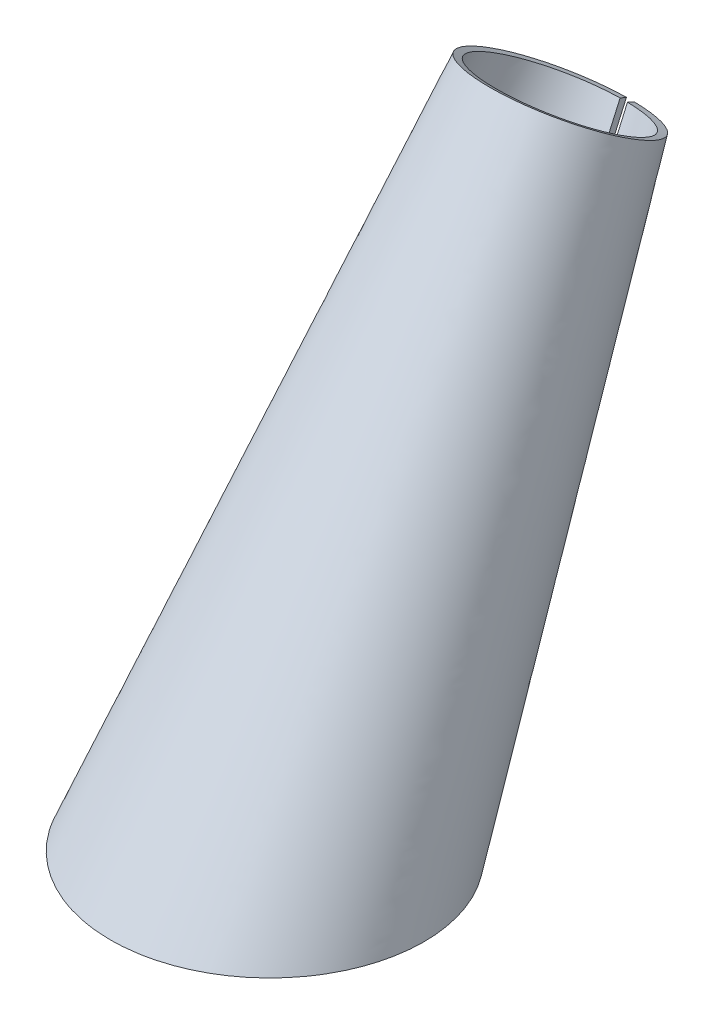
ISO-10303-21;
HEADER;
FILE_DESCRIPTION(('STEP AP214'),'2;1');
FILE_NAME('part.step','',(''),(''),'','','');
FILE_SCHEMA(('AUTOMOTIVE_DESIGN { 1 0 10303 214 1 1 1 1 }'));
ENDSEC;
DATA;
#1=APPLICATION_CONTEXT('core data for automotive mechanical design processes');
#2=APPLICATION_PROTOCOL_DEFINITION('international standard','automotive_design',2000,#1);
#3=PRODUCT_CONTEXT('',#1,'mechanical');
#4=PRODUCT('Part','Part','',(#3));
#5=PRODUCT_RELATED_PRODUCT_CATEGORY('part','',(#4));
#6=PRODUCT_DEFINITION_FORMATION('','',#4);
#7=PRODUCT_DEFINITION_CONTEXT('part definition',#1,'design');
#8=PRODUCT_DEFINITION('design','',#6,#7);
#9=PRODUCT_DEFINITION_SHAPE('','',#8);
#10=(LENGTH_UNIT() NAMED_UNIT(*) SI_UNIT(.MILLI.,.METRE.));
#11=(NAMED_UNIT(*) PLANE_ANGLE_UNIT() SI_UNIT($,.RADIAN.));
#12=(NAMED_UNIT(*) SI_UNIT($,.STERADIAN.) SOLID_ANGLE_UNIT());
#13=UNCERTAINTY_MEASURE_WITH_UNIT(LENGTH_MEASURE(1.E-05),#10,'distance_accuracy_value','');
#14=(GEOMETRIC_REPRESENTATION_CONTEXT(3) GLOBAL_UNCERTAINTY_ASSIGNED_CONTEXT((#13)) GLOBAL_UNIT_ASSIGNED_CONTEXT((#10,
#11,#12)) REPRESENTATION_CONTEXT('',''));
#15=CARTESIAN_POINT('',(0.,0.,0.));
#16=DIRECTION('',(0.,0.,1.));
#17=DIRECTION('',(1.,0.,0.));
#18=AXIS2_PLACEMENT_3D('',#15,#16,#17);
#19=CARTESIAN_POINT('',(-2.74864490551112,319.408328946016,-247.808323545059));
#20=CARTESIAN_POINT('',(-4.3449209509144,319.448633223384,-247.739271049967));
#21=CARTESIAN_POINT('',(-6.14642035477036,319.527470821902,-247.604077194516));
#22=CARTESIAN_POINT('',(-10.2600457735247,319.840698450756,-247.067701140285));
#23=CARTESIAN_POINT('',(-12.5943328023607,320.074607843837,-246.667208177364));
#24=CARTESIAN_POINT('',(-16.6145644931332,320.661313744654,-245.662460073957));
#25=CARTESIAN_POINT('',(-18.0524949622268,320.898734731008,-245.255859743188));
#26=CARTESIAN_POINT('',(-21.1128307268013,321.487256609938,-244.247658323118));
#27=CARTESIAN_POINT('',(-22.7539706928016,321.84185746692,-243.640154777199));
#28=CARTESIAN_POINT('',(-26.2293231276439,322.713903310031,-242.145364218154));
#29=CARTESIAN_POINT('',(-28.0866971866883,323.237027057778,-241.248551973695));
#30=CARTESIAN_POINT('',(-31.9778091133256,324.515919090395,-239.05436630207));
#31=CARTESIAN_POINT('',(-34.035336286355,325.278903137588,-237.744913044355));
#32=CARTESIAN_POINT('',(-38.2681541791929,327.13917027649,-234.549054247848));
#33=CARTESIAN_POINT('',(-40.4557080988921,328.240921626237,-232.655164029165));
#34=CARTESIAN_POINT('',(-44.7694407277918,330.902154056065,-228.074389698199));
#35=CARTESIAN_POINT('',(-46.9045028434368,332.466925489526,-225.378535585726));
#36=CARTESIAN_POINT('',(-49.7705333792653,335.245315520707,-220.583337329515));
#37=CARTESIAN_POINT('',(-50.6691331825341,336.244367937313,-218.857876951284));
#38=CARTESIAN_POINT('',(-52.274860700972,338.392765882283,-215.143935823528));
#39=CARTESIAN_POINT('',(-52.9828449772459,339.543424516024,-213.153190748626));
#40=CARTESIAN_POINT('',(-54.1151309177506,341.993644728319,-208.909781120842));
#41=CARTESIAN_POINT('',(-54.5393671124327,343.293540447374,-206.65653368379));
#42=CARTESIAN_POINT('',(-54.998242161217,346.026003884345,-201.914931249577));
#43=CARTESIAN_POINT('',(-55.0323264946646,347.457392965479,-199.428642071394));
#44=CARTESIAN_POINT('',(-54.6019567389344,350.416411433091,-194.283114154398));
#45=CARTESIAN_POINT('',(-54.1374450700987,351.940907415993,-191.629428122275));
#46=CARTESIAN_POINT('',(-52.616458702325,355.026231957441,-186.252753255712));
#47=CARTESIAN_POINT('',(-51.5619154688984,356.581856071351,-183.539086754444));
#48=CARTESIAN_POINT('',(-48.8076135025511,359.647733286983,-178.185108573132));
#49=CARTESIAN_POINT('',(-47.1133653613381,361.151145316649,-175.55717934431));
#50=CARTESIAN_POINT('',(-43.0907235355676,364.018088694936,-170.540903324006));
#51=CARTESIAN_POINT('',(-40.7723453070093,365.374171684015,-168.166171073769));
#52=CARTESIAN_POINT('',(-35.5898962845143,367.855119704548,-163.818005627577));
#53=CARTESIAN_POINT('',(-32.7398528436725,368.973272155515,-161.856953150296));
#54=CARTESIAN_POINT('',(-26.6526214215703,370.908739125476,-158.460319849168));
#55=CARTESIAN_POINT('',(-23.4314121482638,371.72119307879,-157.033780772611));
#56=CARTESIAN_POINT('',(-16.8020860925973,373.011362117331,-154.767516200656));
#57=CARTESIAN_POINT('',(-13.4090259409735,373.486481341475,-153.932668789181));
#58=CARTESIAN_POINT('',(-6.63858828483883,374.107643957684,-152.840994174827));
#59=CARTESIAN_POINT('',(-3.27385229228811,374.25298103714,-152.585534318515));
#60=CARTESIAN_POINT('',(3.27385229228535,374.25298103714,-152.585534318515));
#61=CARTESIAN_POINT('',(6.63773638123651,374.107718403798,-152.840854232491));
#62=CARTESIAN_POINT('',(13.4098778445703,373.486406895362,-153.932808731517));
#63=CARTESIAN_POINT('',(16.8015486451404,373.011461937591,-154.767329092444));
#64=CARTESIAN_POINT('',(23.4319495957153,371.721093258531,-157.033967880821));
#65=CARTESIAN_POINT('',(26.6525024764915,370.908775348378,-158.460252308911));
#66=CARTESIAN_POINT('',(32.7399717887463,368.973235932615,-161.85702069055));
#67=CARTESIAN_POINT('',(35.5901352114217,367.855009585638,-163.818209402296));
#68=CARTESIAN_POINT('',(40.7721063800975,365.374281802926,-168.165967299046));
#69=CARTESIAN_POINT('',(43.0911323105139,364.017806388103,-170.541420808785));
#70=CARTESIAN_POINT('',(47.1129565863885,361.151427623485,-175.556661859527));
#71=CARTESIAN_POINT('',(48.807989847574,359.647324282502,-178.18585027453));
#72=CARTESIAN_POINT('',(51.5615391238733,356.582265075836,-183.538345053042));
#73=CARTESIAN_POINT('',(52.6166834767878,355.025782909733,-186.253558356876));
#74=CARTESIAN_POINT('',(54.1372202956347,351.941356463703,-191.628623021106));
#75=CARTESIAN_POINT('',(54.6020159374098,350.416004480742,-194.283835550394));
#76=CARTESIAN_POINT('',(55.0322672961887,347.457799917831,-199.427920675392));
#77=CARTESIAN_POINT('',(54.9981882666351,346.025687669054,-201.91548579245));
#78=CARTESIAN_POINT('',(54.539421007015,343.293856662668,-206.655979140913));
#79=CARTESIAN_POINT('',(54.1150319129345,341.993431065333,-208.910152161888));
#80=CARTESIAN_POINT('',(52.982943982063,339.543638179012,-213.152819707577));
#81=CARTESIAN_POINT('',(52.2747683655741,338.392641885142,-215.144149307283));
#82=CARTESIAN_POINT('',(50.6692255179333,336.244491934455,-218.857663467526));
#83=CARTESIAN_POINT('',(49.7704746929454,335.245258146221,-220.583435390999));
#84=CARTESIAN_POINT('',(46.9046202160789,332.4670402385,-225.378339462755));
#85=CARTESIAN_POINT('',(44.7694763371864,330.902176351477,-228.074351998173));
#86=CARTESIAN_POINT('',(40.455672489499,328.240899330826,-232.655201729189));
#87=CARTESIAN_POINT('',(38.2655945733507,327.138025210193,-234.550978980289));
#88=CARTESIAN_POINT('',(34.0378958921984,325.280048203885,-237.742988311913));
#89=CARTESIAN_POINT('',(31.9789492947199,324.516300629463,-239.053726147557));
#90=CARTESIAN_POINT('',(28.0855570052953,323.236645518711,-241.249192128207));
#91=CARTESIAN_POINT('',(26.2303864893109,322.714174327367,-242.144908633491));
#92=CARTESIAN_POINT('',(22.7529073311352,321.841586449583,-243.640610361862));
#93=CARTESIAN_POINT('',(21.1137186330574,321.487429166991,-244.247366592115));
#94=CARTESIAN_POINT('',(18.0516070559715,320.898562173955,-245.25615147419));
#95=CARTESIAN_POINT('',(16.6152679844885,320.661416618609,-245.662284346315));
#96=CARTESIAN_POINT('',(13.9337065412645,320.270073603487,-246.332467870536));
#97=CARTESIAN_POINT('',(12.6779169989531,320.114441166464,-246.598962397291));
#98=CARTESIAN_POINT('',(10.3312487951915,319.861023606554,-247.03289061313));
#99=CARTESIAN_POINT('',(9.22942173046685,319.762228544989,-247.202086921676));
#100=CARTESIAN_POINT('',(6.15085573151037,319.527796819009,-247.60349365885));
#101=CARTESIAN_POINT('',(4.34157300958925,319.448548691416,-247.739415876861));
#102=CARTESIAN_POINT('',(2.74864490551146,319.408328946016,-247.808323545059));
#103=CARTESIAN_POINT('',(-2.49999999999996,321.441431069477,-243.247109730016));
#104=CARTESIAN_POINT('',(-3.9560754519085,321.477878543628,-243.183980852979));
#105=CARTESIAN_POINT('',(-5.58769317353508,321.548707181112,-243.061302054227));
#106=CARTESIAN_POINT('',(-9.334702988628,321.831444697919,-242.57158630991));
#107=CARTESIAN_POINT('',(-11.4507533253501,322.04141133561,-242.207913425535));
#108=CARTESIAN_POINT('',(-15.1141496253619,322.571231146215,-241.290238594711));
#109=CARTESIAN_POINT('',(-16.4171270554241,322.784403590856,-240.921013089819));
#110=CARTESIAN_POINT('',(-19.2064584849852,323.316115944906,-240.000060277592));
#111=CARTESIAN_POINT('',(-20.6931483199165,323.634490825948,-239.448618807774));
#112=CARTESIAN_POINT('',(-23.8614490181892,324.422879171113,-238.083090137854));
#113=CARTESIAN_POINT('',(-25.5437556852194,324.89271138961,-237.269316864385));
#114=CARTESIAN_POINT('',(-29.0917015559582,326.049912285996,-235.264986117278));
#115=CARTESIAN_POINT('',(-30.9586744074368,326.737195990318,-234.074575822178));
#116=CARTESIAN_POINT('',(-34.8119686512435,328.419409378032,-231.160896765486));
#117=CARTESIAN_POINT('',(-36.800547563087,329.414686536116,-229.437026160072));
#118=CARTESIAN_POINT('',(-40.7277413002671,331.82492867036,-225.262364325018));
#119=CARTESIAN_POINT('',(-42.6692544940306,333.24142812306,-222.808915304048));
#120=CARTESIAN_POINT('',(-45.2782435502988,335.762831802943,-218.441716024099));
#121=CARTESIAN_POINT('',(-46.0955851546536,336.669253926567,-216.871746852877));
#122=CARTESIAN_POINT('',(-47.5570488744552,338.621207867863,-213.49086345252));
#123=CARTESIAN_POINT('',(-48.2011098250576,339.666894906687,-211.679680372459));
#124=CARTESIAN_POINT('',(-49.2312674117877,341.89585438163,-207.819009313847));
#125=CARTESIAN_POINT('',(-49.6171322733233,343.079300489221,-205.76922052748));
#126=CARTESIAN_POINT('',(-50.0340198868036,345.568257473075,-201.45822057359));
#127=CARTESIAN_POINT('',(-50.0645808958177,346.873910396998,-199.196763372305));
#128=CARTESIAN_POINT('',(-49.672058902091,349.572797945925,-194.522153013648));
#129=CARTESIAN_POINT('',(-49.2482906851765,350.966061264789,-192.108950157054));
#130=CARTESIAN_POINT('',(-47.8637195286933,353.783820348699,-187.228448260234));
#131=CARTESIAN_POINT('',(-46.9021447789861,355.208143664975,-184.761447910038));
#132=CARTESIAN_POINT('',(-44.3965265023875,358.011643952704,-179.905642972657));
#133=CARTESIAN_POINT('',(-42.8519067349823,359.39041266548,-177.517545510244));
#134=CARTESIAN_POINT('',(-39.1941522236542,362.015064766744,-172.971514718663));
#135=CARTESIAN_POINT('',(-37.0809584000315,363.260385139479,-170.814556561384));
#136=CARTESIAN_POINT('',(-32.3701073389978,365.534058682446,-166.87643846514));
#137=CARTESIAN_POINT('',(-29.7730576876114,366.561890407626,-165.096181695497));
#138=CARTESIAN_POINT('',(-24.2407107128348,368.337265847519,-162.021141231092));
#139=CARTESIAN_POINT('',(-21.3065100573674,369.084540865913,-160.726822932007));
#140=CARTESIAN_POINT('',(-15.2816620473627,370.26885014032,-158.67553909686));
#141=CARTESIAN_POINT('',(-12.1921723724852,370.705959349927,-157.918443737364));
#142=CARTESIAN_POINT('',(-6.03854473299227,371.276444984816,-156.930333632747));
#143=CARTESIAN_POINT('',(-2.97521536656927,371.410161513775,-156.698729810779));
#144=CARTESIAN_POINT('',(2.97521536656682,371.410161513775,-156.698729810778));
#145=CARTESIAN_POINT('',(6.03854473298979,371.276444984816,-156.930333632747));
#146=CARTESIAN_POINT('',(12.1921723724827,370.705959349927,-157.918443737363));
#147=CARTESIAN_POINT('',(15.2816620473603,370.26885014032,-158.67553909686));
#148=CARTESIAN_POINT('',(21.3065100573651,369.084540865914,-160.726822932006));
#149=CARTESIAN_POINT('',(24.2407107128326,368.33726584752,-162.021141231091));
#150=CARTESIAN_POINT('',(29.7730576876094,366.561890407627,-165.096181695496));
#151=CARTESIAN_POINT('',(32.3701073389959,365.534058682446,-166.876438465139));
#152=CARTESIAN_POINT('',(37.0809584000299,363.26038513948,-170.814556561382));
#153=CARTESIAN_POINT('',(39.1941522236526,362.015064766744,-172.971514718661));
#154=CARTESIAN_POINT('',(42.8519067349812,359.390412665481,-177.517545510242));
#155=CARTESIAN_POINT('',(44.3965265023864,358.011643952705,-179.905642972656));
#156=CARTESIAN_POINT('',(46.9021447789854,355.208143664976,-184.761447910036));
#157=CARTESIAN_POINT('',(47.8637195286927,353.7838203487,-187.228448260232));
#158=CARTESIAN_POINT('',(49.248290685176,350.96606126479,-192.108950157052));
#159=CARTESIAN_POINT('',(49.6720589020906,349.572797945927,-194.522153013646));
#160=CARTESIAN_POINT('',(50.0645808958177,346.873910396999,-199.196763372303));
#161=CARTESIAN_POINT('',(50.0340198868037,345.568257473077,-201.458220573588));
#162=CARTESIAN_POINT('',(49.6171322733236,343.079300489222,-205.769220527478));
#163=CARTESIAN_POINT('',(49.2312674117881,341.89585438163,-207.819009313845));
#164=CARTESIAN_POINT('',(48.2011098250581,339.666894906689,-211.679680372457));
#165=CARTESIAN_POINT('',(47.5570488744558,338.621207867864,-213.490863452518));
#166=CARTESIAN_POINT('',(46.0955851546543,336.669253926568,-216.871746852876));
#167=CARTESIAN_POINT('',(45.2782435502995,335.762831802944,-218.441716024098));
#168=CARTESIAN_POINT('',(42.6692544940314,333.24142812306,-222.808915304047));
#169=CARTESIAN_POINT('',(40.7277413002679,331.82492867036,-225.262364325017));
#170=CARTESIAN_POINT('',(36.8005475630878,329.414686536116,-229.437026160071));
#171=CARTESIAN_POINT('',(34.8119686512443,328.419409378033,-231.160896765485));
#172=CARTESIAN_POINT('',(30.9586744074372,326.737195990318,-234.074575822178));
#173=CARTESIAN_POINT('',(29.0917015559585,326.049912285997,-235.264986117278));
#174=CARTESIAN_POINT('',(25.54375568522,324.89271138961,-237.269316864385));
#175=CARTESIAN_POINT('',(23.8614490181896,324.422879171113,-238.083090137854));
#176=CARTESIAN_POINT('',(20.6931483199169,323.634490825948,-239.448618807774));
#177=CARTESIAN_POINT('',(19.2064584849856,323.316115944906,-240.000060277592));
#178=CARTESIAN_POINT('',(16.4171270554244,322.784403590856,-240.921013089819));
#179=CARTESIAN_POINT('',(15.1141496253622,322.571231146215,-241.290238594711));
#180=CARTESIAN_POINT('',(12.6718854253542,322.218017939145,-241.90202181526));
#181=CARTESIAN_POINT('',(11.5324483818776,322.078101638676,-242.14436395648));
#182=CARTESIAN_POINT('',(9.39551072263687,321.849429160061,-242.540436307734));
#183=CARTESIAN_POINT('',(8.39795053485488,321.760760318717,-242.694015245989));
#184=CARTESIAN_POINT('',(5.58769317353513,321.548707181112,-243.061302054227));
#185=CARTESIAN_POINT('',(3.95607545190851,321.477878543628,-243.183980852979));
#186=CARTESIAN_POINT('',(2.49999999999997,321.441431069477,-243.247109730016));
#187=B_SPLINE_SURFACE_WITH_KNOTS('',1,3,((#19,#20,#21,#22,#23,#24,#25,#26,#27,#28,#29,#30,#31,
#32,#33,#34,#35,#36,#37,#38,#39,#40,#41,#42,#43,#44,#45,#46,#47,#48,#49,#50,#51,#52,#53,#54,#55,
#56,#57,#58,#59,#60,#61,#62,#63,#64,#65,#66,#67,#68,#69,#70,#71,#72,#73,#74,#75,#76,#77,#78,#79,
#80,#81,#82,#83,#84,#85,#86,#87,#88,#89,#90,#91,#92,#93,#94,#95,#96,#97,#98,#99,#100,#101,#102),
(#103,#104,#105,#106,#107,#108,#109,#110,#111,#112,#113,#114,#115,#116,#117,#118,#119,#120,#121,
#122,#123,#124,#125,#126,#127,#128,#129,#130,#131,#132,#133,#134,#135,#136,#137,#138,#139,#140,
#141,#142,#143,#144,#145,#146,#147,#148,#149,#150,#151,#152,#153,#154,#155,#156,#157,#158,#159,
#160,#161,#162,#163,#164,#165,#166,#167,#168,#169,#170,#171,#172,#173,#174,#175,#176,#177,#178,
#179,#180,#181,#182,#183,#184,#185,#186)),.UNSPECIFIED.,.F.,.F.,.F.,(2,2),(4,2,2,2,2,2,2,2,2,2,
2,2,2,2,2,2,2,2,2,2,2,2,2,2,2,2,2,2,2,2,2,2,2,2,2,2,2,2,2,2,2,4),(0.,1.),(0.,0.0625,0.125,
0.15625,0.1875,0.21875,0.25,0.28125,0.3125,0.328125,0.34375,0.359375,0.375,0.390625,0.40625,
0.421875,0.4375,0.453125,0.46875,0.484375,0.5,0.515625,0.53125,0.546875,0.5625,0.578125,0.59375,
0.609375,0.625,0.640625,0.65625,0.671875,0.6875,0.71875,0.75,0.78125,0.8125,0.84375,0.875,
0.90625,0.9375,1.),.UNSPECIFIED.);
#188=CARTESIAN_POINT('',(2.49999999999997,321.441431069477,-243.247109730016));
#189=CARTESIAN_POINT('',(2.74864490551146,319.408328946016,-247.808323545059));
#190=B_SPLINE_CURVE_WITH_KNOTS('',1,(#188,#189),.UNSPECIFIED.,.F.,.F.,(2,2),(0.,1.),.UNSPECIFIED.);
#191=CARTESIAN_POINT('',(2.49999999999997,321.441431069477,-243.247109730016));
#192=VERTEX_POINT('',#191);
#193=CARTESIAN_POINT('',(2.74864490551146,319.408328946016,-247.808323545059));
#194=VERTEX_POINT('',#193);
#195=EDGE_CURVE('E14',#192,#194,#190,.T.);
#196=CARTESIAN_POINT('',(2.49999999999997,321.441431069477,-243.247109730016));
#197=CARTESIAN_POINT('',(3.95607545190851,321.477878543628,-243.183980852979));
#198=CARTESIAN_POINT('',(5.58769317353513,321.548707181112,-243.061302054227));
#199=CARTESIAN_POINT('',(8.39795053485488,321.760760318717,-242.694015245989));
#200=CARTESIAN_POINT('',(9.39551072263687,321.849429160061,-242.540436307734));
#201=CARTESIAN_POINT('',(11.5324483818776,322.078101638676,-242.14436395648));
#202=CARTESIAN_POINT('',(12.6718854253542,322.218017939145,-241.90202181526));
#203=CARTESIAN_POINT('',(15.1141496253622,322.571231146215,-241.290238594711));
#204=CARTESIAN_POINT('',(16.4171270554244,322.784403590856,-240.921013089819));
#205=CARTESIAN_POINT('',(19.2064584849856,323.316115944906,-240.000060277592));
#206=CARTESIAN_POINT('',(20.6931483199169,323.634490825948,-239.448618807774));
#207=CARTESIAN_POINT('',(23.8614490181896,324.422879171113,-238.083090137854));
#208=CARTESIAN_POINT('',(25.54375568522,324.89271138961,-237.269316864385));
#209=CARTESIAN_POINT('',(29.0917015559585,326.049912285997,-235.264986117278));
#210=CARTESIAN_POINT('',(30.9586744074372,326.737195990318,-234.074575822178));
#211=CARTESIAN_POINT('',(34.8119686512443,328.419409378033,-231.160896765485));
#212=CARTESIAN_POINT('',(36.8005475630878,329.414686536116,-229.437026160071));
#213=CARTESIAN_POINT('',(40.7277413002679,331.82492867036,-225.262364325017));
#214=CARTESIAN_POINT('',(42.6692544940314,333.24142812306,-222.808915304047));
#215=CARTESIAN_POINT('',(45.2782435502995,335.762831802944,-218.441716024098));
#216=CARTESIAN_POINT('',(46.0955851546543,336.669253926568,-216.871746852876));
#217=CARTESIAN_POINT('',(47.5570488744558,338.621207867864,-213.490863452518));
#218=CARTESIAN_POINT('',(48.2011098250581,339.666894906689,-211.679680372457));
#219=CARTESIAN_POINT('',(49.2312674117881,341.89585438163,-207.819009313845));
#220=CARTESIAN_POINT('',(49.6171322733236,343.079300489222,-205.769220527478));
#221=CARTESIAN_POINT('',(50.0340198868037,345.568257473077,-201.458220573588));
#222=CARTESIAN_POINT('',(50.0645808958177,346.873910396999,-199.196763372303));
#223=CARTESIAN_POINT('',(49.6720589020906,349.572797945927,-194.522153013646));
#224=CARTESIAN_POINT('',(49.248290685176,350.96606126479,-192.108950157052));
#225=CARTESIAN_POINT('',(47.8637195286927,353.7838203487,-187.228448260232));
#226=CARTESIAN_POINT('',(46.9021447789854,355.208143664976,-184.761447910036));
#227=CARTESIAN_POINT('',(44.3965265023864,358.011643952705,-179.905642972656));
#228=CARTESIAN_POINT('',(42.8519067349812,359.390412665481,-177.517545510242));
#229=CARTESIAN_POINT('',(39.1941522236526,362.015064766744,-172.971514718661));
#230=CARTESIAN_POINT('',(37.0809584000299,363.26038513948,-170.814556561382));
#231=CARTESIAN_POINT('',(32.3701073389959,365.534058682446,-166.876438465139));
#232=CARTESIAN_POINT('',(29.7730576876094,366.561890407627,-165.096181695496));
#233=CARTESIAN_POINT('',(24.2407107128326,368.33726584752,-162.021141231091));
#234=CARTESIAN_POINT('',(21.3065100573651,369.084540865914,-160.726822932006));
#235=CARTESIAN_POINT('',(15.2816620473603,370.26885014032,-158.67553909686));
#236=CARTESIAN_POINT('',(12.1921723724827,370.705959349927,-157.918443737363));
#237=CARTESIAN_POINT('',(6.03854473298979,371.276444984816,-156.930333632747));
#238=CARTESIAN_POINT('',(2.97521536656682,371.410161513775,-156.698729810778));
#239=CARTESIAN_POINT('',(-2.97521536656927,371.410161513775,-156.698729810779));
#240=CARTESIAN_POINT('',(-6.03854473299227,371.276444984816,-156.930333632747));
#241=CARTESIAN_POINT('',(-12.1921723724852,370.705959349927,-157.918443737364));
#242=CARTESIAN_POINT('',(-15.2816620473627,370.26885014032,-158.67553909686));
#243=CARTESIAN_POINT('',(-21.3065100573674,369.084540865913,-160.726822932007));
#244=CARTESIAN_POINT('',(-24.2407107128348,368.337265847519,-162.021141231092));
#245=CARTESIAN_POINT('',(-29.7730576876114,366.561890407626,-165.096181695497));
#246=CARTESIAN_POINT('',(-32.3701073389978,365.534058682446,-166.87643846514));
#247=CARTESIAN_POINT('',(-37.0809584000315,363.260385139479,-170.814556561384));
#248=CARTESIAN_POINT('',(-39.1941522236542,362.015064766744,-172.971514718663));
#249=CARTESIAN_POINT('',(-42.8519067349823,359.39041266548,-177.517545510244));
#250=CARTESIAN_POINT('',(-44.3965265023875,358.011643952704,-179.905642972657));
#251=CARTESIAN_POINT('',(-46.9021447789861,355.208143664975,-184.761447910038));
#252=CARTESIAN_POINT('',(-47.8637195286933,353.783820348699,-187.228448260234));
#253=CARTESIAN_POINT('',(-49.2482906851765,350.966061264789,-192.108950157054));
#254=CARTESIAN_POINT('',(-49.672058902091,349.572797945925,-194.522153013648));
#255=CARTESIAN_POINT('',(-50.0645808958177,346.873910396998,-199.196763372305));
#256=CARTESIAN_POINT('',(-50.0340198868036,345.568257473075,-201.45822057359));
#257=CARTESIAN_POINT('',(-49.6171322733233,343.079300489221,-205.76922052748));
#258=CARTESIAN_POINT('',(-49.2312674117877,341.89585438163,-207.819009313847));
#259=CARTESIAN_POINT('',(-48.2011098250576,339.666894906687,-211.679680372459));
#260=CARTESIAN_POINT('',(-47.5570488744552,338.621207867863,-213.49086345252));
#261=CARTESIAN_POINT('',(-46.0955851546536,336.669253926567,-216.871746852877));
#262=CARTESIAN_POINT('',(-45.2782435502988,335.762831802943,-218.441716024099));
#263=CARTESIAN_POINT('',(-42.6692544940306,333.24142812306,-222.808915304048));
#264=CARTESIAN_POINT('',(-40.7277413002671,331.82492867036,-225.262364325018));
#265=CARTESIAN_POINT('',(-36.800547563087,329.414686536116,-229.437026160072));
#266=CARTESIAN_POINT('',(-34.8119686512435,328.419409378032,-231.160896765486));
#267=CARTESIAN_POINT('',(-30.9586744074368,326.737195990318,-234.074575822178));
#268=CARTESIAN_POINT('',(-29.0917015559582,326.049912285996,-235.264986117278));
#269=CARTESIAN_POINT('',(-25.5437556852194,324.89271138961,-237.269316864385));
#270=CARTESIAN_POINT('',(-23.8614490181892,324.422879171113,-238.083090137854));
#271=CARTESIAN_POINT('',(-20.6931483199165,323.634490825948,-239.448618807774));
#272=CARTESIAN_POINT('',(-19.2064584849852,323.316115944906,-240.000060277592));
#273=CARTESIAN_POINT('',(-16.4171270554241,322.784403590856,-240.921013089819));
#274=CARTESIAN_POINT('',(-15.1141496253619,322.571231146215,-241.290238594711));
#275=CARTESIAN_POINT('',(-11.4507533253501,322.04141133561,-242.207913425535));
#276=CARTESIAN_POINT('',(-9.334702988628,321.831444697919,-242.57158630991));
#277=CARTESIAN_POINT('',(-5.58769317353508,321.548707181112,-243.061302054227));
#278=CARTESIAN_POINT('',(-3.9560754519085,321.477878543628,-243.183980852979));
#279=CARTESIAN_POINT('',(-2.49999999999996,321.441431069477,-243.247109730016));
#280=B_SPLINE_CURVE_WITH_KNOTS('',3,(#196,#197,#198,#199,#200,#201,#202,#203,#204,#205,#206,
#207,#208,#209,#210,#211,#212,#213,#214,#215,#216,#217,#218,#219,#220,#221,#222,#223,#224,#225,
#226,#227,#228,#229,#230,#231,#232,#233,#234,#235,#236,#237,#238,#239,#240,#241,#242,#243,#244,
#245,#246,#247,#248,#249,#250,#251,#252,#253,#254,#255,#256,#257,#258,#259,#260,#261,#262,#263,
#264,#265,#266,#267,#268,#269,#270,#271,#272,#273,#274,#275,#276,#277,#278,#279),.UNSPECIFIED.,
.F.,.F.,(4,2,2,2,2,2,2,2,2,2,2,2,2,2,2,2,2,2,2,2,2,2,2,2,2,2,2,2,2,2,2,2,2,2,2,2,2,2,2,2,2,4),
(0.,0.0625,0.09375,0.125,0.15625,0.1875,0.21875,0.25,0.28125,0.3125,0.328125,0.34375,0.359375,
0.375,0.390625,0.40625,0.421875,0.4375,0.453125,0.46875,0.484375,0.5,0.515625,0.53125,0.546875,
0.5625,0.578125,0.59375,0.609375,0.625,0.640625,0.65625,0.671875,0.6875,0.71875,0.75,0.78125,
0.8125,0.84375,0.875,0.9375,1.),.UNSPECIFIED.);
#281=CARTESIAN_POINT('',(-2.49999999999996,321.441431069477,-243.247109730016));
#282=VERTEX_POINT('',#281);
#283=EDGE_CURVE('E120',#192,#282,#280,.T.);
#284=CARTESIAN_POINT('',(-2.49999999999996,321.441431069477,-243.247109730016));
#285=CARTESIAN_POINT('',(-2.74864490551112,319.408328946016,-247.808323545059));
#286=B_SPLINE_CURVE_WITH_KNOTS('',1,(#284,#285),.UNSPECIFIED.,.F.,.F.,(2,2),(0.,1.),.UNSPECIFIED.);
#287=CARTESIAN_POINT('',(-2.74864490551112,319.408328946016,-247.808323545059));
#288=VERTEX_POINT('',#287);
#289=EDGE_CURVE('E69',#282,#288,#286,.T.);
#290=CARTESIAN_POINT('',(2.74864490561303,319.408328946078,-247.808323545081));
#291=CARTESIAN_POINT('',(3.1607739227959,319.418694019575,-247.790563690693));
#292=CARTESIAN_POINT('',(3.57266230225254,319.43134352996,-247.768874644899));
#293=CARTESIAN_POINT('',(4.42448639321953,319.462373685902,-247.7156725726));
#294=CARTESIAN_POINT('',(4.86437352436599,319.481092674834,-247.683579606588));
#295=CARTESIAN_POINT('',(6.27318631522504,319.549935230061,-247.56560848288));
#296=CARTESIAN_POINT('',(7.2401699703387,319.61070262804,-247.461550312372));
#297=CARTESIAN_POINT('',(8.7366315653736,319.724727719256,-247.266290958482));
#298=CARTESIAN_POINT('',(9.26882737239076,319.769240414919,-247.190065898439));
#299=CARTESIAN_POINT('',(10.3696548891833,319.869847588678,-247.017786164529));
#300=CARTESIAN_POINT('',(10.9380682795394,319.926555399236,-246.920681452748));
#301=CARTESIAN_POINT('',(12.1142528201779,320.053569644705,-246.703191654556));
#302=CARTESIAN_POINT('',(12.7217236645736,320.124582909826,-246.58159663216));
#303=CARTESIAN_POINT('',(13.9790387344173,320.283103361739,-246.310148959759));
#304=CARTESIAN_POINT('',(14.6284578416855,320.371468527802,-246.158825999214));
#305=CARTESIAN_POINT('',(15.9728474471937,320.567658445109,-245.822848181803));
#306=CARTESIAN_POINT('',(16.6672465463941,320.676479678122,-245.636486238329));
#307=CARTESIAN_POINT('',(18.1045055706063,320.917763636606,-245.223229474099));
#308=CARTESIAN_POINT('',(18.846561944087,321.051442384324,-244.994248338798));
#309=CARTESIAN_POINT('',(20.3821721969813,321.346742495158,-244.488381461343));
#310=CARTESIAN_POINT('',(21.1746558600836,321.509778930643,-244.209068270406));
#311=CARTESIAN_POINT('',(22.8131070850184,321.869837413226,-243.592111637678));
#312=CARTESIAN_POINT('',(23.6575725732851,322.068591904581,-243.251490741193));
#313=CARTESIAN_POINT('',(25.401997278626,322.506308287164,-242.501222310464));
#314=CARTESIAN_POINT('',(26.2999690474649,322.747284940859,-242.088110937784));
#315=CARTESIAN_POINT('',(27.6564946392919,323.136297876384,-241.421064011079));
#316=CARTESIAN_POINT('',(28.1252087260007,323.275444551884,-241.182439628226));
#317=CARTESIAN_POINT('',(29.0752045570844,323.567125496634,-240.68215803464));
#318=CARTESIAN_POINT('',(29.5560970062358,323.71998059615,-240.419947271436));
#319=CARTESIAN_POINT('',(30.530832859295,324.040335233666,-239.870327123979));
#320=CARTESIAN_POINT('',(31.0242196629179,324.208185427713,-239.582312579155));
#321=CARTESIAN_POINT('',(32.0239626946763,324.560351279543,-238.977950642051));
#322=CARTESIAN_POINT('',(32.529756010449,324.745070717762,-238.660906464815));
#323=CARTESIAN_POINT('',(33.5524155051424,325.132240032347,-237.996284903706));
#324=CARTESIAN_POINT('',(34.0686429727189,325.335115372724,-237.647972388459));
#325=CARTESIAN_POINT('',(35.110425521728,325.759783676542,-236.918707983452));
#326=CARTESIAN_POINT('',(35.6352655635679,325.982017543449,-236.536991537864));
#327=CARTESIAN_POINT('',(36.6940712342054,326.44741665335,-235.73745848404));
#328=CARTESIAN_POINT('',(37.2271791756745,326.691072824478,-235.318791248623));
#329=CARTESIAN_POINT('',(38.2998291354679,327.201058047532,-234.442297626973));
#330=CARTESIAN_POINT('',(38.8383765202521,327.467912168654,-233.983559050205));
#331=CARTESIAN_POINT('',(39.9196218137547,328.026052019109,-233.023855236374));
#332=CARTESIAN_POINT('',(40.4611780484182,328.317892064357,-232.521925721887));
#333=CARTESIAN_POINT('',(41.5451164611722,328.927964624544,-231.472395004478));
#334=CARTESIAN_POINT('',(42.0861724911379,329.2467864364,-230.923766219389));
#335=CARTESIAN_POINT('',(43.1655714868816,329.912696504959,-229.777545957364));
#336=CARTESIAN_POINT('',(43.7023963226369,330.260399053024,-229.178881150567));
#337=CARTESIAN_POINT('',(44.7685046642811,330.986032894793,-227.929115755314));
#338=CARTESIAN_POINT('',(45.2960387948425,331.364604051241,-227.276893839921));
#339=CARTESIAN_POINT('',(46.3384347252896,332.153797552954,-225.916785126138));
#340=CARTESIAN_POINT('',(46.8513069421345,332.565072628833,-225.20775124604));
#341=CARTESIAN_POINT('',(47.8576597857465,333.421403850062,-223.730916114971));
#342=CARTESIAN_POINT('',(48.3488723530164,333.867119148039,-222.961951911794));
#343=CARTESIAN_POINT('',(49.3048406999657,334.793872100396,-221.362481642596));
#344=CARTESIAN_POINT('',(49.7670427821,335.275561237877,-220.530821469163));
#345=CARTESIAN_POINT('',(50.4257260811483,336.016311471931,-219.251361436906));
#346=CARTESIAN_POINT('',(50.642992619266,336.27089032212,-218.811549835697));
#347=CARTESIAN_POINT('',(51.0671423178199,336.789289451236,-217.915772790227));
#348=CARTESIAN_POINT('',(51.2736510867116,337.053184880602,-217.459672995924));
#349=CARTESIAN_POINT('',(51.6751459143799,337.590375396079,-216.531030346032));
#350=CARTESIAN_POINT('',(51.8697318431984,337.86374335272,-216.058356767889));
#351=CARTESIAN_POINT('',(52.2459953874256,338.419917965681,-215.096477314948));
#352=CARTESIAN_POINT('',(52.4272519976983,338.702793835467,-214.607146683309));
#353=CARTESIAN_POINT('',(52.7753934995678,339.277911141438,-213.612058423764));
#354=CARTESIAN_POINT('',(52.9418412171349,339.570216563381,-213.106184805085));
#355=CARTESIAN_POINT('',(53.2589090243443,340.16411007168,-212.078134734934));
#356=CARTESIAN_POINT('',(53.409074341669,340.465756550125,-211.555851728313));
#357=CARTESIAN_POINT('',(53.692143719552,341.078328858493,-210.494969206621));
#358=CARTESIAN_POINT('',(53.8245671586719,341.389307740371,-209.956272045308));
#359=CARTESIAN_POINT('',(54.0705142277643,342.020320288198,-208.862928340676));
#360=CARTESIAN_POINT('',(54.1835424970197,342.340399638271,-208.30819668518));
#361=CARTESIAN_POINT('',(54.3890563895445,342.989334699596,-207.183245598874));
#362=CARTESIAN_POINT('',(54.4810328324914,343.318228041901,-206.612954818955));
#363=CARTESIAN_POINT('',(54.6428036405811,343.984498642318,-205.457374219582));
#364=CARTESIAN_POINT('',(54.7120728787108,344.321905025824,-204.87202763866));
#365=CARTESIAN_POINT('',(54.8267600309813,345.004926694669,-203.686791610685));
#366=CARTESIAN_POINT('',(54.8716312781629,345.350562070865,-203.086860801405));
#367=CARTESIAN_POINT('',(54.9358115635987,346.049455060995,-201.873458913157));
#368=CARTESIAN_POINT('',(54.954572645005,346.402722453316,-201.259964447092));
#369=CARTESIAN_POINT('',(54.9648666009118,347.11632922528,-200.020372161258));
#370=CARTESIAN_POINT('',(54.9558437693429,347.47666781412,-199.394269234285));
#371=CARTESIAN_POINT('',(54.9089022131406,348.203848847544,-198.130431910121));
#372=CARTESIAN_POINT('',(54.8704171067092,348.570679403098,-197.492711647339));
#373=CARTESIAN_POINT('',(54.7628373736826,349.310196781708,-196.206747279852));
#374=CARTESIAN_POINT('',(54.6931660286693,349.682859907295,-195.558537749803));
#375=CARTESIAN_POINT('',(54.5217484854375,350.433027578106,-194.253359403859));
#376=CARTESIAN_POINT('',(54.4194452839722,350.81049787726,-193.596444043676));
#377=CARTESIAN_POINT('',(54.1813358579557,351.569424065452,-192.275329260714));
#378=CARTESIAN_POINT('',(54.0449747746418,351.950834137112,-191.611203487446));
#379=CARTESIAN_POINT('',(53.7373116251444,352.716761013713,-190.277186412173));
#380=CARTESIAN_POINT('',(53.5654531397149,353.10121980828,-189.607390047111));
#381=CARTESIAN_POINT('',(53.1853716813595,353.872164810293,-188.263908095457));
#382=CARTESIAN_POINT('',(52.976600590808,354.258581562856,-187.590337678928));
#383=CARTESIAN_POINT('',(52.5219058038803,355.032019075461,-186.241808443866));
#384=CARTESIAN_POINT('',(52.2754788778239,355.418964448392,-185.566976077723));
#385=CARTESIAN_POINT('',(51.7446179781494,356.192329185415,-184.217876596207));
#386=CARTESIAN_POINT('',(51.4596946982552,356.578663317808,-183.543753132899));
#387=CARTESIAN_POINT('',(50.8509643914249,357.349654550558,-182.198082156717));
#388=CARTESIAN_POINT('',(50.5266777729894,357.734216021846,-181.526696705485));
#389=CARTESIAN_POINT('',(49.8385301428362,358.500183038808,-180.18909950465));
#390=CARTESIAN_POINT('',(49.4742207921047,358.881487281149,-179.523060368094));
#391=CARTESIAN_POINT('',(48.7063474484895,359.639259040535,-178.199132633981));
#392=CARTESIAN_POINT('',(48.3024014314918,360.015629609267,-177.541410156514));
#393=CARTESIAN_POINT('',(47.4552910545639,360.762263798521,-176.236321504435));
#394=CARTESIAN_POINT('',(47.011768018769,361.132425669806,-175.589129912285));
#395=CARTESIAN_POINT('',(46.0855039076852,361.865347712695,-174.307376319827));
#396=CARTESIAN_POINT('',(45.6024233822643,362.228000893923,-173.67299835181));
#397=CARTESIAN_POINT('',(44.5975090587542,362.944195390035,-172.419901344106));
#398=CARTESIAN_POINT('',(44.0753866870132,363.29763599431,-171.801356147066));
#399=CARTESIAN_POINT('',(42.9940569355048,363.993748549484,-170.582882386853));
#400=CARTESIAN_POINT('',(42.4346351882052,364.336337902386,-169.983096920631));
#401=CARTESIAN_POINT('',(41.2797945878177,365.009556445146,-168.804217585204));
#402=CARTESIAN_POINT('',(40.6841869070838,365.340105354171,-168.225262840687));
#403=CARTESIAN_POINT('',(39.4580136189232,365.988023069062,-167.090195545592));
#404=CARTESIAN_POINT('',(38.8272813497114,366.305313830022,-166.534218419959));
#405=CARTESIAN_POINT('',(37.5326840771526,366.925067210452,-165.448048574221));
#406=CARTESIAN_POINT('',(36.8687101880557,367.227473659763,-164.917953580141));
#407=CARTESIAN_POINT('',(35.5105268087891,367.816158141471,-163.885888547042));
#408=CARTESIAN_POINT('',(34.8162714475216,368.102410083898,-163.383964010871));
#409=CARTESIAN_POINT('',(33.3995557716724,368.657917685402,-162.409753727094));
#410=CARTESIAN_POINT('',(32.6770677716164,368.927155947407,-161.93749831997));
#411=CARTESIAN_POINT('',(31.2058603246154,369.447736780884,-161.024218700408));
#412=CARTESIAN_POINT('',(30.4571291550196,369.699071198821,-160.583208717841));
#413=CARTESIAN_POINT('',(28.9364484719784,370.182589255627,-159.734679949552));
#414=CARTESIAN_POINT('',(28.16453420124,370.414800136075,-159.327113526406));
#415=CARTESIAN_POINT('',(26.6011121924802,370.859384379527,-158.546726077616));
#416=CARTESIAN_POINT('',(25.8096762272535,371.071819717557,-158.173796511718));
#417=CARTESIAN_POINT('',(24.2098053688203,371.476486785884,-157.463320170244));
#418=CARTESIAN_POINT('',(23.4014461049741,371.668791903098,-157.125644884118));
#419=CARTESIAN_POINT('',(21.7702634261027,372.032800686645,-156.486389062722));
#420=CARTESIAN_POINT('',(20.9475183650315,372.204590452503,-156.184657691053));
#421=CARTESIAN_POINT('',(19.2912229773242,372.526944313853,-155.618431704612));
#422=CARTESIAN_POINT('',(18.4577736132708,372.677635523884,-155.353714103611));
#423=CARTESIAN_POINT('',(16.7837193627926,372.957796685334,-154.861535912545));
#424=CARTESIAN_POINT('',(15.9432217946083,373.087423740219,-154.633799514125));
#425=CARTESIAN_POINT('',(14.2577161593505,373.325634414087,-154.215267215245));
#426=CARTESIAN_POINT('',(13.4128041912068,373.434384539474,-154.024179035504));
#427=CARTESIAN_POINT('',(11.7210571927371,373.630991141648,-153.678690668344));
#428=CARTESIAN_POINT('',(10.8743066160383,373.719025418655,-153.523978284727));
#429=CARTESIAN_POINT('',(9.18247893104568,373.874258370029,-153.251163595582));
#430=CARTESIAN_POINT('',(8.33748223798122,373.941671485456,-153.132684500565));
#431=CARTESIAN_POINT('',(6.6522098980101,374.0562434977,-152.931323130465));
#432=CARTESIAN_POINT('',(5.8119989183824,374.103635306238,-152.848031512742));
#433=CARTESIAN_POINT('',(4.13853826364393,374.178787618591,-152.715945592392));
#434=CARTESIAN_POINT('',(3.30533207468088,374.206785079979,-152.666734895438));
#435=CARTESIAN_POINT('',(1.64806913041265,374.243760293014,-152.601742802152));
#436=CARTESIAN_POINT('',(0.824034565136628,374.25298103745,-152.585534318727));
#437=CARTESIAN_POINT('',(-0.824034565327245,374.252981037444,-152.585534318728));
#438=CARTESIAN_POINT('',(-1.64806913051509,374.243760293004,-152.60174280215));
#439=CARTESIAN_POINT('',(-3.30533207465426,374.206785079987,-152.666734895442));
#440=CARTESIAN_POINT('',(-4.13853826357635,374.178787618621,-152.715945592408));
#441=CARTESIAN_POINT('',(-5.81199891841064,374.103635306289,-152.848031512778));
#442=CARTESIAN_POINT('',(-6.6522098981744,374.056243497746,-152.931323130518));
#443=CARTESIAN_POINT('',(-8.33748223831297,373.941671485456,-153.132684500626));
#444=CARTESIAN_POINT('',(-9.18247893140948,373.87425836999,-153.251163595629));
#445=CARTESIAN_POINT('',(-10.8743066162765,373.719025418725,-153.523978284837));
#446=CARTESIAN_POINT('',(-11.7210571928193,373.630991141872,-153.678690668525));
#447=CARTESIAN_POINT('',(-13.4128041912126,373.434384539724,-154.024179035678));
#448=CARTESIAN_POINT('',(-14.2577161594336,373.3256344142,-154.215267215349));
#449=CARTESIAN_POINT('',(-15.9432217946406,373.08742374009,-154.633799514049));
#450=CARTESIAN_POINT('',(-16.7837193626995,372.957796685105,-154.86153591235));
#451=CARTESIAN_POINT('',(-18.457773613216,372.677635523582,-155.353714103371));
#452=CARTESIAN_POINT('',(-19.2912229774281,372.526944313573,-155.618431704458));
#453=CARTESIAN_POINT('',(-20.9475183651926,372.204590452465,-156.184657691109));
#454=CARTESIAN_POINT('',(-21.770263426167,372.032800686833,-156.486389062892));
#455=CARTESIAN_POINT('',(-23.4014461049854,371.668791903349,-157.125644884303));
#456=CARTESIAN_POINT('',(-24.2098053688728,371.476486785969,-157.463320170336));
#457=CARTESIAN_POINT('',(-25.8096762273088,371.071819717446,-158.173796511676));
#458=CARTESIAN_POINT('',(-26.601112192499,370.85938437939,-158.546726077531));
#459=CARTESIAN_POINT('',(-28.1645342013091,370.414800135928,-159.327113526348));
#460=CARTESIAN_POINT('',(-28.9364484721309,370.182589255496,-159.734679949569));
#461=CARTESIAN_POINT('',(-30.4571291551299,369.699071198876,-160.583208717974));
#462=CARTESIAN_POINT('',(-31.2058603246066,369.447736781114,-161.024218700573));
#463=CARTESIAN_POINT('',(-32.6770677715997,368.927155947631,-161.937498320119));
#464=CARTESIAN_POINT('',(-33.3995557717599,368.65791768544,-162.409753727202));
#465=CARTESIAN_POINT('',(-34.8162714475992,368.102410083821,-163.383964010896));
#466=CARTESIAN_POINT('',(-35.5105268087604,367.81615814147,-163.885888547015));
#467=CARTESIAN_POINT('',(-36.8687101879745,367.227473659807,-164.917953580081));
#468=CARTESIAN_POINT('',(-37.5326840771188,366.925067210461,-165.448048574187));
#469=CARTESIAN_POINT('',(-38.8272813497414,366.305313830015,-166.53421841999));
#470=CARTESIAN_POINT('',(-39.4580136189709,365.988023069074,-167.090195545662));
#471=CARTESIAN_POINT('',(-40.6841869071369,365.340105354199,-168.225262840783));
#472=CARTESIAN_POINT('',(-41.27979458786,365.009556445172,-168.804217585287));
#473=CARTESIAN_POINT('',(-42.434635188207,364.336337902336,-169.983096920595));
#474=CARTESIAN_POINT('',(-42.9940569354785,363.99374854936,-170.582882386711));
#475=CARTESIAN_POINT('',(-44.075386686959,363.297635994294,-171.801356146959));
#476=CARTESIAN_POINT('',(-44.5975090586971,362.944195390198,-172.419901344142));
#477=CARTESIAN_POINT('',(-45.6024233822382,362.228000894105,-173.672998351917));
#478=CARTESIAN_POINT('',(-46.0855039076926,361.865347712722,-174.307376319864));
#479=CARTESIAN_POINT('',(-47.0117680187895,361.132425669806,-175.58912991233));
#480=CARTESIAN_POINT('',(-47.4552910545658,360.762263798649,-176.236321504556));
#481=CARTESIAN_POINT('',(-48.3024014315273,360.015629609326,-177.541410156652));
#482=CARTESIAN_POINT('',(-48.7063474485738,359.6392590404,-178.199132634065));
#483=CARTESIAN_POINT('',(-49.4742207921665,358.881487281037,-179.523060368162));
#484=CARTESIAN_POINT('',(-49.838530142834,358.500183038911,-180.189099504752));
#485=CARTESIAN_POINT('',(-50.5266777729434,357.734216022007,-181.526696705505));
#486=CARTESIAN_POINT('',(-50.8509643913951,357.349654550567,-182.198082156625));
#487=CARTESIAN_POINT('',(-51.4596946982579,356.578663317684,-183.543753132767));
#488=CARTESIAN_POINT('',(-51.7446179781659,356.192329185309,-184.217876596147));
#489=CARTESIAN_POINT('',(-52.2754788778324,355.418964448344,-185.566976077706));
#490=CARTESIAN_POINT('',(-52.5219058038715,355.032019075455,-186.241808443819));
#491=CARTESIAN_POINT('',(-52.9766005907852,354.258581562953,-187.590337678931));
#492=CARTESIAN_POINT('',(-53.1853716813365,353.872164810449,-188.26390809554));
#493=CARTESIAN_POINT('',(-53.5654531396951,353.10121980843,-189.607390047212));
#494=CARTESIAN_POINT('',(-53.73731162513,352.716761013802,-190.277186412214));
#495=CARTESIAN_POINT('',(-54.0449747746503,351.950834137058,-191.611203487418));
#496=CARTESIAN_POINT('',(-54.1813358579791,351.569424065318,-192.275329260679));
#497=CARTESIAN_POINT('',(-54.4194452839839,350.810497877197,-193.596444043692));
#498=CARTESIAN_POINT('',(-54.5217484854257,350.433027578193,-194.25335940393));
#499=CARTESIAN_POINT('',(-54.6931660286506,349.682859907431,-195.558537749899));
#500=CARTESIAN_POINT('',(-54.7628373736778,349.310196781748,-196.20674727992));
#501=CARTESIAN_POINT('',(-54.8704171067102,348.570679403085,-197.492711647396));
#502=CARTESIAN_POINT('',(-54.9089022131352,348.203848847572,-198.130431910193));
#503=CARTESIAN_POINT('',(-54.9558437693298,347.476667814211,-199.394269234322));
#504=CARTESIAN_POINT('',(-54.9648666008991,347.116329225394,-200.020372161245));
#505=CARTESIAN_POINT('',(-54.9545726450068,346.402722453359,-201.259964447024));
#506=CARTESIAN_POINT('',(-54.9358115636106,346.049455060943,-201.873458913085));
#507=CARTESIAN_POINT('',(-54.8716312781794,345.350562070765,-203.086860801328));
#508=CARTESIAN_POINT('',(-54.8267600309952,345.004926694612,-203.686791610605));
#509=CARTESIAN_POINT('',(-54.7120728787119,344.321905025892,-204.872027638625));
#510=CARTESIAN_POINT('',(-54.6428036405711,343.984498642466,-205.457374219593));
#511=CARTESIAN_POINT('',(-54.4810328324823,343.318228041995,-206.612954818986));
#512=CARTESIAN_POINT('',(-54.3890563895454,342.98933469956,-207.183245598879));
#513=CARTESIAN_POINT('',(-54.1835424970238,342.340399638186,-208.308196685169));
#514=CARTESIAN_POINT('',(-54.0705142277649,342.020320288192,-208.862928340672));
#515=CARTESIAN_POINT('',(-53.8245671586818,341.389307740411,-209.956272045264));
#516=CARTESIAN_POINT('',(-53.6921437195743,341.078328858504,-210.494969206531));
#517=CARTESIAN_POINT('',(-53.409074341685,340.465756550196,-211.555851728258));
#518=CARTESIAN_POINT('',(-53.2589090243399,340.164110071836,-212.078134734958));
#519=CARTESIAN_POINT('',(-52.9418412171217,339.570216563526,-213.10618480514));
#520=CARTESIAN_POINT('',(-52.7753934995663,339.27791114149,-213.612058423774));
#521=CARTESIAN_POINT('',(-52.4272519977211,338.702793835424,-214.607146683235));
#522=CARTESIAN_POINT('',(-52.2459953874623,338.419917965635,-215.096477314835));
#523=CARTESIAN_POINT('',(-51.8697318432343,337.863743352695,-216.058356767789));
#524=CARTESIAN_POINT('',(-51.675145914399,337.590375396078,-216.531030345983));
#525=CARTESIAN_POINT('',(-51.2736510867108,337.053184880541,-217.459672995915));
#526=CARTESIAN_POINT('',(-51.0671423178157,336.789289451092,-217.915772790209));
#527=CARTESIAN_POINT('',(-50.642992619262,336.270890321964,-218.811549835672));
#528=CARTESIAN_POINT('',(-50.4257260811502,336.016311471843,-219.251361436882));
#529=CARTESIAN_POINT('',(-49.7670427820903,335.275561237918,-220.530821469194));
#530=CARTESIAN_POINT('',(-49.3048406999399,334.793872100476,-221.362481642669));
#531=CARTESIAN_POINT('',(-48.3488723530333,333.867119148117,-222.96195191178));
#532=CARTESIAN_POINT('',(-47.8576597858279,333.421403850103,-223.730916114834));
#533=CARTESIAN_POINT('',(-46.851306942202,332.565072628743,-225.207751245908));
#534=CARTESIAN_POINT('',(-46.3384347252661,332.153797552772,-225.916785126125));
#535=CARTESIAN_POINT('',(-45.2960387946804,331.364604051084,-227.276893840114));
#536=CARTESIAN_POINT('',(-44.7685046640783,330.986032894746,-227.929115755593));
#537=CARTESIAN_POINT('',(-43.7023963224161,330.260399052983,-229.178881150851));
#538=CARTESIAN_POINT('',(-43.1655714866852,329.912696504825,-229.777545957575));
#539=CARTESIAN_POINT('',(-42.0861724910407,329.24678643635,-230.923766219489));
#540=CARTESIAN_POINT('',(-41.5451164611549,328.927964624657,-231.472395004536));
#541=CARTESIAN_POINT('',(-40.4611780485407,328.317892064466,-232.521925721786));
#542=CARTESIAN_POINT('',(-39.9196218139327,328.026052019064,-233.023855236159));
#543=CARTESIAN_POINT('',(-38.8383765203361,327.467912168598,-233.9835590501));
#544=CARTESIAN_POINT('',(-38.2998291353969,327.201058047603,-234.442297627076));
#545=CARTESIAN_POINT('',(-37.2271791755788,326.691072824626,-235.318791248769));
#546=CARTESIAN_POINT('',(-36.694071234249,326.447416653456,-235.737458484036));
#547=CARTESIAN_POINT('',(-35.6352655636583,325.982017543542,-236.536991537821));
#548=CARTESIAN_POINT('',(-35.1104255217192,325.75978367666,-236.918707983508));
#549=CARTESIAN_POINT('',(-34.0686429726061,325.335115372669,-237.647972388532));
#550=CARTESIAN_POINT('',(-33.5524155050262,325.132240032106,-237.996284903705));
#551=CARTESIAN_POINT('',(-32.5297560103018,324.74507071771,-238.660906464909));
#552=CARTESIAN_POINT('',(-32.0239626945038,324.560351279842,-238.977950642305));
#553=CARTESIAN_POINT('',(-31.0242196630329,324.208185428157,-239.582312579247));
#554=CARTESIAN_POINT('',(-30.5308328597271,324.04033523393,-239.870327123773));
#555=CARTESIAN_POINT('',(-29.5560970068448,323.719980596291,-240.41994727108));
#556=CARTESIAN_POINT('',(-29.0752045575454,323.567125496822,-240.682158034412));
#557=CARTESIAN_POINT('',(-28.1252087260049,323.27544455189,-241.182439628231));
#558=CARTESIAN_POINT('',(-27.6564946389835,323.136297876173,-241.421064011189));
#559=CARTESIAN_POINT('',(-26.2999690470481,322.747284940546,-242.088110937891));
#560=CARTESIAN_POINT('',(-25.4019972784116,322.506308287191,-242.501222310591));
#561=CARTESIAN_POINT('',(-23.6575725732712,322.068591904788,-243.251490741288));
#562=CARTESIAN_POINT('',(-22.8131070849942,321.869837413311,-243.592111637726));
#563=CARTESIAN_POINT('',(-21.174655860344,321.509778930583,-244.209068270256));
#564=CARTESIAN_POINT('',(-20.3821721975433,321.346742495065,-244.488381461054));
#565=CARTESIAN_POINT('',(-18.8465619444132,321.051442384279,-244.994248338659));
#566=CARTESIAN_POINT('',(-18.1045055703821,320.917763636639,-245.223229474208));
#567=CARTESIAN_POINT('',(-16.6672465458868,320.676479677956,-245.636486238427));
#568=CARTESIAN_POINT('',(-15.9728474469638,320.567658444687,-245.82284818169));
#569=CARTESIAN_POINT('',(-14.6284578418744,320.371468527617,-246.158825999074));
#570=CARTESIAN_POINT('',(-13.9790387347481,320.283103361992,-246.310148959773));
#571=CARTESIAN_POINT('',(-12.7217236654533,320.124582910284,-246.581596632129));
#572=CARTESIAN_POINT('',(-12.1142528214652,320.053569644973,-246.703191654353));
#573=CARTESIAN_POINT('',(-10.9380682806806,319.926555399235,-246.920681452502));
#574=CARTESIAN_POINT('',(-10.3696548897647,319.869847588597,-247.017786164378));
#575=CARTESIAN_POINT('',(-9.26882737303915,319.769240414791,-247.190065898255));
#576=CARTESIAN_POINT('',(-8.73663156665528,319.724727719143,-247.266290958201));
#577=CARTESIAN_POINT('',(-7.24016997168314,319.610702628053,-247.461550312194));
#578=CARTESIAN_POINT('',(-6.27318631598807,319.549935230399,-247.565608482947));
#579=CARTESIAN_POINT('',(-4.86437352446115,319.48109267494,-247.683579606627));
#580=CARTESIAN_POINT('',(-4.42448639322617,319.462373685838,-247.715672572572));
#581=CARTESIAN_POINT('',(-3.57266230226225,319.431343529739,-247.768874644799));
#582=CARTESIAN_POINT('',(-3.1607739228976,319.418694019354,-247.790563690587));
#583=CARTESIAN_POINT('',(-2.7486449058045,319.408328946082,-247.808323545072));
#584=B_SPLINE_CURVE_WITH_KNOTS('',3,(#290,#291,#292,#293,#294,#295,#296,#297,#298,#299,#300,
#301,#302,#303,#304,#305,#306,#307,#308,#309,#310,#311,#312,#313,#314,#315,#316,#317,#318,#319,
#320,#321,#322,#323,#324,#325,#326,#327,#328,#329,#330,#331,#332,#333,#334,#335,#336,#337,#338,
#339,#340,#341,#342,#343,#344,#345,#346,#347,#348,#349,#350,#351,#352,#353,#354,#355,#356,#357,
#358,#359,#360,#361,#362,#363,#364,#365,#366,#367,#368,#369,#370,#371,#372,#373,#374,#375,#376,
#377,#378,#379,#380,#381,#382,#383,#384,#385,#386,#387,#388,#389,#390,#391,#392,#393,#394,#395,
#396,#397,#398,#399,#400,#401,#402,#403,#404,#405,#406,#407,#408,#409,#410,#411,#412,#413,#414,
#415,#416,#417,#418,#419,#420,#421,#422,#423,#424,#425,#426,#427,#428,#429,#430,#431,#432,#433,
#434,#435,#436,#437,#438,#439,#440,#441,#442,#443,#444,#445,#446,#447,#448,#449,#450,#451,#452,
#453,#454,#455,#456,#457,#458,#459,#460,#461,#462,#463,#464,#465,#466,#467,#468,#469,#470,#471,
#472,#473,#474,#475,#476,#477,#478,#479,#480,#481,#482,#483,#484,#485,#486,#487,#488,#489,#490,
#491,#492,#493,#494,#495,#496,#497,#498,#499,#500,#501,#502,#503,#504,#505,#506,#507,#508,#509,
#510,#511,#512,#513,#514,#515,#516,#517,#518,#519,#520,#521,#522,#523,#524,#525,#526,#527,#528,
#529,#530,#531,#532,#533,#534,#535,#536,#537,#538,#539,#540,#541,#542,#543,#544,#545,#546,#547,
#548,#549,#550,#551,#552,#553,#554,#555,#556,#557,#558,#559,#560,#561,#562,#563,#564,#565,#566,
#567,#568,#569,#570,#571,#572,#573,#574,#575,#576,#577,#578,#579,#580,#581,#582,#583),
.UNSPECIFIED.,.F.,.F.,(4,2,2,2,2,2,2,2,2,2,2,2,2,2,2,2,2,2,2,2,2,2,2,2,2,2,2,2,2,2,2,2,2,2,2,2,
2,2,2,2,2,2,2,2,2,2,2,2,2,2,2,2,2,2,2,2,2,2,2,2,2,2,2,2,2,2,2,2,2,2,2,2,2,2,2,2,2,2,2,2,2,2,2,2,
2,2,2,2,2,2,2,2,2,2,2,2,2,2,2,2,2,2,2,2,2,2,2,2,2,2,2,2,2,2,2,2,2,2,2,2,2,2,2,2,2,2,2,2,2,2,2,2,
2,2,2,2,2,2,2,2,2,2,2,2,2,2,4),(0.,1.23786964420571,2.56212356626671,5.48386271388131,
7.10208591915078,8.84006803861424,10.710444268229,12.7279283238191,14.9088361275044,
17.2721242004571,19.8389883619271,22.6338595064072,25.684321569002,27.3162791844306,
29.0219876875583,30.8080231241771,32.6822667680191,34.6467167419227,36.7041490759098,
38.8645415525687,41.1321932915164,43.5133567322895,46.0141820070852,48.641355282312,
51.4011795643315,54.3005542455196,57.345565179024,60.5429405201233,62.2007563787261,
63.8983633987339,65.6370793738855,67.4174560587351,69.239620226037,71.1039024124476,
73.0113847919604,74.9620213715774,76.9557657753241,78.9928098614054,81.0737903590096,
83.1978162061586,85.3645986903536,87.5741149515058,89.8262968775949,92.1191879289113,
94.4521958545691,96.825005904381,99.2365728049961,101.683760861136,104.16564341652,
106.681556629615,109.229265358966,111.80453537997,114.406129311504,117.033023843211,
119.681738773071,122.347267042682,125.02815277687,127.723071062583,130.427482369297,
133.136143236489,135.847530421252,138.560144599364,141.268825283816,143.968709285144,
146.658380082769,149.336333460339,151.997386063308,154.637577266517,157.255746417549,
159.850550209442,162.417373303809,164.953453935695,167.457974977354,169.929873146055,
172.401771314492,174.906292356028,177.442372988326,180.00919608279,182.603999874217,
185.22216902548,187.862360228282,190.523412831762,193.20136620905,195.891037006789,
198.590921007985,201.299601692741,204.012215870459,206.723603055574,209.432263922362,
212.136675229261,214.831593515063,217.512479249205,220.178007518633,222.826722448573,
225.453616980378,228.05521091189,230.630480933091,233.178189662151,235.694102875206,
238.175985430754,240.623173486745,243.034740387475,245.407550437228,247.740558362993,
250.033449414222,252.285631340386,254.495147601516,256.661930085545,258.785955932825,
260.866936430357,262.903980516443,264.897724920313,266.848361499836,268.755843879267,
270.620126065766,272.442290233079,274.222666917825,275.961382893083,277.658989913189,
279.316805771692,282.514181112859,285.559192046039,288.458566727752,291.21839100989,
293.845564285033,296.346389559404,298.727553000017,300.99520473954,303.155597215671,
305.213029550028,307.177479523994,309.051723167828,310.83775860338,312.543467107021,
314.175424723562,317.225886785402,320.02075792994,322.587622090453,324.950910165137,
327.13181796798,329.149302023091,331.019678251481,332.757660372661,334.375883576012,
337.297622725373,338.621876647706,339.859746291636),.UNSPECIFIED.);
#585=EDGE_CURVE('E297',#194,#288,#584,.T.);
#586=ORIENTED_EDGE('',*,*,#195,.F.);
#587=ORIENTED_EDGE('',*,*,#283,.T.);
#588=ORIENTED_EDGE('',*,*,#289,.T.);
#589=ORIENTED_EDGE('',*,*,#585,.F.);
#590=EDGE_LOOP('',(#586,#587,#588,#589));
#591=FACE_BOUND('',#590,.T.);
#592=ADVANCED_FACE('F55',(#591),#187,.F.);
#593=CARTESIAN_POINT('',(-2.74864490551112,319.408328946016,-247.808323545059));
#594=CARTESIAN_POINT('',(-2.70491092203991,265.833871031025,-223.930585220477));
#595=CARTESIAN_POINT('',(-2.67981273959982,212.259967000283,-200.051601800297));
#596=CARTESIAN_POINT('',(-2.63964797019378,105.112300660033,-152.293319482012));
#597=CARTESIAN_POINT('',(-2.62565786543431,51.5385887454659,-128.413906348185));
#598=CARTESIAN_POINT('',(-2.61417751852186,-2.03508988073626,-104.534418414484));
#599=CARTESIAN_POINT('',(-2.49999999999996,321.441431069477,-243.247109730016));
#600=CARTESIAN_POINT('',(-2.49999999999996,267.867859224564,-219.36738229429));
#601=CARTESIAN_POINT('',(-2.49999999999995,214.294287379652,-195.487654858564));
#602=CARTESIAN_POINT('',(-2.49999999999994,107.147143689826,-147.728199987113));
#603=CARTESIAN_POINT('',(-2.49999999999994,53.5735718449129,-123.848472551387));
#604=CARTESIAN_POINT('',(-2.49999999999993,0.,-99.968745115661));
#605=B_SPLINE_SURFACE_WITH_KNOTS('',1,3,((#593,#594,#595,#596,#597,#598),(#599,#600,#601,#602,
#603,#604)),.UNSPECIFIED.,.F.,.F.,.F.,(2,2),(4,2,4),(0.,1.),(-0.175963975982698,0.,
0.175963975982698),.UNSPECIFIED.);
#606=CARTESIAN_POINT('',(-2.49999999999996,321.441431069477,-243.247109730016));
#607=CARTESIAN_POINT('',(-2.49999999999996,267.867859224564,-219.36738229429));
#608=CARTESIAN_POINT('',(-2.49999999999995,214.294287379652,-195.487654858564));
#609=CARTESIAN_POINT('',(-2.49999999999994,107.147143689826,-147.728199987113));
#610=CARTESIAN_POINT('',(-2.49999999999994,53.5735718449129,-123.848472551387));
#611=CARTESIAN_POINT('',(-2.49999999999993,0.,-99.968745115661));
#612=B_SPLINE_CURVE_WITH_KNOTS('',3,(#606,#607,#608,#609,#610,#611),.UNSPECIFIED.,.F.,.F.,(4,2,
4),(-0.175963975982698,0.,0.175963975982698),.UNSPECIFIED.);
#613=CARTESIAN_POINT('',(-2.49999999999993,0.,-99.968745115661));
#614=VERTEX_POINT('',#613);
#615=EDGE_CURVE('E295',#282,#614,#612,.T.);
#616=CARTESIAN_POINT('',(-2.49999999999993,0.,-99.968745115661));
#617=CARTESIAN_POINT('',(-2.61417751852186,-2.03508988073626,-104.534418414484));
#618=B_SPLINE_CURVE_WITH_KNOTS('',1,(#616,#617),.UNSPECIFIED.,.F.,.F.,(2,2),(0.,1.),.UNSPECIFIED.);
#619=CARTESIAN_POINT('',(-2.61417751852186,-2.03508988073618,-104.534418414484));
#620=VERTEX_POINT('',#619);
#621=EDGE_CURVE('E109',#614,#620,#618,.T.);
#622=CARTESIAN_POINT('',(-2.7486449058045,319.408328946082,-247.808323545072));
#623=CARTESIAN_POINT('',(-2.73775774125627,306.014717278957,-241.838884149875));
#624=CARTESIAN_POINT('',(-2.72807400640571,292.621141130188,-235.869363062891));
#625=CARTESIAN_POINT('',(-2.71058381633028,265.834041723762,-223.930202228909));
#626=CARTESIAN_POINT('',(-2.7027773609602,252.4405184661,-217.960562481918));
#627=CARTESIAN_POINT('',(-2.68851214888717,225.653505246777,-206.021208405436));
#628=CARTESIAN_POINT('',(-2.68205339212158,212.260015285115,-200.051494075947));
#629=CARTESIAN_POINT('',(-2.67017261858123,185.473058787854,-188.112012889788));
#630=CARTESIAN_POINT('',(-2.66475060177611,172.079592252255,-182.142246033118));
#631=CARTESIAN_POINT('',(-2.65471010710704,145.292675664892,-170.202675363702));
#632=CARTESIAN_POINT('',(-2.65009162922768,131.899225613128,-164.232871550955));
#633=CARTESIAN_POINT('',(-2.64149326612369,105.112337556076,-152.29323691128));
#634=CARTESIAN_POINT('',(-2.63751338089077,91.7188995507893,-146.323406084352));
#635=CARTESIAN_POINT('',(-2.6300672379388,64.9320324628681,-134.383724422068));
#636=CARTESIAN_POINT('',(-2.6266009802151,51.5386033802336,-128.413873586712));
#637=CARTESIAN_POINT('',(-2.62009306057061,24.7517521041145,-116.474156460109));
#638=CARTESIAN_POINT('',(-2.61705139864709,11.35832991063,-110.504290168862));
#639=CARTESIAN_POINT('',(-2.61417751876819,-2.0350898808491,-104.534418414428));
#640=B_SPLINE_CURVE_WITH_KNOTS('',3,(#622,#623,#624,#625,#626,#627,#628,#629,#630,#631,#632,
#633,#634,#635,#636,#637,#638,#639),.UNSPECIFIED.,.F.,.F.,(4,2,2,2,2,2,2,2,4),(0.,
43.9910037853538,87.9820041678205,131.973002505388,175.963999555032,219.954995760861,
263.945991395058,307.93698663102,351.927981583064),.UNSPECIFIED.);
#641=EDGE_CURVE('E130',#288,#620,#640,.T.);
#642=ORIENTED_EDGE('',*,*,#289,.F.);
#643=ORIENTED_EDGE('',*,*,#615,.T.);
#644=ORIENTED_EDGE('',*,*,#621,.T.);
#645=ORIENTED_EDGE('',*,*,#641,.F.);
#646=EDGE_LOOP('',(#642,#643,#644,#645));
#647=FACE_BOUND('',#646,.T.);
#648=ADVANCED_FACE('F154',(#647),#605,.T.);
#649=CARTESIAN_POINT('',(-2.61417751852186,-2.03508988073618,-104.534418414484));
#650=CARTESIAN_POINT('',(-5.58967139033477,-2.03338702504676,-104.460766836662));
#651=CARTESIAN_POINT('',(-8.93255749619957,-2.02861407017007,-104.259700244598));
#652=CARTESIAN_POINT('',(-14.6977786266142,-2.01276170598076,-103.557084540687));
#653=CARTESIAN_POINT('',(-16.7515210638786,-2.00559376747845,-103.253996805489));
#654=CARTESIAN_POINT('',(-21.1490486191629,-1.98747818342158,-102.451790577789));
#655=CARTESIAN_POINT('',(-23.5037310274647,-1.97554251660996,-101.951411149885));
#656=CARTESIAN_POINT('',(-28.5500522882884,-1.94641769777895,-100.667809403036));
#657=CARTESIAN_POINT('',(-31.2559311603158,-1.9274360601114,-99.8822037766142));
#658=CARTESIAN_POINT('',(-37.0506066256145,-1.88205161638,-97.9007310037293));
#659=CARTESIAN_POINT('',(-40.1580432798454,-1.85253131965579,-96.7005555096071));
#660=CARTESIAN_POINT('',(-46.7882279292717,-1.78279192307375,-93.7028496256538));
#661=CARTESIAN_POINT('',(-50.331598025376,-1.73839441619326,-91.8994475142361));
#662=CARTESIAN_POINT('',(-57.8384378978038,-1.6295529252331,-87.4165100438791));
#663=CARTESIAN_POINT('',(-61.8141142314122,-1.56251970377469,-84.7334101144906));
#664=CARTESIAN_POINT('',(-70.083842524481,-1.39600550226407,-78.1012012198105));
#665=CARTESIAN_POINT('',(-74.3903895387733,-1.29347546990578,-74.1462074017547));
#666=CARTESIAN_POINT('',(-80.8447142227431,-1.10364594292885,-66.8866540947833));
#667=CARTESIAN_POINT('',(-82.9957398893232,-1.03277466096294,-64.242184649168));
#668=CARTESIAN_POINT('',(-87.2122668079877,-0.877996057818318,-58.4439333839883));
#669=CARTESIAN_POINT('',(-89.2812133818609,-0.791834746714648,-55.2860885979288));
#670=CARTESIAN_POINT('',(-93.2241235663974,-0.604675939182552,-48.3992760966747));
#671=CARTESIAN_POINT('',(-95.1006516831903,-0.501506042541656,-44.6661640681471));
#672=CARTESIAN_POINT('',(-98.5107926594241,-0.279362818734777,-36.5852057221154));
#673=CARTESIAN_POINT('',(-100.045686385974,-0.158735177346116,-32.233861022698));
#674=CARTESIAN_POINT('',(-102.584716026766,0.097563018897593,-22.9099639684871));
#675=CARTESIAN_POINT('',(-103.588724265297,0.233749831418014,-17.9357179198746));
#676=CARTESIAN_POINT('',(-104.846311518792,0.517776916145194,-7.4209226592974));
#677=CARTESIAN_POINT('',(-105.098871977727,0.664326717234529,-1.88193122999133));
#678=CARTESIAN_POINT('',(-104.625105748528,0.962794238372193,9.62144062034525));
#679=CARTESIAN_POINT('',(-103.897806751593,1.1119348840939,15.5811210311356));
#680=CARTESIAN_POINT('',(-101.269341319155,1.40446798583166,27.6784721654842));
#681=CARTESIAN_POINT('',(-99.3673566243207,1.54613427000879,33.8123761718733));
#682=CARTESIAN_POINT('',(-94.2798072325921,1.81363468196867,45.9182251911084));
#683=CARTESIAN_POINT('',(-91.0947589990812,1.93790293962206,51.8854937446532));
#684=CARTESIAN_POINT('',(-83.4652688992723,2.16445132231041,63.2660845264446));
#685=CARTESIAN_POINT('',(-79.0235595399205,2.26515838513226,68.6738552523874));
#686=CARTESIAN_POINT('',(-69.0634623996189,2.44213145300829,78.5578899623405));
#687=CARTESIAN_POINT('',(-63.550081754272,2.51707186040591,83.0291405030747));
#688=CARTESIAN_POINT('',(-51.770348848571,2.64296475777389,90.7549721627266));
#689=CARTESIAN_POINT('',(-45.5103597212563,2.69298087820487,94.0064140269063));
#690=CARTESIAN_POINT('',(-32.6419050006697,2.77110473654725,99.15787447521));
#691=CARTESIAN_POINT('',(-26.0395991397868,2.79868090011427,101.057154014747));
#692=CARTESIAN_POINT('',(-12.8904391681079,2.83464335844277,103.534241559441));
#693=CARTESIAN_POINT('',(-6.34826745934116,2.8428195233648,104.113195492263));
#694=CARTESIAN_POINT('',(6.34826745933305,2.8428195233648,104.113195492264));
#695=CARTESIAN_POINT('',(12.8903380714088,2.83465056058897,103.534255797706));
#696=CARTESIAN_POINT('',(26.0397002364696,2.79867369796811,101.057139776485));
#697=CARTESIAN_POINT('',(32.641839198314,2.77111470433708,99.1578940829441));
#698=CARTESIAN_POINT('',(45.5104255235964,2.69297091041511,94.0063944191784));
#699=CARTESIAN_POINT('',(51.7703352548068,2.64296813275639,90.7549787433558));
#700=CARTESIAN_POINT('',(63.550095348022,2.51706848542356,83.0291339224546));
#701=CARTESIAN_POINT('',(69.0634999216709,2.44211738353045,78.557862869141));
#702=CARTESIAN_POINT('',(79.0235220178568,2.26517245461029,68.6738823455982));
#703=CARTESIAN_POINT('',(83.4653364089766,2.16441359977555,63.266013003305));
#704=CARTESIAN_POINT('',(91.094691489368,1.93794066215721,51.8855652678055));
#705=CARTESIAN_POINT('',(94.2798742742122,1.81357652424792,45.9181168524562));
#706=CARTESIAN_POINT('',(99.3672895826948,1.54619242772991,33.8124845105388));
#707=CARTESIAN_POINT('',(101.269207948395,1.40467279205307,27.6788465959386));
#708=CARTESIAN_POINT('',(103.89794012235,1.11173007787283,15.5807466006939));
#709=CARTESIAN_POINT('',(104.625219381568,0.962302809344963,9.62055895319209));
#710=CARTESIAN_POINT('',(105.098758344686,0.664818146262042,-1.88104956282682));
#711=CARTESIAN_POINT('',(104.846258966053,0.517397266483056,-7.42159158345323));
#712=CARTESIAN_POINT('',(103.588776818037,0.234129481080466,-17.9350489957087));
#713=CARTESIAN_POINT('',(102.584597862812,0.097315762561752,-22.9103924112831));
#714=CARTESIAN_POINT('',(100.04580454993,-0.158487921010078,-32.2334325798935));
#715=CARTESIAN_POINT('',(98.5106856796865,-0.279496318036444,-36.5854336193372));
#716=CARTESIAN_POINT('',(95.100758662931,-0.501372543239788,-44.6659361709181));
#717=CARTESIAN_POINT('',(93.2240637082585,-0.604729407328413,-48.399366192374));
#718=CARTESIAN_POINT('',(89.2812732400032,-0.791781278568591,-55.2859985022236));
#719=CARTESIAN_POINT('',(87.2122590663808,-0.878001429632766,-58.4439423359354));
#720=CARTESIAN_POINT('',(82.9957476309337,-1.03276928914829,-64.2421756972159));
#721=CARTESIAN_POINT('',(80.84474831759,-1.10362672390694,-66.8866223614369));
#722=CARTESIAN_POINT('',(74.3903213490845,-1.29351390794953,-74.1462708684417));
#723=CARTESIAN_POINT('',(70.0839952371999,-1.39594449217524,-78.1011018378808));
#724=CARTESIAN_POINT('',(61.813961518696,-1.56258071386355,-84.7335094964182));
#725=CARTESIAN_POINT('',(57.836138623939,-1.63023493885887,-87.4176121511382));
#726=CARTESIAN_POINT('',(50.3338972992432,-1.73771240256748,-91.8983454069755));
#727=CARTESIAN_POINT('',(46.7893400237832,-1.78254290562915,-93.7024486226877));
#728=CARTESIAN_POINT('',(40.1569311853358,-1.85278033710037,-96.7009565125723));
#729=CARTESIAN_POINT('',(37.0514939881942,-1.8819019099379,-97.9004897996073));
#730=CARTESIAN_POINT('',(31.2550437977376,-1.92758576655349,-99.8824449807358));
#731=CARTESIAN_POINT('',(28.5507336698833,-1.94633268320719,-100.667671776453));
#732=CARTESIAN_POINT('',(23.5030496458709,-1.9756275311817,-101.951548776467));
#733=CARTESIAN_POINT('',(21.1495638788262,-1.9874325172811,-102.451715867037));
#734=CARTESIAN_POINT('',(16.7510058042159,-2.00563943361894,-103.25407151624));
#735=CARTESIAN_POINT('',(14.6981668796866,-2.01273911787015,-103.557046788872));
#736=CARTESIAN_POINT('',(8.93178099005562,-2.0286592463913,-104.259775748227));
#737=CARTESIAN_POINT('',(5.59025565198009,-2.03338669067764,-104.460752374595));
#738=CARTESIAN_POINT('',(2.61417751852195,-2.03508988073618,-104.534418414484));
#739=CARTESIAN_POINT('',(-2.49999999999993,0.,-99.968745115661));
#740=CARTESIAN_POINT('',(-5.34753309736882,0.,-99.8975345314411));
#741=CARTESIAN_POINT('',(-8.53971258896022,0.,-99.7035693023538));
#742=CARTESIAN_POINT('',(-14.0558622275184,0.,-99.0245668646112));
#743=CARTESIAN_POINT('',(-16.0162686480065,0.,-98.732231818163));
#744=CARTESIAN_POINT('',(-20.2230590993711,0.,-97.9571454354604));
#745=CARTESIAN_POINT('',(-22.4695360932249,0.,-97.4747472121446));
#746=CARTESIAN_POINT('',(-27.2953566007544,0.,-96.2349723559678));
#747=CARTESIAN_POINT('',(-29.8749603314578,0.,-95.4781112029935));
#748=CARTESIAN_POINT('',(-35.4133131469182,0.,-93.5653794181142));
#749=CARTESIAN_POINT('',(-38.372677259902,0.,-92.4102190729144));
#750=CARTESIAN_POINT('',(-44.7039606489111,0.,-89.5190865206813));
#751=CARTESIAN_POINT('',(-48.0772095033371,0.,-87.7839587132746));
#752=CARTESIAN_POINT('',(-55.2292704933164,0.,-83.4695702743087));
#753=CARTESIAN_POINT('',(-59.0107389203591,0.,-80.8908967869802));
#754=CARTESIAN_POINT('',(-66.8747167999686,0.,-74.5209819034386));
#755=CARTESIAN_POINT('',(-70.9619560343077,0.,-70.7287677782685));
#756=CARTESIAN_POINT('',(-77.0860110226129,0.,-63.7752801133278));
#757=CARTESIAN_POINT('',(-79.1241595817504,0.,-61.2458008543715));
#758=CARTESIAN_POINT('',(-83.1210545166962,0.,-55.7007275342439));
#759=CARTESIAN_POINT('',(-85.0800066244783,0.,-52.6848269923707));
#760=CARTESIAN_POINT('',(-88.8157449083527,0.,-46.1092396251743));
#761=CARTESIAN_POINT('',(-90.5926625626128,0.,-42.549071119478));
#762=CARTESIAN_POINT('',(-93.8260040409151,0.,-34.8444389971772));
#763=CARTESIAN_POINT('',(-95.2823658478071,0.,-30.6993059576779));
#764=CARTESIAN_POINT('',(-97.6991417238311,0.,-21.8186693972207));
#765=CARTESIAN_POINT('',(-98.6591354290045,0.,-17.0823739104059));
#766=CARTESIAN_POINT('',(-99.8771583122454,0.,-7.07006007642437));
#767=CARTESIAN_POINT('',(-100.134249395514,0.,-1.79333065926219));
#768=CARTESIAN_POINT('',(-99.7297041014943,0.,9.16897249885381));
#769=CARTESIAN_POINT('',(-99.0665806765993,0.,14.8548092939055));
#770=CARTESIAN_POINT('',(-96.6305780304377,0.,26.4080320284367));
#771=CARTESIAN_POINT('',(-94.8559266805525,0.,32.2747979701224));
#772=CARTESIAN_POINT('',(-90.0818670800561,0.,43.8698829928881));
#773=CARTESIAN_POINT('',(-87.0810349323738,0.,49.5964697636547));
#774=CARTESIAN_POINT('',(-79.866361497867,0.,60.5333028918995));
#775=CARTESIAN_POINT('',(-75.6522316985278,0.,65.7410136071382));
#776=CARTESIAN_POINT('',(-66.1781020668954,0.,75.2701789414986));
#777=CARTESIAN_POINT('',(-60.9193742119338,0.,79.5891966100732));
#778=CARTESIAN_POINT('',(-49.6648110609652,0.,87.0575494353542));
#779=CARTESIAN_POINT('',(-43.6714429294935,0.,90.2055795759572));
#780=CARTESIAN_POINT('',(-31.3396614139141,0.,95.1948902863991));
#781=CARTESIAN_POINT('',(-25.0038995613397,0.,97.0364736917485));
#782=CARTESIAN_POINT('',(-12.3816835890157,0.,99.4382528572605));
#783=CARTESIAN_POINT('',(-6.09707288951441,0.,99.9999999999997));
#784=CARTESIAN_POINT('',(6.09707288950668,0.,100.));
#785=CARTESIAN_POINT('',(12.3816835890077,0.,99.4382528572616));
#786=CARTESIAN_POINT('',(25.0038995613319,0.,97.0364736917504));
#787=CARTESIAN_POINT('',(31.3396614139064,0.,95.1948902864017));
#788=CARTESIAN_POINT('',(43.6714429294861,0.,90.2055795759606));
#789=CARTESIAN_POINT('',(49.664811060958,0.,87.0575494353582));
#790=CARTESIAN_POINT('',(60.9193742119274,0.,79.589196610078));
#791=CARTESIAN_POINT('',(66.1781020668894,0.,75.2701789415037));
#792=CARTESIAN_POINT('',(75.6522316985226,0.,65.7410136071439));
#793=CARTESIAN_POINT('',(79.8663614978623,0.,60.5333028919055));
#794=CARTESIAN_POINT('',(87.0810349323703,0.,49.5964697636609));
#795=CARTESIAN_POINT('',(90.0818670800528,0.,43.8698829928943));
#796=CARTESIAN_POINT('',(94.8559266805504,0.,32.2747979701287));
#797=CARTESIAN_POINT('',(96.6305780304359,0.,26.4080320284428));
#798=CARTESIAN_POINT('',(99.0665806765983,0.,14.8548092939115));
#799=CARTESIAN_POINT('',(99.7297041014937,0.,9.16897249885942));
#800=CARTESIAN_POINT('',(100.134249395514,0.,-1.79333065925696));
#801=CARTESIAN_POINT('',(99.8771583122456,0.,-7.0700600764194));
#802=CARTESIAN_POINT('',(98.6591354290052,0.,-17.0823739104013));
#803=CARTESIAN_POINT('',(97.6991417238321,0.,-21.8186693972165));
#804=CARTESIAN_POINT('',(95.2823658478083,0.,-30.6993059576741));
#805=CARTESIAN_POINT('',(93.8260040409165,0.,-34.8444389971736));
#806=CARTESIAN_POINT('',(90.5926625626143,0.,-42.5490711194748));
#807=CARTESIAN_POINT('',(88.8157449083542,0.,-46.1092396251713));
#808=CARTESIAN_POINT('',(85.08000662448,0.,-52.684826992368));
#809=CARTESIAN_POINT('',(83.1210545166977,0.,-55.7007275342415));
#810=CARTESIAN_POINT('',(79.1241595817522,0.,-61.2458008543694));
#811=CARTESIAN_POINT('',(77.0860110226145,0.,-63.7752801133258));
#812=CARTESIAN_POINT('',(70.9619560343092,0.,-70.7287677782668));
#813=CARTESIAN_POINT('',(66.8747167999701,0.,-74.5209819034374));
#814=CARTESIAN_POINT('',(59.0107389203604,0.,-80.8908967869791));
#815=CARTESIAN_POINT('',(55.2292704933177,0.,-83.4695702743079));
#816=CARTESIAN_POINT('',(48.0772095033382,0.,-87.7839587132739));
#817=CARTESIAN_POINT('',(44.7039606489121,0.,-89.5190865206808));
#818=CARTESIAN_POINT('',(38.3726772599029,0.,-92.410219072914));
#819=CARTESIAN_POINT('',(35.4133131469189,0.,-93.5653794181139));
#820=CARTESIAN_POINT('',(29.8749603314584,0.,-95.4781112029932));
#821=CARTESIAN_POINT('',(27.2953566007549,0.,-96.2349723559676));
#822=CARTESIAN_POINT('',(22.4695360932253,0.,-97.4747472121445));
#823=CARTESIAN_POINT('',(20.2230590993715,0.,-97.9571454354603));
#824=CARTESIAN_POINT('',(16.0162686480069,0.,-98.7322318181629));
#825=CARTESIAN_POINT('',(14.0558622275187,0.,-99.0245668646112));
#826=CARTESIAN_POINT('',(8.53971258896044,0.,-99.7035693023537));
#827=CARTESIAN_POINT('',(5.34753309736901,0.,-99.8975345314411));
#828=CARTESIAN_POINT('',(2.49999999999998,0.,-99.968745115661));
#829=B_SPLINE_SURFACE_WITH_KNOTS('',1,3,((#649,#650,#651,#652,#653,#654,#655,#656,#657,#658,
#659,#660,#661,#662,#663,#664,#665,#666,#667,#668,#669,#670,#671,#672,#673,#674,#675,#676,#677,
#678,#679,#680,#681,#682,#683,#684,#685,#686,#687,#688,#689,#690,#691,#692,#693,#694,#695,#696,
#697,#698,#699,#700,#701,#702,#703,#704,#705,#706,#707,#708,#709,#710,#711,#712,#713,#714,#715,
#716,#717,#718,#719,#720,#721,#722,#723,#724,#725,#726,#727,#728,#729,#730,#731,#732,#733,#734,
#735,#736,#737,#738),(#739,#740,#741,#742,#743,#744,#745,#746,#747,#748,#749,#750,#751,#752,
#753,#754,#755,#756,#757,#758,#759,#760,#761,#762,#763,#764,#765,#766,#767,#768,#769,#770,#771,
#772,#773,#774,#775,#776,#777,#778,#779,#780,#781,#782,#783,#784,#785,#786,#787,#788,#789,#790,
#791,#792,#793,#794,#795,#796,#797,#798,#799,#800,#801,#802,#803,#804,#805,#806,#807,#808,#809,
#810,#811,#812,#813,#814,#815,#816,#817,#818,#819,#820,#821,#822,#823,#824,#825,#826,#827,
#828)),.UNSPECIFIED.,.F.,.F.,.F.,(2,2),(4,2,2,2,2,2,2,2,2,2,2,2,2,2,2,2,2,2,2,2,2,2,2,2,2,2,2,2,
2,2,2,2,2,2,2,2,2,2,2,2,2,2,2,2,4),(0.,1.),(0.,0.0625,0.09375,0.125,0.15625,0.1875,0.21875,0.25,
0.28125,0.296875,0.3125,0.328125,0.34375,0.359375,0.375,0.390625,0.40625,0.421875,0.4375,
0.453125,0.46875,0.484375,0.5,0.515625,0.53125,0.546875,0.5625,0.578125,0.59375,0.609375,0.625,
0.640625,0.65625,0.671875,0.6875,0.703125,0.71875,0.75,0.78125,0.8125,0.84375,0.875,0.90625,
0.9375,1.),.UNSPECIFIED.);
#830=CARTESIAN_POINT('',(-2.49999999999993,0.,-99.968745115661));
#831=CARTESIAN_POINT('',(-5.34753309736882,0.,-99.8975345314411));
#832=CARTESIAN_POINT('',(-8.53971258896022,0.,-99.7035693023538));
#833=CARTESIAN_POINT('',(-14.0558622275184,0.,-99.0245668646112));
#834=CARTESIAN_POINT('',(-16.0162686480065,0.,-98.732231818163));
#835=CARTESIAN_POINT('',(-20.2230590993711,0.,-97.9571454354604));
#836=CARTESIAN_POINT('',(-22.4695360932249,0.,-97.4747472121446));
#837=CARTESIAN_POINT('',(-27.2953566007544,0.,-96.2349723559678));
#838=CARTESIAN_POINT('',(-29.8749603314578,0.,-95.4781112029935));
#839=CARTESIAN_POINT('',(-35.4133131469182,0.,-93.5653794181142));
#840=CARTESIAN_POINT('',(-38.372677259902,0.,-92.4102190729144));
#841=CARTESIAN_POINT('',(-44.7039606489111,0.,-89.5190865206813));
#842=CARTESIAN_POINT('',(-48.0772095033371,0.,-87.7839587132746));
#843=CARTESIAN_POINT('',(-55.2292704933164,0.,-83.4695702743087));
#844=CARTESIAN_POINT('',(-59.0107389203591,0.,-80.8908967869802));
#845=CARTESIAN_POINT('',(-66.8747167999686,0.,-74.5209819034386));
#846=CARTESIAN_POINT('',(-70.9619560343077,0.,-70.7287677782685));
#847=CARTESIAN_POINT('',(-77.0860110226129,0.,-63.7752801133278));
#848=CARTESIAN_POINT('',(-79.1241595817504,0.,-61.2458008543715));
#849=CARTESIAN_POINT('',(-83.1210545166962,0.,-55.7007275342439));
#850=CARTESIAN_POINT('',(-85.0800066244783,0.,-52.6848269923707));
#851=CARTESIAN_POINT('',(-88.8157449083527,0.,-46.1092396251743));
#852=CARTESIAN_POINT('',(-90.5926625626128,0.,-42.549071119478));
#853=CARTESIAN_POINT('',(-93.8260040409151,0.,-34.8444389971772));
#854=CARTESIAN_POINT('',(-95.2823658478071,0.,-30.6993059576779));
#855=CARTESIAN_POINT('',(-97.6991417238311,0.,-21.8186693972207));
#856=CARTESIAN_POINT('',(-98.6591354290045,0.,-17.0823739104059));
#857=CARTESIAN_POINT('',(-99.8771583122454,0.,-7.07006007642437));
#858=CARTESIAN_POINT('',(-100.134249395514,0.,-1.79333065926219));
#859=CARTESIAN_POINT('',(-99.7297041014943,0.,9.16897249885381));
#860=CARTESIAN_POINT('',(-99.0665806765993,0.,14.8548092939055));
#861=CARTESIAN_POINT('',(-96.6305780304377,0.,26.4080320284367));
#862=CARTESIAN_POINT('',(-94.8559266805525,0.,32.2747979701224));
#863=CARTESIAN_POINT('',(-90.0818670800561,0.,43.8698829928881));
#864=CARTESIAN_POINT('',(-87.0810349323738,0.,49.5964697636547));
#865=CARTESIAN_POINT('',(-79.866361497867,0.,60.5333028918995));
#866=CARTESIAN_POINT('',(-75.6522316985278,0.,65.7410136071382));
#867=CARTESIAN_POINT('',(-66.1781020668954,0.,75.2701789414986));
#868=CARTESIAN_POINT('',(-60.9193742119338,0.,79.5891966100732));
#869=CARTESIAN_POINT('',(-49.6648110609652,0.,87.0575494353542));
#870=CARTESIAN_POINT('',(-43.6714429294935,0.,90.2055795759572));
#871=CARTESIAN_POINT('',(-31.3396614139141,0.,95.1948902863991));
#872=CARTESIAN_POINT('',(-25.0038995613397,0.,97.0364736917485));
#873=CARTESIAN_POINT('',(-12.3816835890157,0.,99.4382528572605));
#874=CARTESIAN_POINT('',(-6.09707288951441,0.,99.9999999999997));
#875=CARTESIAN_POINT('',(6.09707288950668,0.,100.));
#876=CARTESIAN_POINT('',(12.3816835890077,0.,99.4382528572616));
#877=CARTESIAN_POINT('',(25.0038995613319,0.,97.0364736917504));
#878=CARTESIAN_POINT('',(31.3396614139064,0.,95.1948902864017));
#879=CARTESIAN_POINT('',(43.6714429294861,0.,90.2055795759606));
#880=CARTESIAN_POINT('',(49.664811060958,0.,87.0575494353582));
#881=CARTESIAN_POINT('',(60.9193742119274,0.,79.589196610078));
#882=CARTESIAN_POINT('',(66.1781020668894,0.,75.2701789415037));
#883=CARTESIAN_POINT('',(75.6522316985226,0.,65.7410136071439));
#884=CARTESIAN_POINT('',(79.8663614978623,0.,60.5333028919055));
#885=CARTESIAN_POINT('',(87.0810349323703,0.,49.5964697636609));
#886=CARTESIAN_POINT('',(90.0818670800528,0.,43.8698829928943));
#887=CARTESIAN_POINT('',(94.8559266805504,0.,32.2747979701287));
#888=CARTESIAN_POINT('',(96.6305780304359,0.,26.4080320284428));
#889=CARTESIAN_POINT('',(99.0665806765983,0.,14.8548092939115));
#890=CARTESIAN_POINT('',(99.7297041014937,0.,9.16897249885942));
#891=CARTESIAN_POINT('',(100.134249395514,0.,-1.79333065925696));
#892=CARTESIAN_POINT('',(99.8771583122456,0.,-7.0700600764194));
#893=CARTESIAN_POINT('',(98.6591354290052,0.,-17.0823739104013));
#894=CARTESIAN_POINT('',(97.6991417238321,0.,-21.8186693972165));
#895=CARTESIAN_POINT('',(95.2823658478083,0.,-30.6993059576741));
#896=CARTESIAN_POINT('',(93.8260040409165,0.,-34.8444389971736));
#897=CARTESIAN_POINT('',(90.5926625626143,0.,-42.5490711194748));
#898=CARTESIAN_POINT('',(88.8157449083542,0.,-46.1092396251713));
#899=CARTESIAN_POINT('',(85.08000662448,0.,-52.684826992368));
#900=CARTESIAN_POINT('',(83.1210545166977,0.,-55.7007275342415));
#901=CARTESIAN_POINT('',(79.1241595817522,0.,-61.2458008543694));
#902=CARTESIAN_POINT('',(77.0860110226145,0.,-63.7752801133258));
#903=CARTESIAN_POINT('',(70.9619560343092,0.,-70.7287677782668));
#904=CARTESIAN_POINT('',(66.8747167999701,0.,-74.5209819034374));
#905=CARTESIAN_POINT('',(59.0107389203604,0.,-80.8908967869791));
#906=CARTESIAN_POINT('',(55.2292704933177,0.,-83.4695702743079));
#907=CARTESIAN_POINT('',(48.0772095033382,0.,-87.7839587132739));
#908=CARTESIAN_POINT('',(44.7039606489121,0.,-89.5190865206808));
#909=CARTESIAN_POINT('',(38.3726772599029,0.,-92.410219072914));
#910=CARTESIAN_POINT('',(35.4133131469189,0.,-93.5653794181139));
#911=CARTESIAN_POINT('',(29.8749603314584,0.,-95.4781112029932));
#912=CARTESIAN_POINT('',(27.2953566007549,0.,-96.2349723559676));
#913=CARTESIAN_POINT('',(22.4695360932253,0.,-97.4747472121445));
#914=CARTESIAN_POINT('',(20.2230590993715,0.,-97.9571454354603));
#915=CARTESIAN_POINT('',(16.0162686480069,0.,-98.7322318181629));
#916=CARTESIAN_POINT('',(14.0558622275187,0.,-99.0245668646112));
#917=CARTESIAN_POINT('',(8.53971258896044,0.,-99.7035693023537));
#918=CARTESIAN_POINT('',(5.34753309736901,0.,-99.8975345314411));
#919=CARTESIAN_POINT('',(2.49999999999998,0.,-99.968745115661));
#920=B_SPLINE_CURVE_WITH_KNOTS('',3,(#830,#831,#832,#833,#834,#835,#836,#837,#838,#839,#840,
#841,#842,#843,#844,#845,#846,#847,#848,#849,#850,#851,#852,#853,#854,#855,#856,#857,#858,#859,
#860,#861,#862,#863,#864,#865,#866,#867,#868,#869,#870,#871,#872,#873,#874,#875,#876,#877,#878,
#879,#880,#881,#882,#883,#884,#885,#886,#887,#888,#889,#890,#891,#892,#893,#894,#895,#896,#897,
#898,#899,#900,#901,#902,#903,#904,#905,#906,#907,#908,#909,#910,#911,#912,#913,#914,#915,#916,
#917,#918,#919),.UNSPECIFIED.,.F.,.F.,(4,2,2,2,2,2,2,2,2,2,2,2,2,2,2,2,2,2,2,2,2,2,2,2,2,2,2,2,
2,2,2,2,2,2,2,2,2,2,2,2,2,2,2,2,4),(0.,0.0625,0.09375,0.125,0.15625,0.1875,0.21875,0.25,0.28125,
0.296875,0.3125,0.328125,0.34375,0.359375,0.375,0.390625,0.40625,0.421875,0.4375,0.453125,
0.46875,0.484375,0.5,0.515625,0.53125,0.546875,0.5625,0.578125,0.59375,0.609375,0.625,0.640625,
0.65625,0.671875,0.6875,0.703125,0.71875,0.75,0.78125,0.8125,0.84375,0.875,0.90625,0.9375,1.),.UNSPECIFIED.);
#921=CARTESIAN_POINT('',(2.49999999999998,0.,-99.968745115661));
#922=VERTEX_POINT('',#921);
#923=EDGE_CURVE('E118',#614,#922,#920,.T.);
#924=CARTESIAN_POINT('',(2.49999999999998,0.,-99.968745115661));
#925=CARTESIAN_POINT('',(2.61417751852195,-2.03508988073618,-104.534418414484));
#926=B_SPLINE_CURVE_WITH_KNOTS('',1,(#924,#925),.UNSPECIFIED.,.F.,.F.,(2,2),(0.,1.),.UNSPECIFIED.);
#927=CARTESIAN_POINT('',(2.61417751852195,-2.03508988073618,-104.534418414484));
#928=VERTEX_POINT('',#927);
#929=EDGE_CURVE('E97',#922,#928,#926,.T.);
#930=CARTESIAN_POINT('',(-2.61417751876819,-2.0350898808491,-104.534418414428));
#931=CARTESIAN_POINT('',(-4.20063804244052,-2.03418421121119,-104.495273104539));
#932=CARTESIAN_POINT('',(-5.78633966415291,-2.03245917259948,-104.420175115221));
#933=CARTESIAN_POINT('',(-9.17579165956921,-2.02702043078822,-104.183004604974));
#934=CARTESIAN_POINT('',(-10.9787964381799,-2.02306085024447,-104.010171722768));
#935=CARTESIAN_POINT('',(-13.7722936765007,-2.01526587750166,-103.669958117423));
#936=CARTESIAN_POINT('',(-14.7667782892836,-2.01216161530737,-103.534476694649));
#937=CARTESIAN_POINT('',(-16.8254688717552,-2.00504348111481,-103.223793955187));
#938=CARTESIAN_POINT('',(-17.889343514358,-2.00097903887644,-103.04638398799));
#939=CARTESIAN_POINT('',(-20.0927369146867,-1.99175155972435,-102.644537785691));
#940=CARTESIAN_POINT('',(-21.2317876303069,-1.98652811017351,-102.417535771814));
#941=CARTESIAN_POINT('',(-23.5917850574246,-1.974750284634,-101.906103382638));
#942=CARTESIAN_POINT('',(-24.8120540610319,-1.96812316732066,-101.618544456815));
#943=CARTESIAN_POINT('',(-27.3411693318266,-1.95325235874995,-100.975388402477));
#944=CARTESIAN_POINT('',(-28.6490900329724,-1.94492074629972,-100.616148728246));
#945=CARTESIAN_POINT('',(-31.3599160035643,-1.92628404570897,-99.8143213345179));
#946=CARTESIAN_POINT('',(-32.7614961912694,-1.91587163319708,-99.3672535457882));
#947=CARTESIAN_POINT('',(-35.6664877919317,-1.8926450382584,-98.3741640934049));
#948=CARTESIAN_POINT('',(-37.1681129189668,-1.87970056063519,-97.8229118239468));
#949=CARTESIAN_POINT('',(-40.2784087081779,-1.85082004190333,-96.5989518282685));
#950=CARTESIAN_POINT('',(-41.8845321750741,-1.8347195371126,-95.9197757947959));
#951=CARTESIAN_POINT('',(-45.2093674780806,-1.79901853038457,-94.4168990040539));
#952=CARTESIAN_POINT('',(-46.9246717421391,-1.77923181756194,-93.5856329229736));
#953=CARTESIAN_POINT('',(-49.5210599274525,-1.74651822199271,-92.2380542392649));
#954=CARTESIAN_POINT('',(-50.419478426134,-1.73467514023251,-91.7548398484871));
#955=CARTESIAN_POINT('',(-52.2434769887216,-1.71005884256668,-90.7391645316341));
#956=CARTESIAN_POINT('',(-53.1683642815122,-1.69726802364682,-90.205457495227));
#957=CARTESIAN_POINT('',(-55.0461053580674,-1.67003485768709,-89.0839616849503));
#958=CARTESIAN_POINT('',(-55.9981415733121,-1.65554250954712,-88.4948054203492));
#959=CARTESIAN_POINT('',(-57.9287074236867,-1.6250438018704,-87.2567457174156));
#960=CARTESIAN_POINT('',(-58.9062670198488,-1.60899807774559,-86.6063298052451));
#961=CARTESIAN_POINT('',(-60.8868564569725,-1.57512823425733,-85.2403491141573));
#962=CARTESIAN_POINT('',(-61.8887607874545,-1.55725542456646,-84.5231532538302));
#963=CARTESIAN_POINT('',(-63.9159584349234,-1.51956566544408,-83.0171266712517));
#964=CARTESIAN_POINT('',(-64.9399223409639,-1.49969620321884,-82.2265071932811));
#965=CARTESIAN_POINT('',(-67.0089982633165,-1.45779697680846,-80.5672342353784));
#966=CARTESIAN_POINT('',(-68.0525663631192,-1.43570878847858,-79.6966563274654));
#967=CARTESIAN_POINT('',(-70.1571942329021,-1.38913853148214,-77.8700608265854));
#968=CARTESIAN_POINT('',(-71.2164364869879,-1.36459183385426,-76.9119500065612));
#969=CARTESIAN_POINT('',(-73.3484704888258,-1.3128588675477,-74.903014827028));
#970=CARTESIAN_POINT('',(-74.4191563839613,-1.28560177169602,-73.8499565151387));
#971=CARTESIAN_POINT('',(-76.5681828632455,-1.22818203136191,-71.6429315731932));
#972=CARTESIAN_POINT('',(-77.6440554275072,-1.19794202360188,-70.4865628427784));
#973=CARTESIAN_POINT('',(-79.7971276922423,-1.13428754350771,-68.0649962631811));
#974=CARTESIAN_POINT('',(-80.8714789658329,-1.10078976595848,-66.7972669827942));
#975=CARTESIAN_POINT('',(-83.0125816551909,-1.03033613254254,-64.1444126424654));
#976=CARTESIAN_POINT('',(-84.0760180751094,-0.993291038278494,-62.7566127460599));
#977=CARTESIAN_POINT('',(-86.1857317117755,-0.915497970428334,-59.8556046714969));
#978=CARTESIAN_POINT('',(-87.2282052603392,-0.874657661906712,-58.3396332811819));
#979=CARTESIAN_POINT('',(-89.2832154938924,-0.788953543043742,-55.1740863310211));
#980=CARTESIAN_POINT('',(-90.291374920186,-0.743990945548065,-53.5216628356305));
#981=CARTESIAN_POINT('',(-91.7519176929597,-0.674502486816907,-50.9707013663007));
#982=CARTESIAN_POINT('',(-92.2385259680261,-0.650541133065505,-50.0915572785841));
#983=CARTESIAN_POINT('',(-93.1981715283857,-0.601430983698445,-48.2968104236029));
#984=CARTESIAN_POINT('',(-93.6705421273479,-0.576267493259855,-47.3808505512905));
#985=CARTESIAN_POINT('',(-94.5993111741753,-0.524858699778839,-45.5119486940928));
#986=CARTESIAN_POINT('',(-95.0550048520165,-0.498602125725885,-44.5586569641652));
#987=CARTESIAN_POINT('',(-95.9480662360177,-0.445117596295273,-42.6145577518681));
#988=CARTESIAN_POINT('',(-96.3846896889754,-0.417881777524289,-41.6234085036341));
#989=CARTESIAN_POINT('',(-97.2373420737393,-0.362296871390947,-39.6028722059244));
#990=CARTESIAN_POINT('',(-97.6525770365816,-0.33393701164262,-38.5731503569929));
#991=CARTESIAN_POINT('',(-98.4596306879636,-0.276069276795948,-36.4751406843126));
#992=CARTESIAN_POINT('',(-98.8506107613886,-0.246550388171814,-35.4065304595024));
#993=CARTESIAN_POINT('',(-99.6062000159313,-0.186447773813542,-33.2307562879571));
#994=CARTESIAN_POINT('',(-99.9699323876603,-0.155855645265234,-32.1232880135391));
#995=CARTESIAN_POINT('',(-100.668088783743,-0.0937523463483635,-29.8698457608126));
#996=CARTESIAN_POINT('',(-101.001594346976,-0.0622368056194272,-28.7235873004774));
#997=CARTESIAN_POINT('',(-101.636366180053,0.0018274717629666,-26.392481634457));
#998=CARTESIAN_POINT('',(-101.936661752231,0.0343828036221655,-25.2073702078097));
#999=CARTESIAN_POINT('',(-102.501629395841,0.100433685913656,-22.7992081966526));
#1000=CARTESIAN_POINT('',(-102.765295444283,0.13393331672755,-21.5759216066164));
#1001=CARTESIAN_POINT('',(-103.253596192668,0.201803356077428,-19.0923294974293));
#1002=CARTESIAN_POINT('',(-103.477193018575,0.236176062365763,-17.8318199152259));
#1003=CARTESIAN_POINT('',(-103.881975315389,0.30562667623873,-15.2747449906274));
#1004=CARTESIAN_POINT('',(-104.062086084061,0.340702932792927,-13.9780094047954));
#1005=CARTESIAN_POINT('',(-104.376438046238,0.411610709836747,-11.3494623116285));
#1006=CARTESIAN_POINT('',(-104.509559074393,0.447441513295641,-10.017516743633));
#1007=CARTESIAN_POINT('',(-104.726351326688,0.519595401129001,-7.32061488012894));
#1008=CARTESIAN_POINT('',(-104.808891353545,0.555912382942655,-5.95556741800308));
#1009=CARTESIAN_POINT('',(-104.921000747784,0.629011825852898,-3.19462857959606));
#1010=CARTESIAN_POINT('',(-104.949423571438,0.665788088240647,-1.79869041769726));
#1011=CARTESIAN_POINT('',(-104.949816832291,0.7396485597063,1.02181786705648));
#1012=CARTESIAN_POINT('',(-104.920618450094,0.776723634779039,2.44638850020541));
#1013=CARTESIAN_POINT('',(-104.802182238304,0.851136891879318,5.3216959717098));
#1014=CARTESIAN_POINT('',(-104.711750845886,0.888465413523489,6.77238396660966));
#1015=CARTESIAN_POINT('',(-104.467740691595,0.962958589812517,9.69615267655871));
#1016=CARTESIAN_POINT('',(-104.312997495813,1.00010672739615,11.1691366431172));
#1017=CARTESIAN_POINT('',(-103.937326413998,1.07427709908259,14.1338940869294));
#1018=CARTESIAN_POINT('',(-103.715245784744,1.11128475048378,15.625521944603));
#1019=CARTESIAN_POINT('',(-103.201820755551,1.18513405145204,18.6238999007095));
#1020=CARTESIAN_POINT('',(-102.909324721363,1.22196128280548,20.1304532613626));
#1021=CARTESIAN_POINT('',(-102.252366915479,1.29504860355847,23.1542544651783));
#1022=CARTESIAN_POINT('',(-101.886781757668,1.33128886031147,24.671258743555));
#1023=CARTESIAN_POINT('',(-101.081522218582,1.40317564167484,27.7111144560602));
#1024=CARTESIAN_POINT('',(-100.640770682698,1.4388037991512,29.2336810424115));
#1025=CARTESIAN_POINT('',(-99.6830968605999,1.50927645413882,32.2795978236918));
#1026=CARTESIAN_POINT('',(-99.1651394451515,1.54410142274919,33.8026230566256));
#1027=CARTESIAN_POINT('',(-98.0517272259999,1.61283764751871,36.8440404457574));
#1028=CARTESIAN_POINT('',(-97.4552990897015,1.64672958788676,38.3620767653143));
#1029=CARTESIAN_POINT('',(-96.1837423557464,1.71346566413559,41.3878525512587));
#1030=CARTESIAN_POINT('',(-95.5077004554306,1.74629072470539,42.8952086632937));
#1031=CARTESIAN_POINT('',(-94.0766181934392,1.81077329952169,45.893762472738));
#1032=CARTESIAN_POINT('',(-93.3207427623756,1.84241255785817,47.384562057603));
#1033=CARTESIAN_POINT('',(-91.7298351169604,1.90441402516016,50.343927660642));
#1034=CARTESIAN_POINT('',(-90.8940429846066,1.93475896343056,51.8120855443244));
#1035=CARTESIAN_POINT('',(-89.1441704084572,1.99408460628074,54.7200987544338));
#1036=CARTESIAN_POINT('',(-88.2294202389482,2.02304956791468,56.1595514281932));
#1037=CARTESIAN_POINT('',(-86.3226398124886,2.07954075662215,59.0039125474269));
#1038=CARTESIAN_POINT('',(-85.3300254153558,2.10705286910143,60.4084296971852));
#1039=CARTESIAN_POINT('',(-83.2696255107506,2.16057688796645,63.1769284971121));
#1040=CARTESIAN_POINT('',(-82.2013518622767,2.18657661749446,64.5405471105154));
#1041=CARTESIAN_POINT('',(-79.9918693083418,2.23702634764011,67.2211337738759));
#1042=CARTESIAN_POINT('',(-78.8502620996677,2.26146614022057,68.5377737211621));
#1043=CARTESIAN_POINT('',(-76.4974456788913,2.3087692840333,71.118794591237));
#1044=CARTESIAN_POINT('',(-75.2859326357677,2.33162462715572,72.3828987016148));
#1045=CARTESIAN_POINT('',(-72.7967371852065,2.37574234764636,74.8531655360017));
#1046=CARTESIAN_POINT('',(-71.5188378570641,2.39699886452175,76.059109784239));
#1047=CARTESIAN_POINT('',(-68.9013282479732,2.4379116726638,78.4081367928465));
#1048=CARTESIAN_POINT('',(-67.5615865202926,2.45756428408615,79.5510731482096));
#1049=CARTESIAN_POINT('',(-64.824908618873,2.4952698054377,81.7691400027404));
#1050=CARTESIAN_POINT('',(-63.4279177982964,2.51332113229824,82.8442031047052));
#1051=CARTESIAN_POINT('',(-60.5821296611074,2.54784291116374,84.9225537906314));
#1052=CARTESIAN_POINT('',(-59.1333474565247,2.56431381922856,85.9258620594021));
#1053=CARTESIAN_POINT('',(-56.1893705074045,2.59569841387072,87.8567503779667));
#1054=CARTESIAN_POINT('',(-54.6942513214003,2.61061447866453,88.7844455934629));
#1055=CARTESIAN_POINT('',(-51.6636591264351,2.63891681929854,90.5612941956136));
#1056=CARTESIAN_POINT('',(-50.1283107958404,2.65230726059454,91.4106601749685));
#1057=CARTESIAN_POINT('',(-47.023264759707,2.67758870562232,93.0280852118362));
#1058=CARTESIAN_POINT('',(-45.4537314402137,2.68948556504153,93.7964597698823));
#1059=CARTESIAN_POINT('',(-42.2867314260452,2.71182266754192,95.2503531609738));
#1060=CARTESIAN_POINT('',(-40.6894550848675,2.72227024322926,95.936286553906));
#1061=CARTESIAN_POINT('',(-37.4732699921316,2.74175200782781,97.2238143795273));
#1062=CARTESIAN_POINT('',(-35.854568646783,2.75079492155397,97.8259268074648));
#1063=CARTESIAN_POINT('',(-32.6019871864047,2.76751033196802,98.9455528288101));
#1064=CARTESIAN_POINT('',(-30.9683174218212,2.77519276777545,99.4636774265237));
#1065=CARTESIAN_POINT('',(-27.6920794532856,2.78922999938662,100.415136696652));
#1066=CARTESIAN_POINT('',(-26.0497166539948,2.79559590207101,100.849178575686));
#1067=CARTESIAN_POINT('',(-22.7622767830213,2.80705040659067,101.633421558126));
#1068=CARTESIAN_POINT('',(-21.1173876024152,2.81215103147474,101.984410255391));
#1069=CARTESIAN_POINT('',(-17.8308581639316,2.82112351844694,102.603555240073));
#1070=CARTESIAN_POINT('',(-16.1893818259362,2.82500830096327,102.872581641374));
#1071=CARTESIAN_POINT('',(-12.9153372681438,2.83159558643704,103.32981528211));
#1072=CARTESIAN_POINT('',(-11.2828993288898,2.83431174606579,103.518955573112));
#1073=CARTESIAN_POINT('',(-8.03233314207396,2.83860694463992,103.818468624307));
#1074=CARTESIAN_POINT('',(-6.41429676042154,2.84020038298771,103.929838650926));
#1075=CARTESIAN_POINT('',(-3.19747530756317,2.8422992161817,104.076682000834));
#1076=CARTESIAN_POINT('',(-1.59873765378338,2.84281952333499,104.113195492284));
#1077=CARTESIAN_POINT('',(1.59873765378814,2.84281952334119,104.11319549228));
#1078=CARTESIAN_POINT('',(3.19747530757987,2.8422992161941,104.076682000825));
#1079=CARTESIAN_POINT('',(6.41429676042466,2.84020038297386,103.929838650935));
#1080=CARTESIAN_POINT('',(8.03233314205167,2.83860694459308,103.81846862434));
#1081=CARTESIAN_POINT('',(11.2828993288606,2.83431174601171,103.518955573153));
#1082=CARTESIAN_POINT('',(12.915337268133,2.83159558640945,103.32981528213));
#1083=CARTESIAN_POINT('',(16.1893818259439,2.82500830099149,102.872581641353));
#1084=CARTESIAN_POINT('',(17.8308581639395,2.82112351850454,102.603555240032));
#1085=CARTESIAN_POINT('',(21.1173876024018,2.8121510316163,101.984410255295));
#1086=CARTESIAN_POINT('',(22.7622767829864,2.80705040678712,101.633421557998));
#1087=CARTESIAN_POINT('',(26.0497166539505,2.79559590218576,100.849178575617));
#1088=CARTESIAN_POINT('',(27.6920794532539,2.78922999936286,100.415136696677));
#1089=CARTESIAN_POINT('',(30.9683174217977,2.77519276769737,99.4636774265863));
#1090=CARTESIAN_POINT('',(32.6019871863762,2.76751033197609,98.9455528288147));
#1091=CARTESIAN_POINT('',(35.8545686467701,2.75079492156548,97.8259268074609));
#1092=CARTESIAN_POINT('',(37.4732699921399,2.74175200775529,97.2238143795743));
#1093=CARTESIAN_POINT('',(40.6894550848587,2.72227024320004,95.9362865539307));
#1094=CARTESIAN_POINT('',(42.2867314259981,2.71182266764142,95.250353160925));
#1095=CARTESIAN_POINT('',(45.4537314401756,2.68948556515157,93.7964597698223));
#1096=CARTESIAN_POINT('',(47.023264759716,2.67758870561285,93.0280852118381));
#1097=CARTESIAN_POINT('',(50.1283107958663,2.65230726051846,91.4106601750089));
#1098=CARTESIAN_POINT('',(51.6636591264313,2.63891681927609,90.5612941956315));
#1099=CARTESIAN_POINT('',(54.6942513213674,2.61061447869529,88.7844455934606));
#1100=CARTESIAN_POINT('',(56.1893705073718,2.59569841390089,87.856750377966));
#1101=CARTESIAN_POINT('',(59.1333474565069,2.56431381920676,85.92586205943));
#1102=CARTESIAN_POINT('',(60.5821296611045,2.54784291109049,84.9225537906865));
#1103=CARTESIAN_POINT('',(63.4279177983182,2.51332113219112,82.8442031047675));
#1104=CARTESIAN_POINT('',(64.824908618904,2.49526980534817,81.7691400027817));
#1105=CARTESIAN_POINT('',(67.5615865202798,2.45756428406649,79.5510731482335));
#1106=CARTESIAN_POINT('',(68.9013282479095,2.43791167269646,78.4081367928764));
#1107=CARTESIAN_POINT('',(71.5188378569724,2.39699886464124,76.0591097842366));
#1108=CARTESIAN_POINT('',(72.796737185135,2.3757423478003,74.8531655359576));
#1109=CARTESIAN_POINT('',(75.2859326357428,2.3316246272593,72.3828987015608));
#1110=CARTESIAN_POINT('',(76.4974456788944,2.30876928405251,71.1187945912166));
#1111=CARTESIAN_POINT('',(78.8502620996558,2.26146614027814,68.537773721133));
#1112=CARTESIAN_POINT('',(79.9918693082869,2.23702634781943,67.2211337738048));
#1113=CARTESIAN_POINT('',(82.2013518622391,2.18657661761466,64.5405471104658));
#1114=CARTESIAN_POINT('',(83.2696255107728,2.16057688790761,63.1769284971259));
#1115=CARTESIAN_POINT('',(85.3300254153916,2.1070528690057,60.408429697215));
#1116=CARTESIAN_POINT('',(86.3226398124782,2.07954075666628,59.0039125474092));
#1117=CARTESIAN_POINT('',(88.2294202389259,2.02304956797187,56.1595514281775));
#1118=CARTESIAN_POINT('',(89.1441704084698,1.99408460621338,54.7200987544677));
#1119=CARTESIAN_POINT('',(90.8940429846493,1.93475896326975,51.8120855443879));
#1120=CARTESIAN_POINT('',(91.7298351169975,1.90441402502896,50.3439276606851));
#1121=CARTESIAN_POINT('',(93.3207427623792,1.84241255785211,47.384562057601));
#1122=CARTESIAN_POINT('',(94.0766181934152,1.81077329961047,45.8937624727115));
#1123=CARTESIAN_POINT('',(95.5077004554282,1.74629072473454,42.8952086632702));
#1124=CARTESIAN_POINT('',(96.1837423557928,1.71346566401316,41.3878525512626));
#1125=CARTESIAN_POINT('',(97.4552990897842,1.64672958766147,38.3620767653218));
#1126=CARTESIAN_POINT('',(98.0517272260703,1.61283764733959,36.8440404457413));
#1127=CARTESIAN_POINT('',(99.1651394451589,1.54410142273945,33.8026230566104));
#1128=CARTESIAN_POINT('',(99.6830968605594,1.50927645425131,32.2795978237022));
#1129=CARTESIAN_POINT('',(100.640770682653,1.43880379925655,29.2336810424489));
#1130=CARTESIAN_POINT('',(101.081522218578,1.40317564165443,27.711114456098));
#1131=CARTESIAN_POINT('',(101.886781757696,1.33128886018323,24.6712587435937));
#1132=CARTESIAN_POINT('',(102.252366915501,1.29504860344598,23.1542544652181));
#1133=CARTESIAN_POINT('',(102.909324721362,1.22196128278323,20.1304532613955));
#1134=CARTESIAN_POINT('',(103.201820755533,1.18513405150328,18.6238999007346));
#1135=CARTESIAN_POINT('',(103.715245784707,1.11128475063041,15.625521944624));
#1136=CARTESIAN_POINT('',(103.937326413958,1.07427709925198,14.1338940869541));
#1137=CARTESIAN_POINT('',(104.312997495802,1.00010672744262,11.1691366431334));
#1138=CARTESIAN_POINT('',(104.467740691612,0.962958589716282,9.69615267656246));
#1139=CARTESIAN_POINT('',(104.71175084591,0.888465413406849,6.77238396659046));
#1140=CARTESIAN_POINT('',(104.802182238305,0.851136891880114,5.32169597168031));
#1141=CARTESIAN_POINT('',(104.920618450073,0.776723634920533,2.44638850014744));
#1142=CARTESIAN_POINT('',(104.949816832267,0.739648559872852,1.02181786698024));
#1143=CARTESIAN_POINT('',(104.949423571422,0.665788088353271,-1.79869041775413));
#1144=CARTESIAN_POINT('',(104.921000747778,0.629011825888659,-3.19462857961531));
#1145=CARTESIAN_POINT('',(104.808891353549,0.555912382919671,-5.95556741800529));
#1146=CARTESIAN_POINT('',(104.726351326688,0.519595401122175,-7.32061488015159));
#1147=CARTESIAN_POINT('',(104.50955907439,0.447441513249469,-10.017516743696));
#1148=CARTESIAN_POINT('',(104.376438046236,0.41161070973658,-11.3494623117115));
#1149=CARTESIAN_POINT('',(104.062086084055,0.340702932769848,-13.9780094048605));
#1150=CARTESIAN_POINT('',(103.881975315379,0.305626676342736,-15.2747449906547));
#1151=CARTESIAN_POINT('',(103.477193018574,0.236176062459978,-17.8318199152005));
#1152=CARTESIAN_POINT('',(103.253596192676,0.201803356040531,-19.0923294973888));
#1153=CARTESIAN_POINT('',(102.765295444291,0.13393331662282,-21.5759216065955));
#1154=CARTESIAN_POINT('',(102.501629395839,0.100433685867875,-22.7992081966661));
#1155=CARTESIAN_POINT('',(101.936661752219,0.0343828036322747,-25.2073702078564));
#1156=CARTESIAN_POINT('',(101.636366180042,0.00182747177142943,-26.3924816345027));
#1157=CARTESIAN_POINT('',(101.001594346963,-0.0622368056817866,-28.7235873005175));
#1158=CARTESIAN_POINT('',(100.668088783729,-0.0937523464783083,-29.869845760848));
#1159=CARTESIAN_POINT('',(99.9699323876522,-0.155855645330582,-32.1232880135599));
#1160=CARTESIAN_POINT('',(99.6062000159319,-0.18644777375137,-33.2307562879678));
#1161=CARTESIAN_POINT('',(98.8506107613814,-0.246550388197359,-35.4065304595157));
#1162=CARTESIAN_POINT('',(98.4596306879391,-0.276069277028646,-36.4751406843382));
#1163=CARTESIAN_POINT('',(97.6525770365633,-0.333937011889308,-38.5731503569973));
#1164=CARTESIAN_POINT('',(97.2373420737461,-0.362296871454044,-39.6028722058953));
#1165=CARTESIAN_POINT('',(96.3846896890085,-0.417881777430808,-41.6234085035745));
#1166=CARTESIAN_POINT('',(95.9480662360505,-0.44511759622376,-42.6145577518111));
#1167=CARTESIAN_POINT('',(95.055004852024,-0.498602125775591,-44.5586569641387));
#1168=CARTESIAN_POINT('',(94.599311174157,-0.524858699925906,-45.511948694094));
#1169=CARTESIAN_POINT('',(93.670542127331,-0.576267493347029,-47.380850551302));
#1170=CARTESIAN_POINT('',(93.1981715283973,-0.601430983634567,-48.2968104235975));
#1171=CARTESIAN_POINT('',(92.2385259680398,-0.650541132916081,-50.0915572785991));
#1172=CARTESIAN_POINT('',(91.7519176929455,-0.67450248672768,-50.9707013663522));
#1173=CARTESIAN_POINT('',(90.291374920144,-0.74399094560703,-53.5216628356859));
#1174=CARTESIAN_POINT('',(89.2832154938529,-0.788953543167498,-55.1740863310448));
#1175=CARTESIAN_POINT('',(87.2282052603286,-0.874657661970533,-58.3396332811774));
#1176=CARTESIAN_POINT('',(86.1857317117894,-0.915497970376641,-59.8556046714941));
#1177=CARTESIAN_POINT('',(84.0760180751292,-0.993291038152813,-62.7566127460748));
#1178=CARTESIAN_POINT('',(83.0125816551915,-1.03033613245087,-64.1444126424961));
#1179=CARTESIAN_POINT('',(80.8714789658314,-1.10078976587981,-66.7972669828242));
#1180=CARTESIAN_POINT('',(79.7971276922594,-1.13428754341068,-68.0649962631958));
#1181=CARTESIAN_POINT('',(77.6440554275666,-1.19794202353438,-70.4865628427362));
#1182=CARTESIAN_POINT('',(76.5681828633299,-1.22818203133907,-71.6429315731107));
#1183=CARTESIAN_POINT('',(74.4191563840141,-1.28560177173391,-73.8499565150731));
#1184=CARTESIAN_POINT('',(73.3484704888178,-1.31285886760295,-74.9030148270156));
#1185=CARTESIAN_POINT('',(71.216436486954,-1.36459183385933,-76.9119500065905));
#1186=CARTESIAN_POINT('',(70.1571942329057,-1.38913853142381,-77.8700608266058));
#1187=CARTESIAN_POINT('',(68.0525663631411,-1.43570878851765,-79.6966563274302));
#1188=CARTESIAN_POINT('',(67.0089982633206,-1.45779697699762,-80.5672342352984));
#1189=CARTESIAN_POINT('',(64.9399223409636,-1.49969620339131,-82.2265071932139));
#1190=CARTESIAN_POINT('',(63.9159584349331,-1.51956566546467,-83.0171266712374));
#1191=CARTESIAN_POINT('',(61.8887607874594,-1.55725542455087,-84.5231532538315));
#1192=CARTESIAN_POINT('',(60.8868564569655,-1.57512823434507,-85.2403491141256));
#1193=CARTESIAN_POINT('',(58.9062670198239,-1.60899807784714,-86.6063298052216));
#1194=CARTESIAN_POINT('',(57.9287074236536,-1.62504380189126,-87.25674571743));
#1195=CARTESIAN_POINT('',(55.9981415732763,-1.65554250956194,-88.4948054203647));
#1196=CARTESIAN_POINT('',(55.0461053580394,-1.67003485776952,-89.0839616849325));
#1197=CARTESIAN_POINT('',(53.1683642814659,-1.69726802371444,-90.205457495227));
#1198=CARTESIAN_POINT('',(52.2434769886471,-1.71005884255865,-90.7391645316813));
#1199=CARTESIAN_POINT('',(50.419478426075,-1.73467514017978,-91.7548398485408));
#1200=CARTESIAN_POINT('',(49.5210599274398,-1.74651822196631,-92.2380542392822));
#1201=CARTESIAN_POINT('',(46.9246717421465,-1.77923181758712,-93.5856329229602));
#1202=CARTESIAN_POINT('',(45.2093674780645,-1.79901853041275,-94.41689900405));
#1203=CARTESIAN_POINT('',(41.88453217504,-1.83471953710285,-95.9197757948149));
#1204=CARTESIAN_POINT('',(40.2784087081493,-1.85082004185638,-96.5989518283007));
#1205=CARTESIAN_POINT('',(37.1681129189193,-1.87970056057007,-97.8229118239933));
#1206=CARTESIAN_POINT('',(35.6664877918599,-1.89264503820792,-98.3741640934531));
#1207=CARTESIAN_POINT('',(32.7614961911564,-1.91587163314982,-99.3672535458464));
#1208=CARTESIAN_POINT('',(31.3599160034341,-1.9262840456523,-99.814321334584));
#1209=CARTESIAN_POINT('',(28.6490900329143,-1.9449207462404,-100.616148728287));
#1210=CARTESIAN_POINT('',(27.341169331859,-1.95325235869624,-100.97538840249));
#1211=CARTESIAN_POINT('',(24.8120540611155,-1.96812316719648,-101.61854445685));
#1212=CARTESIAN_POINT('',(23.591785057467,-1.97475028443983,-101.906103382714));
#1213=CARTESIAN_POINT('',(21.2317876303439,-1.98652811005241,-102.417535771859));
#1214=CARTESIAN_POINT('',(20.0927369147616,-1.99175155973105,-102.644537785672));
#1215=CARTESIAN_POINT('',(17.8893435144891,-2.00097903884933,-103.046383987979));
#1216=CARTESIAN_POINT('',(16.825468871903,-2.00504348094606,-103.223793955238));
#1217=CARTESIAN_POINT('',(14.7667782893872,-2.01216161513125,-103.534476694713));
#1218=CARTESIAN_POINT('',(13.7722936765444,-2.01526587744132,-103.669958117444));
#1219=CARTESIAN_POINT('',(10.9787964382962,-2.02306085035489,-104.010171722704));
#1220=CARTESIAN_POINT('',(9.17579165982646,-2.02702043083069,-104.18300460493));
#1221=CARTESIAN_POINT('',(5.78633966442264,-2.03245917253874,-104.420175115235));
#1222=CARTESIAN_POINT('',(4.20063804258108,-2.03418421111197,-104.495273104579));
#1223=CARTESIAN_POINT('',(2.6141775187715,-2.03508988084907,-104.534418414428));
#1224=B_SPLINE_CURVE_WITH_KNOTS('',3,(#930,#931,#932,#933,#934,#935,#936,#937,#938,#939,#940,
#941,#942,#943,#944,#945,#946,#947,#948,#949,#950,#951,#952,#953,#954,#955,#956,#957,#958,#959,
#960,#961,#962,#963,#964,#965,#966,#967,#968,#969,#970,#971,#972,#973,#974,#975,#976,#977,#978,
#979,#980,#981,#982,#983,#984,#985,#986,#987,#988,#989,#990,#991,#992,#993,#994,#995,#996,#997,
#998,#999,#1000,#1001,#1002,#1003,#1004,#1005,#1006,#1007,#1008,#1009,#1010,#1011,#1012,#1013,
#1014,#1015,#1016,#1017,#1018,#1019,#1020,#1021,#1022,#1023,#1024,#1025,#1026,#1027,#1028,#1029,
#1030,#1031,#1032,#1033,#1034,#1035,#1036,#1037,#1038,#1039,#1040,#1041,#1042,#1043,#1044,#1045,
#1046,#1047,#1048,#1049,#1050,#1051,#1052,#1053,#1054,#1055,#1056,#1057,#1058,#1059,#1060,#1061,
#1062,#1063,#1064,#1065,#1066,#1067,#1068,#1069,#1070,#1071,#1072,#1073,#1074,#1075,#1076,#1077,
#1078,#1079,#1080,#1081,#1082,#1083,#1084,#1085,#1086,#1087,#1088,#1089,#1090,#1091,#1092,#1093,
#1094,#1095,#1096,#1097,#1098,#1099,#1100,#1101,#1102,#1103,#1104,#1105,#1106,#1107,#1108,#1109,
#1110,#1111,#1112,#1113,#1114,#1115,#1116,#1117,#1118,#1119,#1120,#1121,#1122,#1123,#1124,#1125,
#1126,#1127,#1128,#1129,#1130,#1131,#1132,#1133,#1134,#1135,#1136,#1137,#1138,#1139,#1140,#1141,
#1142,#1143,#1144,#1145,#1146,#1147,#1148,#1149,#1150,#1151,#1152,#1153,#1154,#1155,#1156,#1157,
#1158,#1159,#1160,#1161,#1162,#1163,#1164,#1165,#1166,#1167,#1168,#1169,#1170,#1171,#1172,#1173,
#1174,#1175,#1176,#1177,#1178,#1179,#1180,#1181,#1182,#1183,#1184,#1185,#1186,#1187,#1188,#1189,
#1190,#1191,#1192,#1193,#1194,#1195,#1196,#1197,#1198,#1199,#1200,#1201,#1202,#1203,#1204,#1205,
#1206,#1207,#1208,#1209,#1210,#1211,#1212,#1213,#1214,#1215,#1216,#1217,#1218,#1219,#1220,#1221,
#1222,#1223),.UNSPECIFIED.,.F.,.F.,(4,2,2,2,2,2,2,2,2,2,2,2,2,2,2,2,2,2,2,2,2,2,2,2,2,2,2,2,2,2,
2,2,2,2,2,2,2,2,2,2,2,2,2,2,2,2,2,2,2,2,2,2,2,2,2,2,2,2,2,2,2,2,2,2,2,2,2,2,2,2,2,2,2,2,2,2,2,2,
2,2,2,2,2,2,2,2,2,2,2,2,2,2,2,2,2,2,2,2,2,2,2,2,2,2,2,2,2,2,2,2,2,2,2,2,2,2,2,2,2,2,2,2,2,2,2,2,
2,2,2,2,2,2,2,2,2,2,2,2,2,2,2,2,2,2,2,2,4),(0.,4.76071509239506,10.1919658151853,
13.2026419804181,16.4378408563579,19.9215959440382,23.681935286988,27.7500759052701,
32.1623740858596,36.9596898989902,42.1892963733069,47.9048888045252,50.9650896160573,
54.1683022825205,57.5267865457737,61.0489472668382,64.7450107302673,68.625593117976,
72.7021700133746,76.9864354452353,81.4910837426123,86.2287072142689,91.2130415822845,
96.4571770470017,101.975476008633,107.780794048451,110.795794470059,113.888007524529,
117.058322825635,120.307995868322,123.639386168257,127.053584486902,130.551133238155,
134.133037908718,137.801268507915,141.55592609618,145.396990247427,149.325008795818,
153.341183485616,157.444178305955,161.633173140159,165.908013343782,170.268673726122,
174.711988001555,179.236129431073,183.839997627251,188.52098235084,193.275762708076,
198.101241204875,202.993502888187,207.948667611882,212.96206914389,218.029072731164,
223.144327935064,228.302512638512,233.497697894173,238.72398078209,243.974997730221,
249.244408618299,254.525587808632,259.811931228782,265.096744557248,270.373352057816,
275.635188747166,280.875705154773,286.088656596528,291.267808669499,296.407404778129,
301.501692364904,306.545539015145,311.533807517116,316.46208521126,321.325944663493,
326.121747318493,330.917549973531,335.781409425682,340.709687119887,345.697955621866,
350.74180227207,355.836089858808,360.975685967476,366.154838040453,371.367789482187,
376.608305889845,381.870142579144,387.146750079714,392.43156340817,397.717906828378,
402.999086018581,408.268496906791,413.519513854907,418.745796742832,423.940981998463,
429.099166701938,434.214421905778,439.281425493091,444.294827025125,449.249991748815,
454.142253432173,458.967731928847,463.722512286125,468.403497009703,473.00736520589,
477.531506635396,481.974820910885,486.335481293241,490.610321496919,494.799316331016,
498.902311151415,502.918485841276,506.846504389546,510.687568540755,514.442226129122,
518.110456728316,521.692361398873,525.189910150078,528.604108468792,531.935498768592,
535.185171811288,538.35548711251,541.447700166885,544.462700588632,550.268018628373,
555.786317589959,561.03045305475,566.014787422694,570.752410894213,575.257059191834,
579.541324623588,583.61790151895,587.498483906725,591.19454737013,594.716708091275,
598.075192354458,601.278405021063,604.338605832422,610.054198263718,615.283804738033,
620.081120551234,624.493418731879,628.561559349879,632.321898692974,635.805653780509,
639.040852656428,642.051528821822,647.482779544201,652.243494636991),.UNSPECIFIED.);
#1225=EDGE_CURVE('E110',#620,#928,#1224,.T.);
#1226=ORIENTED_EDGE('',*,*,#621,.F.);
#1227=ORIENTED_EDGE('',*,*,#923,.T.);
#1228=ORIENTED_EDGE('',*,*,#929,.T.);
#1229=ORIENTED_EDGE('',*,*,#1225,.F.);
#1230=EDGE_LOOP('',(#1226,#1227,#1228,#1229));
#1231=FACE_BOUND('',#1230,.T.);
#1232=ADVANCED_FACE('F126',(#1231),#829,.T.);
#1233=CARTESIAN_POINT('',(2.61417751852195,-2.03508988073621,-104.534418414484));
#1234=CARTESIAN_POINT('',(2.62565786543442,51.5385887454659,-128.413906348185));
#1235=CARTESIAN_POINT('',(2.63964797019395,105.112300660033,-152.293319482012));
#1236=CARTESIAN_POINT('',(2.67981273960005,212.259967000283,-200.051601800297));
#1237=CARTESIAN_POINT('',(2.70491092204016,265.833871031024,-223.930585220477));
#1238=CARTESIAN_POINT('',(2.74864490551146,319.408328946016,-247.808323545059));
#1239=CARTESIAN_POINT('',(2.49999999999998,0.,-99.968745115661));
#1240=CARTESIAN_POINT('',(2.49999999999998,53.5735718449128,-123.848472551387));
#1241=CARTESIAN_POINT('',(2.49999999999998,107.147143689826,-147.728199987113));
#1242=CARTESIAN_POINT('',(2.49999999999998,214.294287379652,-195.487654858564));
#1243=CARTESIAN_POINT('',(2.49999999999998,267.867859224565,-219.36738229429));
#1244=CARTESIAN_POINT('',(2.49999999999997,321.441431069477,-243.247109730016));
#1245=B_SPLINE_SURFACE_WITH_KNOTS('',1,3,((#1233,#1234,#1235,#1236,#1237,#1238),(#1239,#1240,
#1241,#1242,#1243,#1244)),.UNSPECIFIED.,.F.,.F.,.F.,(2,2),(4,2,4),(0.,1.),(-0.175963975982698,
0.,0.175963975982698),.UNSPECIFIED.);
#1246=CARTESIAN_POINT('',(2.49999999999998,0.,-99.968745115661));
#1247=CARTESIAN_POINT('',(2.49999999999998,53.5735718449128,-123.848472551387));
#1248=CARTESIAN_POINT('',(2.49999999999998,107.147143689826,-147.728199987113));
#1249=CARTESIAN_POINT('',(2.49999999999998,214.294287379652,-195.487654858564));
#1250=CARTESIAN_POINT('',(2.49999999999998,267.867859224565,-219.36738229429));
#1251=CARTESIAN_POINT('',(2.49999999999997,321.441431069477,-243.247109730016));
#1252=B_SPLINE_CURVE_WITH_KNOTS('',3,(#1246,#1247,#1248,#1249,#1250,#1251),.UNSPECIFIED.,.F.,
.F.,(4,2,4),(-0.175963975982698,0.,0.175963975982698),.UNSPECIFIED.);
#1253=EDGE_CURVE('E99',#922,#192,#1252,.T.);
#1254=CARTESIAN_POINT('',(2.6141775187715,-2.03508988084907,-104.534418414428));
#1255=CARTESIAN_POINT('',(2.61705139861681,11.3583299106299,-110.504290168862));
#1256=CARTESIAN_POINT('',(2.6200930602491,24.7517521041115,-116.474156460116));
#1257=CARTESIAN_POINT('',(2.62660097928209,51.5386033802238,-128.413873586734));
#1258=CARTESIAN_POINT('',(2.63006723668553,64.9320324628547,-134.383724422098));
#1259=CARTESIAN_POINT('',(2.63751337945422,91.7188995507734,-146.323406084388));
#1260=CARTESIAN_POINT('',(2.64149326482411,105.112337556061,-152.293236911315));
#1261=CARTESIAN_POINT('',(2.65009162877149,131.899225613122,-164.232871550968));
#1262=CARTESIAN_POINT('',(2.65471010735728,145.292675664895,-170.202675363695));
#1263=CARTESIAN_POINT('',(2.66475060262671,172.079592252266,-182.142246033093));
#1264=CARTESIAN_POINT('',(2.67017261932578,185.473058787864,-188.112012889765));
#1265=CARTESIAN_POINT('',(2.68205339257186,212.260015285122,-200.051494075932));
#1266=CARTESIAN_POINT('',(2.68851214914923,225.653505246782,-206.021208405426));
#1267=CARTESIAN_POINT('',(2.70277736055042,252.440518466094,-217.960562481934));
#1268=CARTESIAN_POINT('',(2.71058381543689,265.834041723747,-223.930202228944));
#1269=CARTESIAN_POINT('',(2.72807400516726,292.621141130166,-235.869363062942));
#1270=CARTESIAN_POINT('',(2.73775774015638,306.014717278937,-241.83888414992));
#1271=CARTESIAN_POINT('',(2.74864490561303,319.408328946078,-247.808323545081));
#1272=B_SPLINE_CURVE_WITH_KNOTS('',3,(#1254,#1255,#1256,#1257,#1258,#1259,#1260,#1261,#1262,
#1263,#1264,#1265,#1266,#1267,#1268,#1269,#1270,#1271),.UNSPECIFIED.,.F.,.F.,(4,2,2,2,2,2,2,2,
4),(0.,43.9909949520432,87.9819901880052,131.972985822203,175.963982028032,219.954979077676,
263.945977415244,307.93697779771,351.927981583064),.UNSPECIFIED.);
#1273=EDGE_CURVE('E102',#928,#194,#1272,.T.);
#1274=ORIENTED_EDGE('',*,*,#1253,.T.);
#1275=ORIENTED_EDGE('',*,*,#195,.T.);
#1276=ORIENTED_EDGE('',*,*,#1273,.F.);
#1277=ORIENTED_EDGE('',*,*,#929,.F.);
#1278=EDGE_LOOP('',(#1274,#1275,#1276,#1277));
#1279=FACE_BOUND('',#1278,.T.);
#1280=ADVANCED_FACE('F57',(#1279),#1245,.T.);
#1281=CARTESIAN_POINT('',(-2.49999999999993,0.,-99.968745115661));
#1282=CARTESIAN_POINT('',(-2.49999999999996,321.441431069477,-243.247109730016));
#1283=CARTESIAN_POINT('',(-3.92305766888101,0.,-99.9331575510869));
#1284=CARTESIAN_POINT('',(-3.22803772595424,321.459654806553,-243.215545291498));
#1285=CARTESIAN_POINT('',(-5.43369224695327,0.,-99.8653718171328));
#1286=CARTESIAN_POINT('',(-3.99996101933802,321.486473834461,-243.16909337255));
#1287=CARTESIAN_POINT('',(-8.66138434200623,0.,-99.6373319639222));
#1288=CARTESIAN_POINT('',(-5.64816497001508,321.566342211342,-243.030757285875));
#1289=CARTESIAN_POINT('',(-10.3784291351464,0.,-99.4772351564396));
#1290=CARTESIAN_POINT('',(-6.52444562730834,321.619391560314,-242.938873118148));
#1291=CARTESIAN_POINT('',(-14.0558622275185,0.,-99.0245668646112));
#1292=CARTESIAN_POINT('',(-8.39795053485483,321.760760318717,-242.694015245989));
#1293=CARTESIAN_POINT('',(-16.0162686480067,0.,-98.732231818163));
#1294=CARTESIAN_POINT('',(-9.3955107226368,321.849429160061,-242.540436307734));
#1295=CARTESIAN_POINT('',(-20.2230590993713,0.,-97.9571454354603));
#1296=CARTESIAN_POINT('',(-11.5324483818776,322.078101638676,-242.14436395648));
#1297=CARTESIAN_POINT('',(-22.4695360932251,0.,-97.4747472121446));
#1298=CARTESIAN_POINT('',(-12.6718854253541,322.218017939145,-241.90202181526));
#1299=CARTESIAN_POINT('',(-27.2953566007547,0.,-96.2349723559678));
#1300=CARTESIAN_POINT('',(-15.114149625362,322.571231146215,-241.290238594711));
#1301=CARTESIAN_POINT('',(-29.8749603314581,0.,-95.4781112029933));
#1302=CARTESIAN_POINT('',(-16.4171270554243,322.784403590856,-240.921013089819));
#1303=CARTESIAN_POINT('',(-35.4133131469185,0.,-93.5653794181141));
#1304=CARTESIAN_POINT('',(-19.2064584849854,323.316115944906,-240.000060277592));
#1305=CARTESIAN_POINT('',(-38.3726772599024,0.,-92.4102190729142));
#1306=CARTESIAN_POINT('',(-20.6931483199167,323.634490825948,-239.448618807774));
#1307=CARTESIAN_POINT('',(-44.7039606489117,0.,-89.5190865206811));
#1308=CARTESIAN_POINT('',(-23.8614490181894,324.422879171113,-238.083090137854));
#1309=CARTESIAN_POINT('',(-48.0772095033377,0.,-87.7839587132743));
#1310=CARTESIAN_POINT('',(-25.5437556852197,324.89271138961,-237.269316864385));
#1311=CARTESIAN_POINT('',(-53.4412552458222,0.,-84.5481673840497));
#1312=CARTESIAN_POINT('',(-28.2047150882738,325.7606120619,-235.766068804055));
#1313=CARTESIAN_POINT('',(-55.2795328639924,0.,-83.3633288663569));
#1314=CARTESIAN_POINT('',(-29.1149515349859,326.077083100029,-235.217924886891));
#1315=CARTESIAN_POINT('',(-59.0472158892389,0.,-80.7384521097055));
#1316=CARTESIAN_POINT('',(-30.9735929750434,326.775651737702,-234.007968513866));
#1317=CARTESIAN_POINT('',(-60.9767333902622,0.,-79.2984180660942));
#1318=CARTESIAN_POINT('',(-31.9219979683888,327.157749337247,-233.346156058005));
#1319=CARTESIAN_POINT('',(-64.908722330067,0.,-76.1134606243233));
#1320=CARTESIAN_POINT('',(-33.8486450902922,327.998856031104,-231.889316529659));
#1321=CARTESIAN_POINT('',(-66.9113413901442,0.,-74.3685103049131));
#1322=CARTESIAN_POINT('',(-34.826353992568,328.458068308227,-231.093937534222));
#1323=CARTESIAN_POINT('',(-70.9585419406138,0.,-70.5172904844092));
#1324=CARTESIAN_POINT('',(-36.7931618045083,329.467251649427,-229.345980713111));
#1325=CARTESIAN_POINT('',(-73.0033076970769,0.,-68.4109385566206));
#1326=CARTESIAN_POINT('',(-37.7823459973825,330.017247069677,-228.393360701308));
#1327=CARTESIAN_POINT('',(-77.0860110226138,0.,-63.7752801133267));
#1328=CARTESIAN_POINT('',(-39.7459428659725,331.222368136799,-226.306029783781));
#1329=CARTESIAN_POINT('',(-79.1241595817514,0.,-61.2458008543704));
#1330=CARTESIAN_POINT('',(-40.7204486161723,331.877540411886,-225.17123811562));
#1331=CARTESIAN_POINT('',(-83.1210545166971,0.,-55.7007275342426));
#1332=CARTESIAN_POINT('',(-42.6168943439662,333.30726530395,-222.69488196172));
#1333=CARTESIAN_POINT('',(-85.0800066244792,0.,-52.6848269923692));
#1334=CARTESIAN_POINT('',(-43.5389175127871,334.081896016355,-221.353182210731));
#1335=CARTESIAN_POINT('',(-88.8157449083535,0.,-46.1092396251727));
#1336=CARTESIAN_POINT('',(-45.2782435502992,335.762831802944,-218.441716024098));
#1337=CARTESIAN_POINT('',(-90.5926625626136,0.,-42.5490711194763));
#1338=CARTESIAN_POINT('',(-46.095585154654,336.669253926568,-216.871746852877));
#1339=CARTESIAN_POINT('',(-93.8260040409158,0.,-34.8444389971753));
#1340=CARTESIAN_POINT('',(-47.5570488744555,338.621207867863,-213.490863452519));
#1341=CARTESIAN_POINT('',(-95.2823658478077,0.,-30.6993059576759));
#1342=CARTESIAN_POINT('',(-48.2011098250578,339.666894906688,-211.679680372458));
#1343=CARTESIAN_POINT('',(-97.6991417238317,0.,-21.8186693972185));
#1344=CARTESIAN_POINT('',(-49.2312674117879,341.89585438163,-207.819009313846));
#1345=CARTESIAN_POINT('',(-98.6591354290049,0.,-17.0823739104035));
#1346=CARTESIAN_POINT('',(-49.6171322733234,343.079300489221,-205.769220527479));
#1347=CARTESIAN_POINT('',(-99.8771583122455,0.,-7.07006007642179));
#1348=CARTESIAN_POINT('',(-50.0340198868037,345.568257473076,-201.458220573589));
#1349=CARTESIAN_POINT('',(-100.134249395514,0.,-1.79333065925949));
#1350=CARTESIAN_POINT('',(-50.0645808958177,346.873910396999,-199.196763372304));
#1351=CARTESIAN_POINT('',(-99.7297041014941,0.,9.16897249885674));
#1352=CARTESIAN_POINT('',(-49.6720589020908,349.572797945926,-194.522153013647));
#1353=CARTESIAN_POINT('',(-99.0665806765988,0.,14.8548092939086));
#1354=CARTESIAN_POINT('',(-49.2482906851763,350.96606126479,-192.108950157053));
#1355=CARTESIAN_POINT('',(-97.2395786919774,0.,23.5197263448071));
#1356=CARTESIAN_POINT('',(-48.2098623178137,353.079380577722,-188.448573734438));
#1357=CARTESIAN_POINT('',(-96.4922077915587,0.,26.429942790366));
#1358=CARTESIAN_POINT('',(-47.7963972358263,353.78768129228,-187.221760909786));
#1359=CARTESIAN_POINT('',(-94.7036512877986,0.,32.2568825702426));
#1360=CARTESIAN_POINT('',(-46.8293361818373,355.202500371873,-184.771222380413));
#1361=CARTESIAN_POINT('',(-93.6624117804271,0.,35.1735692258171));
#1362=CARTESIAN_POINT('',(-46.2757402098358,355.909018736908,-183.547496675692));
#1363=CARTESIAN_POINT('',(-91.2753819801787,0.,40.9711117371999));
#1364=CARTESIAN_POINT('',(-45.0229310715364,357.310768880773,-181.119594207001));
#1365=CARTESIAN_POINT('',(-89.9295462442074,0.,43.8519131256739));
#1366=CARTESIAN_POINT('',(-44.32357384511,358.005898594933,-179.915594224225));
#1367=CARTESIAN_POINT('',(-86.9305537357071,0.,49.5317312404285));
#1368=CARTESIAN_POINT('',(-42.7808423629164,359.373801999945,-177.546316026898));
#1369=CARTESIAN_POINT('',(-85.2773665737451,0.,52.3306780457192));
#1370=CARTESIAN_POINT('',(-41.9374681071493,360.046575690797,-176.381037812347));
#1371=CARTESIAN_POINT('',(-81.6700298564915,0.,57.7990946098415));
#1372=CARTESIAN_POINT('',(-40.1085908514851,361.358901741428,-174.108022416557));
#1373=CARTESIAN_POINT('',(-79.7158707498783,0.,60.4684840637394));
#1374=CARTESIAN_POINT('',(-39.1230730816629,361.99831334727,-173.000529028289));
#1375=CARTESIAN_POINT('',(-75.522697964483,0.,65.6306308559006));
#1376=CARTESIAN_POINT('',(-37.0204004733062,363.233264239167,-170.861531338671));
#1377=CARTESIAN_POINT('',(-73.2836992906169,0.,68.1233049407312));
#1378=CARTESIAN_POINT('',(-35.9032456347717,363.828803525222,-169.830027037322));
#1379=CARTESIAN_POINT('',(-68.5466344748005,0.,72.8878876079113));
#1380=CARTESIAN_POINT('',(-33.5478201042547,364.965640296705,-167.8609679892));
#1381=CARTESIAN_POINT('',(-66.0486085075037,0.,75.1597187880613));
#1382=CARTESIAN_POINT('',(-32.3097013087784,365.506807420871,-166.923639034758));
#1383=CARTESIAN_POINT('',(-60.8281267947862,0.,79.44394882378));
#1384=CARTESIAN_POINT('',(-29.7307767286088,366.526854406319,-165.156865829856));
#1385=CARTESIAN_POINT('',(-58.1057334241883,0.,81.4562848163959));
#1386=CARTESIAN_POINT('',(-28.3899709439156,367.0057342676,-164.327421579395));
#1387=CARTESIAN_POINT('',(-52.4784518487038,0.,85.1904612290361));
#1388=CARTESIAN_POINT('',(-25.6237974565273,367.893421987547,-162.789901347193));
#1389=CARTESIAN_POINT('',(-49.5736419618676,0.,86.9122602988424));
#1390=CARTESIAN_POINT('',(-24.1987039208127,368.302162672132,-162.08194171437));
#1391=CARTESIAN_POINT('',(-43.6286219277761,0.,90.0434912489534));
#1392=CARTESIAN_POINT('',(-21.2869542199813,369.045760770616,-160.793992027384));
#1393=CARTESIAN_POINT('',(-40.5884975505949,0.,91.4529072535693));
#1394=CARTESIAN_POINT('',(-19.8002980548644,369.380618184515,-160.214001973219));
#1395=CARTESIAN_POINT('',(-34.4226067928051,0.,93.94756260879));
#1396=CARTESIAN_POINT('',(-16.787874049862,369.972772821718,-159.188360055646));
#1397=CARTESIAN_POINT('',(-31.2969244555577,0.,95.0328118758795));
#1398=CARTESIAN_POINT('',(-15.2623956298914,370.230088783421,-158.742675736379));
#1399=CARTESIAN_POINT('',(-25.0097568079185,0.,96.8774735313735));
#1400=CARTESIAN_POINT('',(-12.1953413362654,370.667992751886,-157.98420381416));
#1401=CARTESIAN_POINT('',(-21.8483455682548,0.,97.6369184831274));
#1402=CARTESIAN_POINT('',(-10.6537654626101,370.848580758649,-157.671416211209));
#1403=CARTESIAN_POINT('',(-15.5372375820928,0.,98.8378080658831));
#1404=CARTESIAN_POINT('',(-7.57695164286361,371.133823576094,-157.177361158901));
#1405=CARTESIAN_POINT('',(-12.3875988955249,0.,99.2793021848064));
#1406=CARTESIAN_POINT('',(-6.04191584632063,371.238563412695,-156.995946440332));
#1407=CARTESIAN_POINT('',(-6.14322888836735,0.,99.8603684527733));
#1408=CARTESIAN_POINT('',(-2.99724386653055,371.376732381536,-156.756630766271));
#1409=CARTESIAN_POINT('',(-3.04853644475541,0.,100.));
#1410=CARTESIAN_POINT('',(-1.48760768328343,371.410161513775,-156.698729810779));
#1411=CARTESIAN_POINT('',(3.04853644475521,0.,100.));
#1412=CARTESIAN_POINT('',(1.48760768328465,371.410161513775,-156.698729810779));
#1413=CARTESIAN_POINT('',(6.14322888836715,0.,99.8603684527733));
#1414=CARTESIAN_POINT('',(2.99724386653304,371.376732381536,-156.756630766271));
#1415=CARTESIAN_POINT('',(12.3875988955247,0.,99.2793021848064));
#1416=CARTESIAN_POINT('',(6.04191584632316,371.238563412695,-156.995946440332));
#1417=CARTESIAN_POINT('',(15.5372375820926,0.,98.8378080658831));
#1418=CARTESIAN_POINT('',(7.57695164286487,371.133823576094,-157.177361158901));
#1419=CARTESIAN_POINT('',(21.8483455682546,0.,97.6369184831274));
#1420=CARTESIAN_POINT('',(10.6537654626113,370.848580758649,-157.67141621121));
#1421=CARTESIAN_POINT('',(25.0097568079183,0.,96.8774735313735));
#1422=CARTESIAN_POINT('',(12.1953413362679,370.667992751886,-157.984203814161));
#1423=CARTESIAN_POINT('',(31.2969244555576,0.,95.0328118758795));
#1424=CARTESIAN_POINT('',(15.2623956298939,370.230088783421,-158.74267573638));
#1425=CARTESIAN_POINT('',(34.422606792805,0.,93.9475626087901));
#1426=CARTESIAN_POINT('',(16.7878740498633,369.972772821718,-159.188360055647));
#1427=CARTESIAN_POINT('',(40.5884975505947,0.,91.4529072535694));
#1428=CARTESIAN_POINT('',(19.8002980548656,369.380618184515,-160.21400197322));
#1429=CARTESIAN_POINT('',(43.6286219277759,0.,90.0434912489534));
#1430=CARTESIAN_POINT('',(21.2869542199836,369.045760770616,-160.793992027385));
#1431=CARTESIAN_POINT('',(49.5736419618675,0.,86.9122602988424));
#1432=CARTESIAN_POINT('',(24.198703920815,368.302162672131,-162.081941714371));
#1433=CARTESIAN_POINT('',(52.4784518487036,0.,85.1904612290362));
#1434=CARTESIAN_POINT('',(25.6237974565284,367.893421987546,-162.789901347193));
#1435=CARTESIAN_POINT('',(58.1057334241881,0.,81.4562848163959));
#1436=CARTESIAN_POINT('',(28.3899709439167,367.0057342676,-164.327421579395));
#1437=CARTESIAN_POINT('',(60.828126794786,0.,79.44394882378));
#1438=CARTESIAN_POINT('',(29.7307767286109,366.526854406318,-165.156865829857));
#1439=CARTESIAN_POINT('',(66.0486085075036,0.,75.1597187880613));
#1440=CARTESIAN_POINT('',(32.3097013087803,365.50680742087,-166.92363903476));
#1441=CARTESIAN_POINT('',(68.5466344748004,0.,72.8878876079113));
#1442=CARTESIAN_POINT('',(33.5478201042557,364.965640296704,-167.860967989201));
#1443=CARTESIAN_POINT('',(73.2836992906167,0.,68.1233049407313));
#1444=CARTESIAN_POINT('',(35.9032456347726,363.828803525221,-169.830027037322));
#1445=CARTESIAN_POINT('',(75.5226979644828,0.,65.6306308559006));
#1446=CARTESIAN_POINT('',(37.0204004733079,363.233264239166,-170.861531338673));
#1447=CARTESIAN_POINT('',(79.7158707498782,0.,60.4684840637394));
#1448=CARTESIAN_POINT('',(39.1230730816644,361.99831334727,-173.000529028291));
#1449=CARTESIAN_POINT('',(81.6700298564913,0.,57.7990946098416));
#1450=CARTESIAN_POINT('',(40.1085908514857,361.358901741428,-174.108022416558));
#1451=CARTESIAN_POINT('',(85.277366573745,0.,52.3306780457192));
#1452=CARTESIAN_POINT('',(41.93746810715,360.046575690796,-176.381037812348));
#1453=CARTESIAN_POINT('',(86.9305537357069,0.,49.5317312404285));
#1454=CARTESIAN_POINT('',(42.7808423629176,359.373801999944,-177.546316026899));
#1455=CARTESIAN_POINT('',(89.9295462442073,0.,43.851913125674));
#1456=CARTESIAN_POINT('',(44.323573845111,358.005898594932,-179.915594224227));
#1457=CARTESIAN_POINT('',(91.2753819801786,0.,40.9711117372));
#1458=CARTESIAN_POINT('',(45.0229310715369,357.310768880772,-181.119594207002));
#1459=CARTESIAN_POINT('',(93.6624117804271,0.,35.1735692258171));
#1460=CARTESIAN_POINT('',(46.2757402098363,355.909018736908,-183.547496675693));
#1461=CARTESIAN_POINT('',(94.7036512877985,0.,32.2568825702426));
#1462=CARTESIAN_POINT('',(46.8293361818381,355.202500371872,-184.771222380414));
#1463=CARTESIAN_POINT('',(96.4922077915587,0.,26.429942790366));
#1464=CARTESIAN_POINT('',(47.7963972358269,353.787681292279,-187.221760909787));
#1465=CARTESIAN_POINT('',(97.2395786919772,0.,23.5197263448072));
#1466=CARTESIAN_POINT('',(48.2098623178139,353.079380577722,-188.448573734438));
#1467=CARTESIAN_POINT('',(99.0665806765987,0.,14.8548092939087));
#1468=CARTESIAN_POINT('',(49.2482906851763,350.96606126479,-192.108950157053));
#1469=CARTESIAN_POINT('',(99.7297041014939,0.,9.16897249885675));
#1470=CARTESIAN_POINT('',(49.6720589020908,349.572797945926,-194.522153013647));
#1471=CARTESIAN_POINT('',(100.134249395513,0.,-1.79333065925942));
#1472=CARTESIAN_POINT('',(50.0645808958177,346.873910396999,-199.196763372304));
#1473=CARTESIAN_POINT('',(99.8771583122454,0.,-7.07006007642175));
#1474=CARTESIAN_POINT('',(50.0340198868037,345.568257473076,-201.458220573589));
#1475=CARTESIAN_POINT('',(98.6591354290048,0.,-17.0823739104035));
#1476=CARTESIAN_POINT('',(49.6171322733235,343.079300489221,-205.769220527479));
#1477=CARTESIAN_POINT('',(97.6991417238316,0.,-21.8186693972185));
#1478=CARTESIAN_POINT('',(49.2312674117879,341.89585438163,-207.819009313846));
#1479=CARTESIAN_POINT('',(95.2823658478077,0.,-30.6993059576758));
#1480=CARTESIAN_POINT('',(48.2011098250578,339.666894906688,-211.679680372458));
#1481=CARTESIAN_POINT('',(93.8260040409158,0.,-34.8444389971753));
#1482=CARTESIAN_POINT('',(47.5570488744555,338.621207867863,-213.490863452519));
#1483=CARTESIAN_POINT('',(90.5926625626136,0.,-42.5490711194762));
#1484=CARTESIAN_POINT('',(46.095585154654,336.669253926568,-216.871746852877));
#1485=CARTESIAN_POINT('',(88.8157449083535,0.,-46.1092396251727));
#1486=CARTESIAN_POINT('',(45.2782435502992,335.762831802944,-218.441716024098));
#1487=CARTESIAN_POINT('',(85.0800066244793,0.,-52.6848269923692));
#1488=CARTESIAN_POINT('',(43.5389175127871,334.081896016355,-221.353182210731));
#1489=CARTESIAN_POINT('',(83.121054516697,0.,-55.7007275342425));
#1490=CARTESIAN_POINT('',(42.6168943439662,333.30726530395,-222.69488196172));
#1491=CARTESIAN_POINT('',(79.1241595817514,0.,-61.2458008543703));
#1492=CARTESIAN_POINT('',(40.7204486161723,331.877540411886,-225.17123811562));
#1493=CARTESIAN_POINT('',(77.0860110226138,0.,-63.7752801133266));
#1494=CARTESIAN_POINT('',(39.7459428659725,331.222368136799,-226.306029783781));
#1495=CARTESIAN_POINT('',(73.0033076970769,0.,-68.4109385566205));
#1496=CARTESIAN_POINT('',(37.7823459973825,330.017247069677,-228.393360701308));
#1497=CARTESIAN_POINT('',(70.9585419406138,0.,-70.5172904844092));
#1498=CARTESIAN_POINT('',(36.7931618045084,329.467251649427,-229.345980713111));
#1499=CARTESIAN_POINT('',(66.9113413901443,0.,-74.368510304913));
#1500=CARTESIAN_POINT('',(34.826353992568,328.458068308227,-231.093937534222));
#1501=CARTESIAN_POINT('',(64.9087223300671,0.,-76.1134606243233));
#1502=CARTESIAN_POINT('',(33.8486450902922,327.998856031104,-231.889316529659));
#1503=CARTESIAN_POINT('',(60.9767333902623,0.,-79.2984180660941));
#1504=CARTESIAN_POINT('',(31.9219979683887,327.157749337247,-233.346156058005));
#1505=CARTESIAN_POINT('',(59.0472158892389,0.,-80.7384521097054));
#1506=CARTESIAN_POINT('',(30.973592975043,326.775651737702,-234.007968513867));
#1507=CARTESIAN_POINT('',(55.2795328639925,0.,-83.3633288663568));
#1508=CARTESIAN_POINT('',(29.1149515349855,326.077083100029,-235.217924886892));
#1509=CARTESIAN_POINT('',(53.4412552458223,0.,-84.5481673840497));
#1510=CARTESIAN_POINT('',(28.2047150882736,325.7606120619,-235.766068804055));
#1511=CARTESIAN_POINT('',(48.0772095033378,0.,-87.7839587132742));
#1512=CARTESIAN_POINT('',(25.5437556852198,324.89271138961,-237.269316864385));
#1513=CARTESIAN_POINT('',(44.7039606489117,0.,-89.519086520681));
#1514=CARTESIAN_POINT('',(23.8614490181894,324.422879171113,-238.083090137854));
#1515=CARTESIAN_POINT('',(38.3726772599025,0.,-92.4102190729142));
#1516=CARTESIAN_POINT('',(20.6931483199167,323.634490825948,-239.448618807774));
#1517=CARTESIAN_POINT('',(35.4133131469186,0.,-93.565379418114));
#1518=CARTESIAN_POINT('',(19.2064584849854,323.316115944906,-240.000060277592));
#1519=CARTESIAN_POINT('',(29.8749603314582,0.,-95.4781112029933));
#1520=CARTESIAN_POINT('',(16.4171270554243,322.784403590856,-240.921013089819));
#1521=CARTESIAN_POINT('',(27.2953566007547,0.,-96.2349723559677));
#1522=CARTESIAN_POINT('',(15.1141496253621,322.571231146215,-241.290238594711));
#1523=CARTESIAN_POINT('',(22.4695360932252,0.,-97.4747472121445));
#1524=CARTESIAN_POINT('',(12.6718854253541,322.218017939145,-241.90202181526));
#1525=CARTESIAN_POINT('',(20.2230590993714,0.,-97.9571454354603));
#1526=CARTESIAN_POINT('',(11.5324483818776,322.078101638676,-242.14436395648));
#1527=CARTESIAN_POINT('',(16.0162686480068,0.,-98.732231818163));
#1528=CARTESIAN_POINT('',(9.39551072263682,321.849429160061,-242.540436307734));
#1529=CARTESIAN_POINT('',(14.0558622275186,0.,-99.0245668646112));
#1530=CARTESIAN_POINT('',(8.39795053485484,321.760760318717,-242.694015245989));
#1531=CARTESIAN_POINT('',(10.3784291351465,0.,-99.4772351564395));
#1532=CARTESIAN_POINT('',(6.52444562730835,321.619391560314,-242.938873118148));
#1533=CARTESIAN_POINT('',(8.66138434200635,0.,-99.6373319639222));
#1534=CARTESIAN_POINT('',(5.64816497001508,321.566342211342,-243.030757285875));
#1535=CARTESIAN_POINT('',(5.4336922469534,0.,-99.8653718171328));
#1536=CARTESIAN_POINT('',(3.99996101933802,321.486473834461,-243.16909337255));
#1537=CARTESIAN_POINT('',(3.92305766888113,0.,-99.9331575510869));
#1538=CARTESIAN_POINT('',(3.22803772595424,321.459654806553,-243.215545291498));
#1539=CARTESIAN_POINT('',(2.49999999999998,0.,-99.968745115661));
#1540=CARTESIAN_POINT('',(2.49999999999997,321.441431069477,-243.247109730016));
#1541=B_SPLINE_SURFACE_WITH_KNOTS('',3,1,((#1281,#1282),(#1283,#1284),(#1285,#1286),(#1287,
#1288),(#1289,#1290),(#1291,#1292),(#1293,#1294),(#1295,#1296),(#1297,#1298),(#1299,#1300),
(#1301,#1302),(#1303,#1304),(#1305,#1306),(#1307,#1308),(#1309,#1310),(#1311,#1312),(#1313,
#1314),(#1315,#1316),(#1317,#1318),(#1319,#1320),(#1321,#1322),(#1323,#1324),(#1325,#1326),
(#1327,#1328),(#1329,#1330),(#1331,#1332),(#1333,#1334),(#1335,#1336),(#1337,#1338),(#1339,
#1340),(#1341,#1342),(#1343,#1344),(#1345,#1346),(#1347,#1348),(#1349,#1350),(#1351,#1352),
(#1353,#1354),(#1355,#1356),(#1357,#1358),(#1359,#1360),(#1361,#1362),(#1363,#1364),(#1365,
#1366),(#1367,#1368),(#1369,#1370),(#1371,#1372),(#1373,#1374),(#1375,#1376),(#1377,#1378),
(#1379,#1380),(#1381,#1382),(#1383,#1384),(#1385,#1386),(#1387,#1388),(#1389,#1390),(#1391,
#1392),(#1393,#1394),(#1395,#1396),(#1397,#1398),(#1399,#1400),(#1401,#1402),(#1403,#1404),
(#1405,#1406),(#1407,#1408),(#1409,#1410),(#1411,#1412),(#1413,#1414),(#1415,#1416),(#1417,
#1418),(#1419,#1420),(#1421,#1422),(#1423,#1424),(#1425,#1426),(#1427,#1428),(#1429,#1430),
(#1431,#1432),(#1433,#1434),(#1435,#1436),(#1437,#1438),(#1439,#1440),(#1441,#1442),(#1443,
#1444),(#1445,#1446),(#1447,#1448),(#1449,#1450),(#1451,#1452),(#1453,#1454),(#1455,#1456),
(#1457,#1458),(#1459,#1460),(#1461,#1462),(#1463,#1464),(#1465,#1466),(#1467,#1468),(#1469,
#1470),(#1471,#1472),(#1473,#1474),(#1475,#1476),(#1477,#1478),(#1479,#1480),(#1481,#1482),
(#1483,#1484),(#1485,#1486),(#1487,#1488),(#1489,#1490),(#1491,#1492),(#1493,#1494),(#1495,
#1496),(#1497,#1498),(#1499,#1500),(#1501,#1502),(#1503,#1504),(#1505,#1506),(#1507,#1508),
(#1509,#1510),(#1511,#1512),(#1513,#1514),(#1515,#1516),(#1517,#1518),(#1519,#1520),(#1521,
#1522),(#1523,#1524),(#1525,#1526),(#1527,#1528),(#1529,#1530),(#1531,#1532),(#1533,#1534),
(#1535,#1536),(#1537,#1538),(#1539,#1540)),.UNSPECIFIED.,.F.,.F.,.F.,(4,2,2,2,2,2,2,2,2,2,2,2,2,
2,2,2,2,2,2,2,2,2,2,2,2,2,2,2,2,2,2,2,2,2,2,2,2,2,2,2,2,2,2,2,2,2,2,2,2,2,2,2,2,2,2,2,2,2,2,2,2,
2,2,2,4),(2,2),(0.,0.0312500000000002,0.0625000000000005,0.0937500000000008,0.125000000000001,
0.156250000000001,0.187500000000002,0.218750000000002,0.234375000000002,0.250000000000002,
0.265625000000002,0.281250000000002,0.296875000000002,0.312500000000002,0.328125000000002,
0.343750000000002,0.359375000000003,0.375000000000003,0.390625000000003,0.398437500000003,
0.406250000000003,0.414062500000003,0.421875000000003,0.429687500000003,0.437500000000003,
0.445312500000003,0.453125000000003,0.460937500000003,0.468750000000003,0.476562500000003,
0.484375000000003,0.492187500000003,0.500000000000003,0.507812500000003,0.515625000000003,
0.523437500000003,0.531250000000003,0.539062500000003,0.546875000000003,0.554687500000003,
0.562500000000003,0.570312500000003,0.578125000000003,0.585937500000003,0.593750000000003,
0.601562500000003,0.609375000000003,0.625000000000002,0.640625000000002,0.656250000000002,
0.671875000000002,0.687500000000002,0.703125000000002,0.718750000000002,0.734375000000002,
0.750000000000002,0.765625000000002,0.781250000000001,0.812500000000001,0.843750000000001,
0.875000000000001,0.906250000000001,0.9375,0.96875,1.),(0.,1.),.UNSPECIFIED.);
#1542=OFFSET_SURFACE('',#1541,5.,.F.);
#1543=ORIENTED_EDGE('',*,*,#1225,.T.);
#1544=ORIENTED_EDGE('',*,*,#1273,.T.);
#1545=ORIENTED_EDGE('',*,*,#585,.T.);
#1546=ORIENTED_EDGE('',*,*,#641,.T.);
#1547=EDGE_LOOP('',(#1543,#1544,#1545,#1546));
#1548=FACE_BOUND('',#1547,.T.);
#1549=ADVANCED_FACE('F155',(#1548),#1542,.T.);
#1550=CARTESIAN_POINT('',(-2.49999999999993,0.,-99.968745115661));
#1551=CARTESIAN_POINT('',(-2.49999999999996,321.441431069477,-243.247109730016));
#1552=CARTESIAN_POINT('',(-3.92305766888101,0.,-99.9331575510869));
#1553=CARTESIAN_POINT('',(-3.22803772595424,321.459654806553,-243.215545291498));
#1554=CARTESIAN_POINT('',(-5.43369224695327,0.,-99.8653718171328));
#1555=CARTESIAN_POINT('',(-3.99996101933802,321.486473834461,-243.16909337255));
#1556=CARTESIAN_POINT('',(-8.66138434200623,0.,-99.6373319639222));
#1557=CARTESIAN_POINT('',(-5.64816497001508,321.566342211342,-243.030757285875));
#1558=CARTESIAN_POINT('',(-10.3784291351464,0.,-99.4772351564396));
#1559=CARTESIAN_POINT('',(-6.52444562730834,321.619391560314,-242.938873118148));
#1560=CARTESIAN_POINT('',(-14.0558622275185,0.,-99.0245668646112));
#1561=CARTESIAN_POINT('',(-8.39795053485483,321.760760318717,-242.694015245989));
#1562=CARTESIAN_POINT('',(-16.0162686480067,0.,-98.732231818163));
#1563=CARTESIAN_POINT('',(-9.3955107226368,321.849429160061,-242.540436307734));
#1564=CARTESIAN_POINT('',(-20.2230590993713,0.,-97.9571454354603));
#1565=CARTESIAN_POINT('',(-11.5324483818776,322.078101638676,-242.14436395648));
#1566=CARTESIAN_POINT('',(-22.4695360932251,0.,-97.4747472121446));
#1567=CARTESIAN_POINT('',(-12.6718854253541,322.218017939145,-241.90202181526));
#1568=CARTESIAN_POINT('',(-27.2953566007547,0.,-96.2349723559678));
#1569=CARTESIAN_POINT('',(-15.114149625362,322.571231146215,-241.290238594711));
#1570=CARTESIAN_POINT('',(-29.8749603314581,0.,-95.4781112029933));
#1571=CARTESIAN_POINT('',(-16.4171270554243,322.784403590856,-240.921013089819));
#1572=CARTESIAN_POINT('',(-35.4133131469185,0.,-93.5653794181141));
#1573=CARTESIAN_POINT('',(-19.2064584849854,323.316115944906,-240.000060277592));
#1574=CARTESIAN_POINT('',(-38.3726772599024,0.,-92.4102190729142));
#1575=CARTESIAN_POINT('',(-20.6931483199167,323.634490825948,-239.448618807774));
#1576=CARTESIAN_POINT('',(-44.7039606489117,0.,-89.5190865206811));
#1577=CARTESIAN_POINT('',(-23.8614490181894,324.422879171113,-238.083090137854));
#1578=CARTESIAN_POINT('',(-48.0772095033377,0.,-87.7839587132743));
#1579=CARTESIAN_POINT('',(-25.5437556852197,324.89271138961,-237.269316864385));
#1580=CARTESIAN_POINT('',(-53.4412552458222,0.,-84.5481673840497));
#1581=CARTESIAN_POINT('',(-28.2047150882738,325.7606120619,-235.766068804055));
#1582=CARTESIAN_POINT('',(-55.2795328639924,0.,-83.3633288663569));
#1583=CARTESIAN_POINT('',(-29.1149515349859,326.077083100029,-235.217924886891));
#1584=CARTESIAN_POINT('',(-59.0472158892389,0.,-80.7384521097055));
#1585=CARTESIAN_POINT('',(-30.9735929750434,326.775651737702,-234.007968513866));
#1586=CARTESIAN_POINT('',(-60.9767333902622,0.,-79.2984180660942));
#1587=CARTESIAN_POINT('',(-31.9219979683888,327.157749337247,-233.346156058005));
#1588=CARTESIAN_POINT('',(-64.908722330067,0.,-76.1134606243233));
#1589=CARTESIAN_POINT('',(-33.8486450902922,327.998856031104,-231.889316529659));
#1590=CARTESIAN_POINT('',(-66.9113413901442,0.,-74.3685103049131));
#1591=CARTESIAN_POINT('',(-34.826353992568,328.458068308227,-231.093937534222));
#1592=CARTESIAN_POINT('',(-70.9585419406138,0.,-70.5172904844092));
#1593=CARTESIAN_POINT('',(-36.7931618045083,329.467251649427,-229.345980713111));
#1594=CARTESIAN_POINT('',(-73.0033076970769,0.,-68.4109385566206));
#1595=CARTESIAN_POINT('',(-37.7823459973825,330.017247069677,-228.393360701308));
#1596=CARTESIAN_POINT('',(-77.0860110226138,0.,-63.7752801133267));
#1597=CARTESIAN_POINT('',(-39.7459428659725,331.222368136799,-226.306029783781));
#1598=CARTESIAN_POINT('',(-79.1241595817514,0.,-61.2458008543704));
#1599=CARTESIAN_POINT('',(-40.7204486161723,331.877540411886,-225.17123811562));
#1600=CARTESIAN_POINT('',(-83.1210545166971,0.,-55.7007275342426));
#1601=CARTESIAN_POINT('',(-42.6168943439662,333.30726530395,-222.69488196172));
#1602=CARTESIAN_POINT('',(-85.0800066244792,0.,-52.6848269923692));
#1603=CARTESIAN_POINT('',(-43.5389175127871,334.081896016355,-221.353182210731));
#1604=CARTESIAN_POINT('',(-88.8157449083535,0.,-46.1092396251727));
#1605=CARTESIAN_POINT('',(-45.2782435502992,335.762831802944,-218.441716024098));
#1606=CARTESIAN_POINT('',(-90.5926625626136,0.,-42.5490711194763));
#1607=CARTESIAN_POINT('',(-46.095585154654,336.669253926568,-216.871746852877));
#1608=CARTESIAN_POINT('',(-93.8260040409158,0.,-34.8444389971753));
#1609=CARTESIAN_POINT('',(-47.5570488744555,338.621207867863,-213.490863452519));
#1610=CARTESIAN_POINT('',(-95.2823658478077,0.,-30.6993059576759));
#1611=CARTESIAN_POINT('',(-48.2011098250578,339.666894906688,-211.679680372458));
#1612=CARTESIAN_POINT('',(-97.6991417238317,0.,-21.8186693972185));
#1613=CARTESIAN_POINT('',(-49.2312674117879,341.89585438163,-207.819009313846));
#1614=CARTESIAN_POINT('',(-98.6591354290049,0.,-17.0823739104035));
#1615=CARTESIAN_POINT('',(-49.6171322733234,343.079300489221,-205.769220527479));
#1616=CARTESIAN_POINT('',(-99.8771583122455,0.,-7.07006007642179));
#1617=CARTESIAN_POINT('',(-50.0340198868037,345.568257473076,-201.458220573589));
#1618=CARTESIAN_POINT('',(-100.134249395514,0.,-1.79333065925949));
#1619=CARTESIAN_POINT('',(-50.0645808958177,346.873910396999,-199.196763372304));
#1620=CARTESIAN_POINT('',(-99.7297041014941,0.,9.16897249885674));
#1621=CARTESIAN_POINT('',(-49.6720589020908,349.572797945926,-194.522153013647));
#1622=CARTESIAN_POINT('',(-99.0665806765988,0.,14.8548092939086));
#1623=CARTESIAN_POINT('',(-49.2482906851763,350.96606126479,-192.108950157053));
#1624=CARTESIAN_POINT('',(-97.2395786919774,0.,23.5197263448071));
#1625=CARTESIAN_POINT('',(-48.2098623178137,353.079380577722,-188.448573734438));
#1626=CARTESIAN_POINT('',(-96.4922077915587,0.,26.429942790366));
#1627=CARTESIAN_POINT('',(-47.7963972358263,353.78768129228,-187.221760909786));
#1628=CARTESIAN_POINT('',(-94.7036512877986,0.,32.2568825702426));
#1629=CARTESIAN_POINT('',(-46.8293361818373,355.202500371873,-184.771222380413));
#1630=CARTESIAN_POINT('',(-93.6624117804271,0.,35.1735692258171));
#1631=CARTESIAN_POINT('',(-46.2757402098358,355.909018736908,-183.547496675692));
#1632=CARTESIAN_POINT('',(-91.2753819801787,0.,40.9711117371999));
#1633=CARTESIAN_POINT('',(-45.0229310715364,357.310768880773,-181.119594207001));
#1634=CARTESIAN_POINT('',(-89.9295462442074,0.,43.8519131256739));
#1635=CARTESIAN_POINT('',(-44.32357384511,358.005898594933,-179.915594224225));
#1636=CARTESIAN_POINT('',(-86.9305537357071,0.,49.5317312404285));
#1637=CARTESIAN_POINT('',(-42.7808423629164,359.373801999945,-177.546316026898));
#1638=CARTESIAN_POINT('',(-85.2773665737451,0.,52.3306780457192));
#1639=CARTESIAN_POINT('',(-41.9374681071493,360.046575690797,-176.381037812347));
#1640=CARTESIAN_POINT('',(-81.6700298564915,0.,57.7990946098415));
#1641=CARTESIAN_POINT('',(-40.1085908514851,361.358901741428,-174.108022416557));
#1642=CARTESIAN_POINT('',(-79.7158707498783,0.,60.4684840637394));
#1643=CARTESIAN_POINT('',(-39.1230730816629,361.99831334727,-173.000529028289));
#1644=CARTESIAN_POINT('',(-75.522697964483,0.,65.6306308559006));
#1645=CARTESIAN_POINT('',(-37.0204004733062,363.233264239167,-170.861531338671));
#1646=CARTESIAN_POINT('',(-73.2836992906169,0.,68.1233049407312));
#1647=CARTESIAN_POINT('',(-35.9032456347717,363.828803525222,-169.830027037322));
#1648=CARTESIAN_POINT('',(-68.5466344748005,0.,72.8878876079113));
#1649=CARTESIAN_POINT('',(-33.5478201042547,364.965640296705,-167.8609679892));
#1650=CARTESIAN_POINT('',(-66.0486085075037,0.,75.1597187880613));
#1651=CARTESIAN_POINT('',(-32.3097013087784,365.506807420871,-166.923639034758));
#1652=CARTESIAN_POINT('',(-60.8281267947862,0.,79.44394882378));
#1653=CARTESIAN_POINT('',(-29.7307767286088,366.526854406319,-165.156865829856));
#1654=CARTESIAN_POINT('',(-58.1057334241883,0.,81.4562848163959));
#1655=CARTESIAN_POINT('',(-28.3899709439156,367.0057342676,-164.327421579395));
#1656=CARTESIAN_POINT('',(-52.4784518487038,0.,85.1904612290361));
#1657=CARTESIAN_POINT('',(-25.6237974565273,367.893421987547,-162.789901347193));
#1658=CARTESIAN_POINT('',(-49.5736419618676,0.,86.9122602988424));
#1659=CARTESIAN_POINT('',(-24.1987039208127,368.302162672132,-162.08194171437));
#1660=CARTESIAN_POINT('',(-43.6286219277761,0.,90.0434912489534));
#1661=CARTESIAN_POINT('',(-21.2869542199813,369.045760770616,-160.793992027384));
#1662=CARTESIAN_POINT('',(-40.5884975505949,0.,91.4529072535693));
#1663=CARTESIAN_POINT('',(-19.8002980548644,369.380618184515,-160.214001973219));
#1664=CARTESIAN_POINT('',(-34.4226067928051,0.,93.94756260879));
#1665=CARTESIAN_POINT('',(-16.787874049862,369.972772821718,-159.188360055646));
#1666=CARTESIAN_POINT('',(-31.2969244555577,0.,95.0328118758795));
#1667=CARTESIAN_POINT('',(-15.2623956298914,370.230088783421,-158.742675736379));
#1668=CARTESIAN_POINT('',(-25.0097568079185,0.,96.8774735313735));
#1669=CARTESIAN_POINT('',(-12.1953413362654,370.667992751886,-157.98420381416));
#1670=CARTESIAN_POINT('',(-21.8483455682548,0.,97.6369184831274));
#1671=CARTESIAN_POINT('',(-10.6537654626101,370.848580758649,-157.671416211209));
#1672=CARTESIAN_POINT('',(-15.5372375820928,0.,98.8378080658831));
#1673=CARTESIAN_POINT('',(-7.57695164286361,371.133823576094,-157.177361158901));
#1674=CARTESIAN_POINT('',(-12.3875988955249,0.,99.2793021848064));
#1675=CARTESIAN_POINT('',(-6.04191584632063,371.238563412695,-156.995946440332));
#1676=CARTESIAN_POINT('',(-6.14322888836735,0.,99.8603684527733));
#1677=CARTESIAN_POINT('',(-2.99724386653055,371.376732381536,-156.756630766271));
#1678=CARTESIAN_POINT('',(-3.04853644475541,0.,100.));
#1679=CARTESIAN_POINT('',(-1.48760768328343,371.410161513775,-156.698729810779));
#1680=CARTESIAN_POINT('',(3.04853644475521,0.,100.));
#1681=CARTESIAN_POINT('',(1.48760768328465,371.410161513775,-156.698729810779));
#1682=CARTESIAN_POINT('',(6.14322888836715,0.,99.8603684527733));
#1683=CARTESIAN_POINT('',(2.99724386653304,371.376732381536,-156.756630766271));
#1684=CARTESIAN_POINT('',(12.3875988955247,0.,99.2793021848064));
#1685=CARTESIAN_POINT('',(6.04191584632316,371.238563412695,-156.995946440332));
#1686=CARTESIAN_POINT('',(15.5372375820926,0.,98.8378080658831));
#1687=CARTESIAN_POINT('',(7.57695164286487,371.133823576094,-157.177361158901));
#1688=CARTESIAN_POINT('',(21.8483455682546,0.,97.6369184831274));
#1689=CARTESIAN_POINT('',(10.6537654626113,370.848580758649,-157.67141621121));
#1690=CARTESIAN_POINT('',(25.0097568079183,0.,96.8774735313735));
#1691=CARTESIAN_POINT('',(12.1953413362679,370.667992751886,-157.984203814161));
#1692=CARTESIAN_POINT('',(31.2969244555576,0.,95.0328118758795));
#1693=CARTESIAN_POINT('',(15.2623956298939,370.230088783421,-158.74267573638));
#1694=CARTESIAN_POINT('',(34.422606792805,0.,93.9475626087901));
#1695=CARTESIAN_POINT('',(16.7878740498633,369.972772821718,-159.188360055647));
#1696=CARTESIAN_POINT('',(40.5884975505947,0.,91.4529072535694));
#1697=CARTESIAN_POINT('',(19.8002980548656,369.380618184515,-160.21400197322));
#1698=CARTESIAN_POINT('',(43.6286219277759,0.,90.0434912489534));
#1699=CARTESIAN_POINT('',(21.2869542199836,369.045760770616,-160.793992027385));
#1700=CARTESIAN_POINT('',(49.5736419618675,0.,86.9122602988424));
#1701=CARTESIAN_POINT('',(24.198703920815,368.302162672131,-162.081941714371));
#1702=CARTESIAN_POINT('',(52.4784518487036,0.,85.1904612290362));
#1703=CARTESIAN_POINT('',(25.6237974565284,367.893421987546,-162.789901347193));
#1704=CARTESIAN_POINT('',(58.1057334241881,0.,81.4562848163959));
#1705=CARTESIAN_POINT('',(28.3899709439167,367.0057342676,-164.327421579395));
#1706=CARTESIAN_POINT('',(60.828126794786,0.,79.44394882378));
#1707=CARTESIAN_POINT('',(29.7307767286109,366.526854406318,-165.156865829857));
#1708=CARTESIAN_POINT('',(66.0486085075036,0.,75.1597187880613));
#1709=CARTESIAN_POINT('',(32.3097013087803,365.50680742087,-166.92363903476));
#1710=CARTESIAN_POINT('',(68.5466344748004,0.,72.8878876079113));
#1711=CARTESIAN_POINT('',(33.5478201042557,364.965640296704,-167.860967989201));
#1712=CARTESIAN_POINT('',(73.2836992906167,0.,68.1233049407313));
#1713=CARTESIAN_POINT('',(35.9032456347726,363.828803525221,-169.830027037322));
#1714=CARTESIAN_POINT('',(75.5226979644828,0.,65.6306308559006));
#1715=CARTESIAN_POINT('',(37.0204004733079,363.233264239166,-170.861531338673));
#1716=CARTESIAN_POINT('',(79.7158707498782,0.,60.4684840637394));
#1717=CARTESIAN_POINT('',(39.1230730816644,361.99831334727,-173.000529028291));
#1718=CARTESIAN_POINT('',(81.6700298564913,0.,57.7990946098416));
#1719=CARTESIAN_POINT('',(40.1085908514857,361.358901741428,-174.108022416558));
#1720=CARTESIAN_POINT('',(85.277366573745,0.,52.3306780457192));
#1721=CARTESIAN_POINT('',(41.93746810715,360.046575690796,-176.381037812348));
#1722=CARTESIAN_POINT('',(86.9305537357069,0.,49.5317312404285));
#1723=CARTESIAN_POINT('',(42.7808423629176,359.373801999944,-177.546316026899));
#1724=CARTESIAN_POINT('',(89.9295462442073,0.,43.851913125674));
#1725=CARTESIAN_POINT('',(44.323573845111,358.005898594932,-179.915594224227));
#1726=CARTESIAN_POINT('',(91.2753819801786,0.,40.9711117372));
#1727=CARTESIAN_POINT('',(45.0229310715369,357.310768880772,-181.119594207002));
#1728=CARTESIAN_POINT('',(93.6624117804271,0.,35.1735692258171));
#1729=CARTESIAN_POINT('',(46.2757402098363,355.909018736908,-183.547496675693));
#1730=CARTESIAN_POINT('',(94.7036512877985,0.,32.2568825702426));
#1731=CARTESIAN_POINT('',(46.8293361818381,355.202500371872,-184.771222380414));
#1732=CARTESIAN_POINT('',(96.4922077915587,0.,26.429942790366));
#1733=CARTESIAN_POINT('',(47.7963972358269,353.787681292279,-187.221760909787));
#1734=CARTESIAN_POINT('',(97.2395786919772,0.,23.5197263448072));
#1735=CARTESIAN_POINT('',(48.2098623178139,353.079380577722,-188.448573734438));
#1736=CARTESIAN_POINT('',(99.0665806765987,0.,14.8548092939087));
#1737=CARTESIAN_POINT('',(49.2482906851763,350.96606126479,-192.108950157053));
#1738=CARTESIAN_POINT('',(99.7297041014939,0.,9.16897249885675));
#1739=CARTESIAN_POINT('',(49.6720589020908,349.572797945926,-194.522153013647));
#1740=CARTESIAN_POINT('',(100.134249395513,0.,-1.79333065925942));
#1741=CARTESIAN_POINT('',(50.0645808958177,346.873910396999,-199.196763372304));
#1742=CARTESIAN_POINT('',(99.8771583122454,0.,-7.07006007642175));
#1743=CARTESIAN_POINT('',(50.0340198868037,345.568257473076,-201.458220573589));
#1744=CARTESIAN_POINT('',(98.6591354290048,0.,-17.0823739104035));
#1745=CARTESIAN_POINT('',(49.6171322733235,343.079300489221,-205.769220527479));
#1746=CARTESIAN_POINT('',(97.6991417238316,0.,-21.8186693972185));
#1747=CARTESIAN_POINT('',(49.2312674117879,341.89585438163,-207.819009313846));
#1748=CARTESIAN_POINT('',(95.2823658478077,0.,-30.6993059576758));
#1749=CARTESIAN_POINT('',(48.2011098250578,339.666894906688,-211.679680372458));
#1750=CARTESIAN_POINT('',(93.8260040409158,0.,-34.8444389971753));
#1751=CARTESIAN_POINT('',(47.5570488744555,338.621207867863,-213.490863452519));
#1752=CARTESIAN_POINT('',(90.5926625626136,0.,-42.5490711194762));
#1753=CARTESIAN_POINT('',(46.095585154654,336.669253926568,-216.871746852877));
#1754=CARTESIAN_POINT('',(88.8157449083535,0.,-46.1092396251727));
#1755=CARTESIAN_POINT('',(45.2782435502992,335.762831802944,-218.441716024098));
#1756=CARTESIAN_POINT('',(85.0800066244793,0.,-52.6848269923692));
#1757=CARTESIAN_POINT('',(43.5389175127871,334.081896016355,-221.353182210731));
#1758=CARTESIAN_POINT('',(83.121054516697,0.,-55.7007275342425));
#1759=CARTESIAN_POINT('',(42.6168943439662,333.30726530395,-222.69488196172));
#1760=CARTESIAN_POINT('',(79.1241595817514,0.,-61.2458008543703));
#1761=CARTESIAN_POINT('',(40.7204486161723,331.877540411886,-225.17123811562));
#1762=CARTESIAN_POINT('',(77.0860110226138,0.,-63.7752801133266));
#1763=CARTESIAN_POINT('',(39.7459428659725,331.222368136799,-226.306029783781));
#1764=CARTESIAN_POINT('',(73.0033076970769,0.,-68.4109385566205));
#1765=CARTESIAN_POINT('',(37.7823459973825,330.017247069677,-228.393360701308));
#1766=CARTESIAN_POINT('',(70.9585419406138,0.,-70.5172904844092));
#1767=CARTESIAN_POINT('',(36.7931618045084,329.467251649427,-229.345980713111));
#1768=CARTESIAN_POINT('',(66.9113413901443,0.,-74.368510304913));
#1769=CARTESIAN_POINT('',(34.826353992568,328.458068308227,-231.093937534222));
#1770=CARTESIAN_POINT('',(64.9087223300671,0.,-76.1134606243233));
#1771=CARTESIAN_POINT('',(33.8486450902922,327.998856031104,-231.889316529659));
#1772=CARTESIAN_POINT('',(60.9767333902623,0.,-79.2984180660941));
#1773=CARTESIAN_POINT('',(31.9219979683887,327.157749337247,-233.346156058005));
#1774=CARTESIAN_POINT('',(59.0472158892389,0.,-80.7384521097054));
#1775=CARTESIAN_POINT('',(30.973592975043,326.775651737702,-234.007968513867));
#1776=CARTESIAN_POINT('',(55.2795328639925,0.,-83.3633288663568));
#1777=CARTESIAN_POINT('',(29.1149515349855,326.077083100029,-235.217924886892));
#1778=CARTESIAN_POINT('',(53.4412552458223,0.,-84.5481673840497));
#1779=CARTESIAN_POINT('',(28.2047150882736,325.7606120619,-235.766068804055));
#1780=CARTESIAN_POINT('',(48.0772095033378,0.,-87.7839587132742));
#1781=CARTESIAN_POINT('',(25.5437556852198,324.89271138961,-237.269316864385));
#1782=CARTESIAN_POINT('',(44.7039606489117,0.,-89.519086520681));
#1783=CARTESIAN_POINT('',(23.8614490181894,324.422879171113,-238.083090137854));
#1784=CARTESIAN_POINT('',(38.3726772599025,0.,-92.4102190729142));
#1785=CARTESIAN_POINT('',(20.6931483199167,323.634490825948,-239.448618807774));
#1786=CARTESIAN_POINT('',(35.4133131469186,0.,-93.565379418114));
#1787=CARTESIAN_POINT('',(19.2064584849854,323.316115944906,-240.000060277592));
#1788=CARTESIAN_POINT('',(29.8749603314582,0.,-95.4781112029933));
#1789=CARTESIAN_POINT('',(16.4171270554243,322.784403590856,-240.921013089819));
#1790=CARTESIAN_POINT('',(27.2953566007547,0.,-96.2349723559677));
#1791=CARTESIAN_POINT('',(15.1141496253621,322.571231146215,-241.290238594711));
#1792=CARTESIAN_POINT('',(22.4695360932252,0.,-97.4747472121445));
#1793=CARTESIAN_POINT('',(12.6718854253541,322.218017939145,-241.90202181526));
#1794=CARTESIAN_POINT('',(20.2230590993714,0.,-97.9571454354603));
#1795=CARTESIAN_POINT('',(11.5324483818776,322.078101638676,-242.14436395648));
#1796=CARTESIAN_POINT('',(16.0162686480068,0.,-98.732231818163));
#1797=CARTESIAN_POINT('',(9.39551072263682,321.849429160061,-242.540436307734));
#1798=CARTESIAN_POINT('',(14.0558622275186,0.,-99.0245668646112));
#1799=CARTESIAN_POINT('',(8.39795053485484,321.760760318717,-242.694015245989));
#1800=CARTESIAN_POINT('',(10.3784291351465,0.,-99.4772351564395));
#1801=CARTESIAN_POINT('',(6.52444562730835,321.619391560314,-242.938873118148));
#1802=CARTESIAN_POINT('',(8.66138434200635,0.,-99.6373319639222));
#1803=CARTESIAN_POINT('',(5.64816497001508,321.566342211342,-243.030757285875));
#1804=CARTESIAN_POINT('',(5.4336922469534,0.,-99.8653718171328));
#1805=CARTESIAN_POINT('',(3.99996101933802,321.486473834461,-243.16909337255));
#1806=CARTESIAN_POINT('',(3.92305766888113,0.,-99.9331575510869));
#1807=CARTESIAN_POINT('',(3.22803772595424,321.459654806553,-243.215545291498));
#1808=CARTESIAN_POINT('',(2.49999999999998,0.,-99.968745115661));
#1809=CARTESIAN_POINT('',(2.49999999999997,321.441431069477,-243.247109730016));
#1810=B_SPLINE_SURFACE_WITH_KNOTS('',3,1,((#1550,#1551),(#1552,#1553),(#1554,#1555),(#1556,
#1557),(#1558,#1559),(#1560,#1561),(#1562,#1563),(#1564,#1565),(#1566,#1567),(#1568,#1569),
(#1570,#1571),(#1572,#1573),(#1574,#1575),(#1576,#1577),(#1578,#1579),(#1580,#1581),(#1582,
#1583),(#1584,#1585),(#1586,#1587),(#1588,#1589),(#1590,#1591),(#1592,#1593),(#1594,#1595),
(#1596,#1597),(#1598,#1599),(#1600,#1601),(#1602,#1603),(#1604,#1605),(#1606,#1607),(#1608,
#1609),(#1610,#1611),(#1612,#1613),(#1614,#1615),(#1616,#1617),(#1618,#1619),(#1620,#1621),
(#1622,#1623),(#1624,#1625),(#1626,#1627),(#1628,#1629),(#1630,#1631),(#1632,#1633),(#1634,
#1635),(#1636,#1637),(#1638,#1639),(#1640,#1641),(#1642,#1643),(#1644,#1645),(#1646,#1647),
(#1648,#1649),(#1650,#1651),(#1652,#1653),(#1654,#1655),(#1656,#1657),(#1658,#1659),(#1660,
#1661),(#1662,#1663),(#1664,#1665),(#1666,#1667),(#1668,#1669),(#1670,#1671),(#1672,#1673),
(#1674,#1675),(#1676,#1677),(#1678,#1679),(#1680,#1681),(#1682,#1683),(#1684,#1685),(#1686,
#1687),(#1688,#1689),(#1690,#1691),(#1692,#1693),(#1694,#1695),(#1696,#1697),(#1698,#1699),
(#1700,#1701),(#1702,#1703),(#1704,#1705),(#1706,#1707),(#1708,#1709),(#1710,#1711),(#1712,
#1713),(#1714,#1715),(#1716,#1717),(#1718,#1719),(#1720,#1721),(#1722,#1723),(#1724,#1725),
(#1726,#1727),(#1728,#1729),(#1730,#1731),(#1732,#1733),(#1734,#1735),(#1736,#1737),(#1738,
#1739),(#1740,#1741),(#1742,#1743),(#1744,#1745),(#1746,#1747),(#1748,#1749),(#1750,#1751),
(#1752,#1753),(#1754,#1755),(#1756,#1757),(#1758,#1759),(#1760,#1761),(#1762,#1763),(#1764,
#1765),(#1766,#1767),(#1768,#1769),(#1770,#1771),(#1772,#1773),(#1774,#1775),(#1776,#1777),
(#1778,#1779),(#1780,#1781),(#1782,#1783),(#1784,#1785),(#1786,#1787),(#1788,#1789),(#1790,
#1791),(#1792,#1793),(#1794,#1795),(#1796,#1797),(#1798,#1799),(#1800,#1801),(#1802,#1803),
(#1804,#1805),(#1806,#1807),(#1808,#1809)),.UNSPECIFIED.,.F.,.F.,.F.,(4,2,2,2,2,2,2,2,2,2,2,2,2,
2,2,2,2,2,2,2,2,2,2,2,2,2,2,2,2,2,2,2,2,2,2,2,2,2,2,2,2,2,2,2,2,2,2,2,2,2,2,2,2,2,2,2,2,2,2,2,2,
2,2,2,4),(2,2),(0.,0.0312500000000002,0.0625000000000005,0.0937500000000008,0.125000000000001,
0.156250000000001,0.187500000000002,0.218750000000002,0.234375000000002,0.250000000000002,
0.265625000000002,0.281250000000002,0.296875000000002,0.312500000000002,0.328125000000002,
0.343750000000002,0.359375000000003,0.375000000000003,0.390625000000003,0.398437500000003,
0.406250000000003,0.414062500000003,0.421875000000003,0.429687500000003,0.437500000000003,
0.445312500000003,0.453125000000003,0.460937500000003,0.468750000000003,0.476562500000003,
0.484375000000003,0.492187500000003,0.500000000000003,0.507812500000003,0.515625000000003,
0.523437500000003,0.531250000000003,0.539062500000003,0.546875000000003,0.554687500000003,
0.562500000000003,0.570312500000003,0.578125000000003,0.585937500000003,0.593750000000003,
0.601562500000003,0.609375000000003,0.625000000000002,0.640625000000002,0.656250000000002,
0.671875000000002,0.687500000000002,0.703125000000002,0.718750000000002,0.734375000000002,
0.750000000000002,0.765625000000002,0.781250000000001,0.812500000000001,0.843750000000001,
0.875000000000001,0.906250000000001,0.9375,0.96875,1.),(0.,1.),.UNSPECIFIED.);
#1811=ORIENTED_EDGE('',*,*,#923,.F.);
#1812=ORIENTED_EDGE('',*,*,#615,.F.);
#1813=ORIENTED_EDGE('',*,*,#283,.F.);
#1814=ORIENTED_EDGE('',*,*,#1253,.F.);
#1815=EDGE_LOOP('',(#1811,#1812,#1813,#1814));
#1816=FACE_BOUND('',#1815,.T.);
#1817=ADVANCED_FACE('F116',(#1816),#1810,.F.);
#1818=CLOSED_SHELL('',(#592,#648,#1232,#1280,#1549,#1817));
#1819=MANIFOLD_SOLID_BREP('B2',#1818);
#1820=ADVANCED_BREP_SHAPE_REPRESENTATION('',(#18,#1819),#14);
#1821=SHAPE_DEFINITION_REPRESENTATION(#9,#1820);
ENDSEC;
END-ISO-10303-21;
